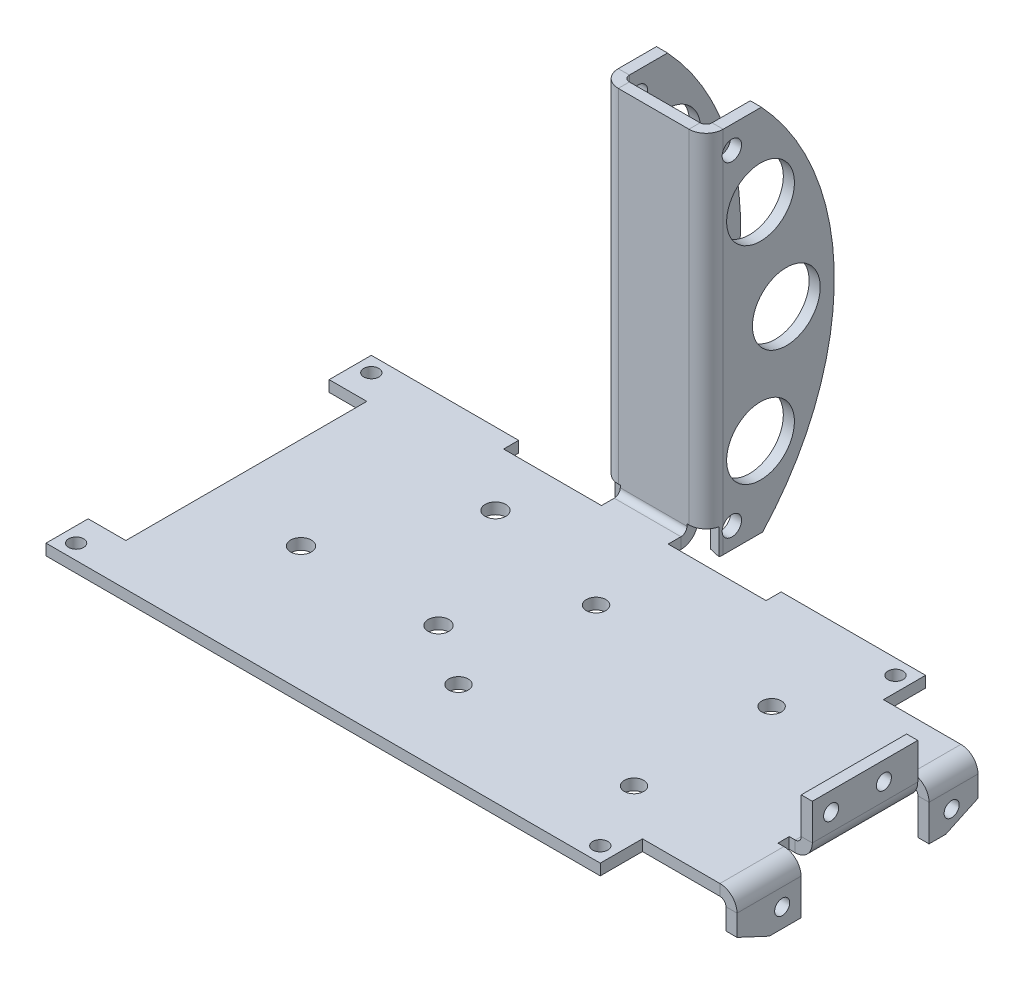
ISO-10303-21;
HEADER;
FILE_DESCRIPTION(('STEP AP214'),'2;1');
FILE_NAME('part.step','',(''),(''),'','','');
FILE_SCHEMA(('AUTOMOTIVE_DESIGN { 1 0 10303 214 1 1 1 1 }'));
ENDSEC;
DATA;
#1=APPLICATION_CONTEXT('core data for automotive mechanical design processes');
#2=APPLICATION_PROTOCOL_DEFINITION('international standard','automotive_design',2000,#1);
#3=PRODUCT_CONTEXT('',#1,'mechanical');
#4=PRODUCT('Part','Part','',(#3));
#5=PRODUCT_RELATED_PRODUCT_CATEGORY('part','',(#4));
#6=PRODUCT_DEFINITION_FORMATION('','',#4);
#7=PRODUCT_DEFINITION_CONTEXT('part definition',#1,'design');
#8=PRODUCT_DEFINITION('design','',#6,#7);
#9=PRODUCT_DEFINITION_SHAPE('','',#8);
#10=(LENGTH_UNIT() NAMED_UNIT(*) SI_UNIT(.MILLI.,.METRE.));
#11=(NAMED_UNIT(*) PLANE_ANGLE_UNIT() SI_UNIT($,.RADIAN.));
#12=(NAMED_UNIT(*) SI_UNIT($,.STERADIAN.) SOLID_ANGLE_UNIT());
#13=UNCERTAINTY_MEASURE_WITH_UNIT(LENGTH_MEASURE(1.E-05),#10,'distance_accuracy_value','');
#14=(GEOMETRIC_REPRESENTATION_CONTEXT(3) GLOBAL_UNCERTAINTY_ASSIGNED_CONTEXT((#13)) GLOBAL_UNIT_ASSIGNED_CONTEXT((#10,
#11,#12)) REPRESENTATION_CONTEXT('',''));
#15=CARTESIAN_POINT('',(0.,0.,0.));
#16=DIRECTION('',(0.,0.,1.));
#17=DIRECTION('',(1.,0.,0.));
#18=AXIS2_PLACEMENT_3D('',#15,#16,#17);
#19=CARTESIAN_POINT('',(69.778625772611,34.9695599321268,-4.95495160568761));
#20=DIRECTION('',(1.,0.,0.));
#21=DIRECTION('',(0.,-1.,0.));
#22=AXIS2_PLACEMENT_3D('',#19,#20,#21);
#23=PLANE('',#22);
#24=CARTESIAN_POINT('',(69.7786257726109,69.1959500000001,-40.5149516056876));
#25=DIRECTION('',(1.,0.,0.));
#26=DIRECTION('',(0.,0.,-1.));
#27=AXIS2_PLACEMENT_3D('',#24,#25,#26);
#28=CIRCLE('',#27,2.04469999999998);
#29=CARTESIAN_POINT('',(69.7786257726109,68.2929841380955,-38.6804351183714));
#30=VERTEX_POINT('',#29);
#31=CARTESIAN_POINT('',(69.7786257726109,70.0989158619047,-38.6804351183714));
#32=VERTEX_POINT('',#31);
#33=EDGE_CURVE('E572',#30,#32,#28,.T.);
#34=ORIENTED_EDGE('',*,*,#33,.F.);
#35=DIRECTION('',(0.,-1.,0.));
#36=VECTOR('',#35,1.);
#37=CARTESIAN_POINT('',(69.7786257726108,34.9695599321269,-38.6804351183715));
#38=LINE('',#37,#36);
#39=CARTESIAN_POINT('',(69.7786257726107,1.55701586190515,-38.6804351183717));
#40=VERTEX_POINT('',#39);
#41=EDGE_CURVE('E579',#30,#40,#38,.T.);
#42=ORIENTED_EDGE('',*,*,#41,.T.);
#43=CARTESIAN_POINT('',(69.7786257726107,0.654050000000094,-40.5149516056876));
#44=DIRECTION('',(1.,0.,0.));
#45=DIRECTION('',(0.,0.,-1.));
#46=AXIS2_PLACEMENT_3D('',#43,#44,#45);
#47=CIRCLE('',#46,2.04469999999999);
#48=CARTESIAN_POINT('',(69.7786257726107,-0.248915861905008,-38.6804351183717));
#49=VERTEX_POINT('',#48);
#50=EDGE_CURVE('E711',#49,#40,#47,.T.);
#51=ORIENTED_EDGE('',*,*,#50,.F.);
#52=CARTESIAN_POINT('',(69.7786257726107,-3.73369006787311,-38.6804351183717));
#53=VERTEX_POINT('',#52);
#54=EDGE_CURVE('E590',#49,#53,#38,.T.);
#55=ORIENTED_EDGE('',*,*,#54,.T.);
#56=DIRECTION('',(0.,0.,-1.));
#57=VECTOR('',#56,1.);
#58=CARTESIAN_POINT('',(69.7786257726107,-3.73369006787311,-38.1305702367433));
#59=LINE('',#58,#57);
#60=CARTESIAN_POINT('',(69.7786257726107,-3.73369006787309,-47.0046952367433));
#61=VERTEX_POINT('',#60);
#62=EDGE_CURVE('E592',#53,#61,#59,.T.);
#63=ORIENTED_EDGE('',*,*,#62,.T.);
#64=CARTESIAN_POINT('',(69.778625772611,34.9695599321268,-4.95495160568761));
#65=DIRECTION('',(1.,0.,0.));
#66=DIRECTION('',(0.,-1.,0.));
#67=AXIS2_PLACEMENT_3D('',#64,#65,#66);
#68=CIRCLE('',#67,57.15);
#69=CARTESIAN_POINT('',(69.7786257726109,73.9673851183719,-46.7316452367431));
#70=VERTEX_POINT('',#69);
#71=EDGE_CURVE('E740',#61,#70,#68,.T.);
#72=ORIENTED_EDGE('',*,*,#71,.T.);
#73=DIRECTION('',(0.,0.,1.));
#74=VECTOR('',#73,1.);
#75=CARTESIAN_POINT('',(69.778625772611,73.9673851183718,-20.3696202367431));
#76=LINE('',#75,#74);
#77=CARTESIAN_POINT('',(69.7786257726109,73.9673851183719,-38.6804351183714));
#78=VERTEX_POINT('',#77);
#79=EDGE_CURVE('E593',#70,#78,#76,.T.);
#80=ORIENTED_EDGE('',*,*,#79,.T.);
#81=EDGE_CURVE('E582',#78,#32,#38,.T.);
#82=ORIENTED_EDGE('',*,*,#81,.T.);
#83=EDGE_LOOP('',(#34,#42,#51,#55,#63,#72,#80,#82));
#84=FACE_BOUND('',#83,.T.);
#85=CARTESIAN_POINT('',(69.7786257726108,56.7246185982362,-46.5553696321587));
#86=DIRECTION('',(1.,0.,0.));
#87=DIRECTION('',(0.,0.,-1.));
#88=AXIS2_PLACEMENT_3D('',#85,#86,#87);
#89=CIRCLE('',#88,7.14375);
#90=CARTESIAN_POINT('',(69.7786257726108,56.7246185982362,-53.6991196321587));
#91=VERTEX_POINT('',#90);
#92=EDGE_CURVE('E628',#91,#91,#89,.F.);
#93=ORIENTED_EDGE('',*,*,#92,.T.);
#94=EDGE_LOOP('',(#93));
#95=FACE_BOUND('',#94,.T.);
#96=CARTESIAN_POINT('',(69.7786257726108,34.9250000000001,-51.990625));
#97=DIRECTION('',(1.,0.,0.));
#98=DIRECTION('',(0.,0.,-1.));
#99=AXIS2_PLACEMENT_3D('',#96,#97,#98);
#100=CIRCLE('',#99,7.14375);
#101=CARTESIAN_POINT('',(69.7786257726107,34.9250000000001,-59.134375));
#102=VERTEX_POINT('',#101);
#103=EDGE_CURVE('E1293',#102,#102,#100,.F.);
#104=ORIENTED_EDGE('',*,*,#103,.T.);
#105=EDGE_LOOP('',(#104));
#106=FACE_BOUND('',#105,.T.);
#107=CARTESIAN_POINT('',(69.7786257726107,13.125381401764,-46.5553696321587));
#108=DIRECTION('',(1.,0.,0.));
#109=DIRECTION('',(0.,0.,-1.));
#110=AXIS2_PLACEMENT_3D('',#107,#108,#109);
#111=CIRCLE('',#110,7.14375);
#112=CARTESIAN_POINT('',(69.7786257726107,13.125381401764,-53.6991196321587));
#113=VERTEX_POINT('',#112);
#114=EDGE_CURVE('E633',#113,#113,#111,.F.);
#115=ORIENTED_EDGE('',*,*,#114,.T.);
#116=EDGE_LOOP('',(#115));
#117=FACE_BOUND('',#116,.T.);
#118=ADVANCED_FACE('F130',(#84,#95,#106,#117),#23,.T.);
#119=CARTESIAN_POINT('',(67.4418257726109,34.9695599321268,-4.9549516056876));
#120=DIRECTION('',(1.,0.,0.));
#121=DIRECTION('',(0.,-1.,0.));
#122=AXIS2_PLACEMENT_3D('',#119,#120,#121);
#123=PLANE('',#122);
#124=CARTESIAN_POINT('',(67.4418257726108,56.7246185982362,-46.5553696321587));
#125=DIRECTION('',(1.,0.,0.));
#126=DIRECTION('',(0.,0.,-1.));
#127=AXIS2_PLACEMENT_3D('',#124,#125,#126);
#128=CIRCLE('',#127,7.14375);
#129=CARTESIAN_POINT('',(67.4418257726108,56.7246185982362,-53.6991196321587));
#130=VERTEX_POINT('',#129);
#131=EDGE_CURVE('E1303',#130,#130,#128,.F.);
#132=ORIENTED_EDGE('',*,*,#131,.F.);
#133=EDGE_LOOP('',(#132));
#134=FACE_BOUND('',#133,.T.);
#135=DIRECTION('',(0.,-1.,0.));
#136=VECTOR('',#135,1.);
#137=CARTESIAN_POINT('',(67.4418257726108,34.9695599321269,-38.6804351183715));
#138=LINE('',#137,#136);
#139=CARTESIAN_POINT('',(67.4418257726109,68.2929841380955,-38.6804351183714));
#140=VERTEX_POINT('',#139);
#141=CARTESIAN_POINT('',(67.4418257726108,1.55701586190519,-38.6804351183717));
#142=VERTEX_POINT('',#141);
#143=EDGE_CURVE('E613',#140,#142,#138,.T.);
#144=ORIENTED_EDGE('',*,*,#143,.F.);
#145=CARTESIAN_POINT('',(67.4418257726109,69.1959500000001,-40.5149516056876));
#146=DIRECTION('',(1.,0.,0.));
#147=DIRECTION('',(0.,0.,-1.));
#148=AXIS2_PLACEMENT_3D('',#145,#146,#147);
#149=CIRCLE('',#148,2.04469999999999);
#150=CARTESIAN_POINT('',(67.4418257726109,70.0989158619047,-38.6804351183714));
#151=VERTEX_POINT('',#150);
#152=EDGE_CURVE('E149',#140,#151,#149,.T.);
#153=ORIENTED_EDGE('',*,*,#152,.T.);
#154=CARTESIAN_POINT('',(67.4418257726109,73.9673851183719,-38.6804351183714));
#155=VERTEX_POINT('',#154);
#156=EDGE_CURVE('E610',#155,#151,#138,.T.);
#157=ORIENTED_EDGE('',*,*,#156,.F.);
#158=DIRECTION('',(0.,0.,1.));
#159=VECTOR('',#158,1.);
#160=CARTESIAN_POINT('',(67.4418257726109,73.9673851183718,-34.4285202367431));
#161=LINE('',#160,#159);
#162=CARTESIAN_POINT('',(67.4418257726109,73.9673851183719,-46.7316452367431));
#163=VERTEX_POINT('',#162);
#164=EDGE_CURVE('E601',#163,#155,#161,.T.);
#165=ORIENTED_EDGE('',*,*,#164,.F.);
#166=CARTESIAN_POINT('',(67.4418257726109,34.9695599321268,-4.9549516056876));
#167=DIRECTION('',(1.,0.,0.));
#168=DIRECTION('',(0.,-1.,0.));
#169=AXIS2_PLACEMENT_3D('',#166,#167,#168);
#170=CIRCLE('',#169,57.15);
#171=CARTESIAN_POINT('',(67.4418257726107,-3.73369006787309,-47.0046952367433));
#172=VERTEX_POINT('',#171);
#173=EDGE_CURVE('E607',#172,#163,#170,.T.);
#174=ORIENTED_EDGE('',*,*,#173,.F.);
#175=DIRECTION('',(0.,0.,-1.));
#176=VECTOR('',#175,1.);
#177=CARTESIAN_POINT('',(67.4418257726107,-3.73369006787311,-38.1305702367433));
#178=LINE('',#177,#176);
#179=CARTESIAN_POINT('',(67.4418257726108,-3.73369006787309,-38.6804351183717));
#180=VERTEX_POINT('',#179);
#181=EDGE_CURVE('E739',#180,#172,#178,.T.);
#182=ORIENTED_EDGE('',*,*,#181,.F.);
#183=CARTESIAN_POINT('',(67.4418257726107,-0.248915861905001,-38.6804351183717));
#184=VERTEX_POINT('',#183);
#185=EDGE_CURVE('E614',#184,#180,#138,.T.);
#186=ORIENTED_EDGE('',*,*,#185,.F.);
#187=CARTESIAN_POINT('',(67.4418257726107,0.654050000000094,-40.5149516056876));
#188=DIRECTION('',(1.,0.,0.));
#189=DIRECTION('',(0.,0.,-1.));
#190=AXIS2_PLACEMENT_3D('',#187,#188,#189);
#191=CIRCLE('',#190,2.04469999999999);
#192=EDGE_CURVE('E712',#184,#142,#191,.T.);
#193=ORIENTED_EDGE('',*,*,#192,.T.);
#194=EDGE_LOOP('',(#144,#153,#157,#165,#174,#182,#186,#193));
#195=FACE_BOUND('',#194,.T.);
#196=CARTESIAN_POINT('',(67.4418257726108,34.9250000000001,-51.990625));
#197=DIRECTION('',(1.,0.,0.));
#198=DIRECTION('',(0.,0.,-1.));
#199=AXIS2_PLACEMENT_3D('',#196,#197,#198);
#200=CIRCLE('',#199,7.14375);
#201=CARTESIAN_POINT('',(67.4418257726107,34.9250000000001,-59.134375));
#202=VERTEX_POINT('',#201);
#203=EDGE_CURVE('E1296',#202,#202,#200,.F.);
#204=ORIENTED_EDGE('',*,*,#203,.F.);
#205=EDGE_LOOP('',(#204));
#206=FACE_BOUND('',#205,.T.);
#207=CARTESIAN_POINT('',(67.4418257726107,13.125381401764,-46.5553696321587));
#208=DIRECTION('',(1.,0.,0.));
#209=DIRECTION('',(0.,0.,-1.));
#210=AXIS2_PLACEMENT_3D('',#207,#208,#209);
#211=CIRCLE('',#210,7.14375);
#212=CARTESIAN_POINT('',(67.4418257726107,13.125381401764,-53.6991196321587));
#213=VERTEX_POINT('',#212);
#214=EDGE_CURVE('E1310',#213,#213,#211,.F.);
#215=ORIENTED_EDGE('',*,*,#214,.F.);
#216=EDGE_LOOP('',(#215));
#217=FACE_BOUND('',#216,.T.);
#218=ADVANCED_FACE('F132',(#134,#195,#206,#217),#123,.F.);
#219=CARTESIAN_POINT('',(47.6627555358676,34.9695599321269,-49.8431888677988));
#220=DIRECTION('',(-1.,0.,0.));
#221=DIRECTION('',(0.,-1.,0.));
#222=AXIS2_PLACEMENT_3D('',#219,#220,#221);
#223=PLANE('',#222);
#224=CARTESIAN_POINT('',(47.6627555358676,69.1959500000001,-40.5149516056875));
#225=DIRECTION('',(-1.,0.,0.));
#226=DIRECTION('',(0.,0.,1.));
#227=AXIS2_PLACEMENT_3D('',#224,#225,#226);
#228=CIRCLE('',#227,2.04469999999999);
#229=CARTESIAN_POINT('',(47.6627555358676,70.0989158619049,-38.6804351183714));
#230=VERTEX_POINT('',#229);
#231=CARTESIAN_POINT('',(47.6627555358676,68.2929841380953,-38.6804351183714));
#232=VERTEX_POINT('',#231);
#233=EDGE_CURVE('E156',#230,#232,#228,.T.);
#234=ORIENTED_EDGE('',*,*,#233,.F.);
#235=DIRECTION('',(0.,1.,0.));
#236=VECTOR('',#235,1.);
#237=CARTESIAN_POINT('',(47.6627555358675,34.9695599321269,-38.6804351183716));
#238=LINE('',#237,#236);
#239=CARTESIAN_POINT('',(47.6627555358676,73.9673851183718,-38.6804351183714));
#240=VERTEX_POINT('',#239);
#241=EDGE_CURVE('E778',#230,#240,#238,.T.);
#242=ORIENTED_EDGE('',*,*,#241,.T.);
#243=DIRECTION('',(0.,0.,-1.));
#244=VECTOR('',#243,1.);
#245=CARTESIAN_POINT('',(47.6627555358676,73.9673851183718,-34.4285202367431));
#246=LINE('',#245,#244);
#247=CARTESIAN_POINT('',(47.6627555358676,73.9673851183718,-46.7316452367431));
#248=VERTEX_POINT('',#247);
#249=EDGE_CURVE('E782',#240,#248,#246,.T.);
#250=ORIENTED_EDGE('',*,*,#249,.T.);
#251=CARTESIAN_POINT('',(47.6627555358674,34.9661347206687,-4.95814924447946));
#252=DIRECTION('',(-1.,0.,0.));
#253=DIRECTION('',(0.,-1.,0.));
#254=AXIS2_PLACEMENT_3D('',#251,#252,#253);
#255=CIRCLE('',#254,57.15);
#256=CARTESIAN_POINT('',(47.6627555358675,-3.73369006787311,-47.0110452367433));
#257=VERTEX_POINT('',#256);
#258=EDGE_CURVE('E785',#248,#257,#255,.T.);
#259=ORIENTED_EDGE('',*,*,#258,.T.);
#260=DIRECTION('',(0.,0.,1.));
#261=VECTOR('',#260,1.);
#262=CARTESIAN_POINT('',(47.6627555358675,-3.73369006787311,-47.0110452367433));
#263=LINE('',#262,#261);
#264=CARTESIAN_POINT('',(47.6627555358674,-3.73369006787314,-38.6804351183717));
#265=VERTEX_POINT('',#264);
#266=EDGE_CURVE('E775',#257,#265,#263,.T.);
#267=ORIENTED_EDGE('',*,*,#266,.T.);
#268=CARTESIAN_POINT('',(47.6627555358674,-0.24891586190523,-38.6804351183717));
#269=VERTEX_POINT('',#268);
#270=EDGE_CURVE('E779',#265,#269,#238,.T.);
#271=ORIENTED_EDGE('',*,*,#270,.T.);
#272=CARTESIAN_POINT('',(47.6627555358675,0.654050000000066,-40.5149516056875));
#273=DIRECTION('',(-1.,0.,0.));
#274=DIRECTION('',(0.,0.,1.));
#275=AXIS2_PLACEMENT_3D('',#272,#273,#274);
#276=CIRCLE('',#275,2.04469999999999);
#277=CARTESIAN_POINT('',(47.6627555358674,1.55701586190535,-38.6804351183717));
#278=VERTEX_POINT('',#277);
#279=EDGE_CURVE('E1338',#278,#269,#276,.T.);
#280=ORIENTED_EDGE('',*,*,#279,.F.);
#281=EDGE_CURVE('E783',#278,#232,#238,.T.);
#282=ORIENTED_EDGE('',*,*,#281,.T.);
#283=EDGE_LOOP('',(#234,#242,#250,#259,#267,#271,#280,#282));
#284=FACE_BOUND('',#283,.T.);
#285=CARTESIAN_POINT('',(47.6627555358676,56.7246185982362,-46.5553696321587));
#286=DIRECTION('',(-1.,0.,0.));
#287=DIRECTION('',(0.,0.,1.));
#288=AXIS2_PLACEMENT_3D('',#285,#286,#287);
#289=CIRCLE('',#288,7.14375);
#290=CARTESIAN_POINT('',(47.6627555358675,56.7246185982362,-39.4116196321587));
#291=VERTEX_POINT('',#290);
#292=EDGE_CURVE('E632',#291,#291,#289,.F.);
#293=ORIENTED_EDGE('',*,*,#292,.T.);
#294=EDGE_LOOP('',(#293));
#295=FACE_BOUND('',#294,.T.);
#296=CARTESIAN_POINT('',(47.6627555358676,34.9250000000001,-51.990625));
#297=DIRECTION('',(-1.,0.,0.));
#298=DIRECTION('',(0.,0.,1.));
#299=AXIS2_PLACEMENT_3D('',#296,#297,#298);
#300=CIRCLE('',#299,7.14375);
#301=CARTESIAN_POINT('',(47.6627555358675,34.9250000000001,-44.846875));
#302=VERTEX_POINT('',#301);
#303=EDGE_CURVE('E627',#302,#302,#300,.F.);
#304=ORIENTED_EDGE('',*,*,#303,.T.);
#305=EDGE_LOOP('',(#304));
#306=FACE_BOUND('',#305,.T.);
#307=CARTESIAN_POINT('',(47.6627555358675,13.1253814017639,-46.5553696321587));
#308=DIRECTION('',(-1.,0.,0.));
#309=DIRECTION('',(0.,0.,1.));
#310=AXIS2_PLACEMENT_3D('',#307,#308,#309);
#311=CIRCLE('',#310,7.14375);
#312=CARTESIAN_POINT('',(47.6627555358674,13.1253814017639,-39.4116196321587));
#313=VERTEX_POINT('',#312);
#314=EDGE_CURVE('E636',#313,#313,#311,.F.);
#315=ORIENTED_EDGE('',*,*,#314,.T.);
#316=EDGE_LOOP('',(#315));
#317=FACE_BOUND('',#316,.T.);
#318=ADVANCED_FACE('F1365',(#284,#295,#306,#317),#223,.T.);
#319=CARTESIAN_POINT('',(49.9995555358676,34.9695599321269,-49.8431888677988));
#320=DIRECTION('',(-1.,0.,0.));
#321=DIRECTION('',(0.,-1.,0.));
#322=AXIS2_PLACEMENT_3D('',#319,#320,#321);
#323=PLANE('',#322);
#324=CARTESIAN_POINT('',(49.9995555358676,56.7246185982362,-46.5553696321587));
#325=DIRECTION('',(-1.,0.,0.));
#326=DIRECTION('',(0.,0.,1.));
#327=AXIS2_PLACEMENT_3D('',#324,#325,#326);
#328=CIRCLE('',#327,7.14375);
#329=CARTESIAN_POINT('',(49.9995555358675,56.7246185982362,-39.4116196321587));
#330=VERTEX_POINT('',#329);
#331=EDGE_CURVE('E629',#330,#330,#328,.F.);
#332=ORIENTED_EDGE('',*,*,#331,.F.);
#333=EDGE_LOOP('',(#332));
#334=FACE_BOUND('',#333,.T.);
#335=DIRECTION('',(0.,1.,0.));
#336=VECTOR('',#335,1.);
#337=CARTESIAN_POINT('',(49.9995555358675,34.9695599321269,-38.6804351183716));
#338=LINE('',#337,#336);
#339=CARTESIAN_POINT('',(49.9995555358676,70.0989158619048,-38.6804351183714));
#340=VERTEX_POINT('',#339);
#341=CARTESIAN_POINT('',(49.9995555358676,73.9673851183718,-38.6804351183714));
#342=VERTEX_POINT('',#341);
#343=EDGE_CURVE('E764',#340,#342,#338,.T.);
#344=ORIENTED_EDGE('',*,*,#343,.F.);
#345=CARTESIAN_POINT('',(49.9995555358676,69.1959500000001,-40.5149516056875));
#346=DIRECTION('',(-1.,0.,0.));
#347=DIRECTION('',(0.,0.,1.));
#348=AXIS2_PLACEMENT_3D('',#345,#346,#347);
#349=CIRCLE('',#348,2.04469999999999);
#350=CARTESIAN_POINT('',(49.9995555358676,68.2929841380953,-38.6804351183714));
#351=VERTEX_POINT('',#350);
#352=EDGE_CURVE('E695',#340,#351,#349,.T.);
#353=ORIENTED_EDGE('',*,*,#352,.T.);
#354=CARTESIAN_POINT('',(49.9995555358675,1.55701586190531,-38.6804351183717));
#355=VERTEX_POINT('',#354);
#356=EDGE_CURVE('E763',#355,#351,#338,.T.);
#357=ORIENTED_EDGE('',*,*,#356,.F.);
#358=CARTESIAN_POINT('',(49.9995555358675,0.654050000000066,-40.5149516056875));
#359=DIRECTION('',(-1.,0.,0.));
#360=DIRECTION('',(0.,0.,1.));
#361=AXIS2_PLACEMENT_3D('',#358,#359,#360);
#362=CIRCLE('',#361,2.04469999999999);
#363=CARTESIAN_POINT('',(49.9995555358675,-0.248915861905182,-38.6804351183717));
#364=VERTEX_POINT('',#363);
#365=EDGE_CURVE('E675',#355,#364,#362,.T.);
#366=ORIENTED_EDGE('',*,*,#365,.T.);
#367=CARTESIAN_POINT('',(49.9995555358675,-3.73369006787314,-38.6804351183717));
#368=VERTEX_POINT('',#367);
#369=EDGE_CURVE('E759',#368,#364,#338,.T.);
#370=ORIENTED_EDGE('',*,*,#369,.F.);
#371=DIRECTION('',(0.,0.,1.));
#372=VECTOR('',#371,1.);
#373=CARTESIAN_POINT('',(49.9995555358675,-3.73369006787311,-47.0110452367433));
#374=LINE('',#373,#372);
#375=CARTESIAN_POINT('',(49.9995555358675,-3.73369006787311,-47.0110452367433));
#376=VERTEX_POINT('',#375);
#377=EDGE_CURVE('E769',#376,#368,#374,.T.);
#378=ORIENTED_EDGE('',*,*,#377,.F.);
#379=CARTESIAN_POINT('',(49.9995555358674,34.9661347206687,-4.95814924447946));
#380=DIRECTION('',(-1.,0.,0.));
#381=DIRECTION('',(0.,-1.,0.));
#382=AXIS2_PLACEMENT_3D('',#379,#380,#381);
#383=CIRCLE('',#382,57.15);
#384=CARTESIAN_POINT('',(49.9995555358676,73.9673851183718,-46.7316452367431));
#385=VERTEX_POINT('',#384);
#386=EDGE_CURVE('E762',#385,#376,#383,.T.);
#387=ORIENTED_EDGE('',*,*,#386,.F.);
#388=DIRECTION('',(0.,0.,-1.));
#389=VECTOR('',#388,1.);
#390=CARTESIAN_POINT('',(49.9995555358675,73.9673851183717,-20.3696202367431));
#391=LINE('',#390,#389);
#392=EDGE_CURVE('E791',#342,#385,#391,.T.);
#393=ORIENTED_EDGE('',*,*,#392,.F.);
#394=EDGE_LOOP('',(#344,#353,#357,#366,#370,#378,#387,#393));
#395=FACE_BOUND('',#394,.T.);
#396=CARTESIAN_POINT('',(49.9995555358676,34.9250000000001,-51.990625));
#397=DIRECTION('',(-1.,0.,0.));
#398=DIRECTION('',(0.,0.,1.));
#399=AXIS2_PLACEMENT_3D('',#396,#397,#398);
#400=CIRCLE('',#399,7.14375);
#401=CARTESIAN_POINT('',(49.9995555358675,34.9250000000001,-44.846875));
#402=VERTEX_POINT('',#401);
#403=EDGE_CURVE('E624',#402,#402,#400,.F.);
#404=ORIENTED_EDGE('',*,*,#403,.F.);
#405=EDGE_LOOP('',(#404));
#406=FACE_BOUND('',#405,.T.);
#407=CARTESIAN_POINT('',(49.9995555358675,13.1253814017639,-46.5553696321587));
#408=DIRECTION('',(-1.,0.,0.));
#409=DIRECTION('',(0.,0.,1.));
#410=AXIS2_PLACEMENT_3D('',#407,#408,#409);
#411=CIRCLE('',#410,7.14375);
#412=CARTESIAN_POINT('',(49.9995555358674,13.1253814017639,-39.4116196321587));
#413=VERTEX_POINT('',#412);
#414=EDGE_CURVE('E634',#413,#413,#411,.F.);
#415=ORIENTED_EDGE('',*,*,#414,.F.);
#416=EDGE_LOOP('',(#415));
#417=FACE_BOUND('',#416,.T.);
#418=ADVANCED_FACE('F1350',(#334,#395,#406,#417),#323,.F.);
#419=CARTESIAN_POINT('',(67.4418257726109,34.9695599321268,-4.9549516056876));
#420=DIRECTION('',(1.,0.,0.));
#421=DIRECTION('',(0.,-1.,0.));
#422=AXIS2_PLACEMENT_3D('',#419,#420,#421);
#423=CYLINDRICAL_SURFACE('',#422,57.15);
#424=ORIENTED_EDGE('',*,*,#71,.F.);
#425=DIRECTION('',(1.,0.,0.));
#426=VECTOR('',#425,1.);
#427=CARTESIAN_POINT('',(67.4418257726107,-3.73369006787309,-47.0046952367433));
#428=LINE('',#427,#426);
#429=EDGE_CURVE('E644',#172,#61,#428,.T.);
#430=ORIENTED_EDGE('',*,*,#429,.F.);
#431=ORIENTED_EDGE('',*,*,#173,.T.);
#432=DIRECTION('',(1.,0.,0.));
#433=VECTOR('',#432,1.);
#434=CARTESIAN_POINT('',(67.4418257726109,73.9673851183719,-46.7316452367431));
#435=LINE('',#434,#433);
#436=EDGE_CURVE('E604',#163,#70,#435,.T.);
#437=ORIENTED_EDGE('',*,*,#436,.T.);
#438=EDGE_LOOP('',(#424,#430,#431,#437));
#439=FACE_BOUND('',#438,.T.);
#440=ADVANCED_FACE('F1408',(#439),#423,.T.);
#441=CARTESIAN_POINT('',(67.441825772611,73.9673851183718,-20.369620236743));
#442=DIRECTION('',(0.,1.,0.));
#443=DIRECTION('',(0.,0.,1.));
#444=AXIS2_PLACEMENT_3D('',#441,#442,#443);
#445=PLANE('',#444);
#446=ORIENTED_EDGE('',*,*,#164,.T.);
#447=DIRECTION('',(1.,0.,0.));
#448=VECTOR('',#447,1.);
#449=CARTESIAN_POINT('',(67.4418257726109,73.9673851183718,-38.6804351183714));
#450=LINE('',#449,#448);
#451=EDGE_CURVE('E598',#155,#78,#450,.T.);
#452=ORIENTED_EDGE('',*,*,#451,.T.);
#453=ORIENTED_EDGE('',*,*,#79,.F.);
#454=ORIENTED_EDGE('',*,*,#436,.F.);
#455=EDGE_LOOP('',(#446,#452,#453,#454));
#456=FACE_BOUND('',#455,.T.);
#457=ADVANCED_FACE('F1400',(#456),#445,.T.);
#458=CARTESIAN_POINT('',(67.4418257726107,-3.73369006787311,-38.1305702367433));
#459=DIRECTION('',(0.,-1.,0.));
#460=DIRECTION('',(0.,0.,-1.));
#461=AXIS2_PLACEMENT_3D('',#458,#459,#460);
#462=PLANE('',#461);
#463=ORIENTED_EDGE('',*,*,#62,.F.);
#464=DIRECTION('',(-1.,0.,0.));
#465=VECTOR('',#464,1.);
#466=CARTESIAN_POINT('',(67.4418257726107,-3.73369006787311,-38.6804351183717));
#467=LINE('',#466,#465);
#468=EDGE_CURVE('E732',#53,#180,#467,.T.);
#469=ORIENTED_EDGE('',*,*,#468,.T.);
#470=ORIENTED_EDGE('',*,*,#181,.T.);
#471=ORIENTED_EDGE('',*,*,#429,.T.);
#472=EDGE_LOOP('',(#463,#469,#470,#471));
#473=FACE_BOUND('',#472,.T.);
#474=ADVANCED_FACE('F743',(#473),#462,.T.);
#475=CARTESIAN_POINT('',(49.9995555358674,34.9661347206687,-4.95814924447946));
#476=DIRECTION('',(-1.,0.,0.));
#477=DIRECTION('',(0.,-1.,0.));
#478=AXIS2_PLACEMENT_3D('',#475,#476,#477);
#479=CYLINDRICAL_SURFACE('',#478,57.15);
#480=ORIENTED_EDGE('',*,*,#258,.F.);
#481=DIRECTION('',(-1.,0.,0.));
#482=VECTOR('',#481,1.);
#483=CARTESIAN_POINT('',(49.9995555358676,73.9673851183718,-46.7316452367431));
#484=LINE('',#483,#482);
#485=EDGE_CURVE('E793',#385,#248,#484,.T.);
#486=ORIENTED_EDGE('',*,*,#485,.F.);
#487=ORIENTED_EDGE('',*,*,#386,.T.);
#488=DIRECTION('',(-1.,0.,0.));
#489=VECTOR('',#488,1.);
#490=CARTESIAN_POINT('',(49.9995555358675,-3.73369006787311,-47.0110452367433));
#491=LINE('',#490,#489);
#492=EDGE_CURVE('E767',#376,#257,#491,.T.);
#493=ORIENTED_EDGE('',*,*,#492,.T.);
#494=EDGE_LOOP('',(#480,#486,#487,#493));
#495=FACE_BOUND('',#494,.T.);
#496=ADVANCED_FACE('F1371',(#495),#479,.T.);
#497=CARTESIAN_POINT('',(49.9995555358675,-3.73369006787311,-47.0110452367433));
#498=DIRECTION('',(0.,-1.,0.));
#499=DIRECTION('',(0.,0.,1.));
#500=AXIS2_PLACEMENT_3D('',#497,#498,#499);
#501=PLANE('',#500);
#502=ORIENTED_EDGE('',*,*,#377,.T.);
#503=DIRECTION('',(-1.,0.,0.));
#504=VECTOR('',#503,1.);
#505=CARTESIAN_POINT('',(49.9995555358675,-3.73369006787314,-38.6804351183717));
#506=LINE('',#505,#504);
#507=EDGE_CURVE('E772',#368,#265,#506,.T.);
#508=ORIENTED_EDGE('',*,*,#507,.T.);
#509=ORIENTED_EDGE('',*,*,#266,.F.);
#510=ORIENTED_EDGE('',*,*,#492,.F.);
#511=EDGE_LOOP('',(#502,#508,#509,#510));
#512=FACE_BOUND('',#511,.T.);
#513=ADVANCED_FACE('F1363',(#512),#501,.T.);
#514=CARTESIAN_POINT('',(49.9995555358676,73.9673851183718,-34.4285202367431));
#515=DIRECTION('',(0.,1.,0.));
#516=DIRECTION('',(0.,0.,-1.));
#517=AXIS2_PLACEMENT_3D('',#514,#515,#516);
#518=PLANE('',#517);
#519=ORIENTED_EDGE('',*,*,#249,.F.);
#520=DIRECTION('',(1.,0.,0.));
#521=VECTOR('',#520,1.);
#522=CARTESIAN_POINT('',(49.9995555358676,73.9673851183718,-38.6804351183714));
#523=LINE('',#522,#521);
#524=EDGE_CURVE('E788',#240,#342,#523,.T.);
#525=ORIENTED_EDGE('',*,*,#524,.T.);
#526=ORIENTED_EDGE('',*,*,#392,.T.);
#527=ORIENTED_EDGE('',*,*,#485,.T.);
#528=EDGE_LOOP('',(#519,#525,#526,#527));
#529=FACE_BOUND('',#528,.T.);
#530=ADVANCED_FACE('F1375',(#529),#518,.T.);
#531=CARTESIAN_POINT('',(51.6912406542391,1.73613511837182,-37.4104351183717));
#532=DIRECTION('',(0.,-1.,0.));
#533=DIRECTION('',(1.,0.,0.));
#534=AXIS2_PLACEMENT_3D('',#531,#532,#533);
#535=PLANE('',#534);
#536=DIRECTION('',(0.,0.,1.));
#537=VECTOR('',#536,1.);
#538=CARTESIAN_POINT('',(51.2695555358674,1.7361351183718,-37.4104351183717));
#539=LINE('',#538,#537);
#540=CARTESIAN_POINT('',(51.2695555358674,1.7361351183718,-37.4104351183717));
#541=VERTEX_POINT('',#540);
#542=CARTESIAN_POINT('',(51.2695555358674,1.73613511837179,-35.0736351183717));
#543=VERTEX_POINT('',#542);
#544=EDGE_CURVE('E799',#541,#543,#539,.T.);
#545=ORIENTED_EDGE('',*,*,#544,.F.);
#546=DIRECTION('',(1.,0.,0.));
#547=VECTOR('',#546,1.);
#548=CARTESIAN_POINT('',(51.6912406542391,1.73613511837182,-37.4104351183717));
#549=LINE('',#548,#547);
#550=CARTESIAN_POINT('',(51.6912406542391,1.73613511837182,-37.4104351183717));
#551=VERTEX_POINT('',#550);
#552=EDGE_CURVE('E818',#541,#551,#549,.T.);
#553=ORIENTED_EDGE('',*,*,#552,.T.);
#554=DIRECTION('',(0.,0.,1.));
#555=VECTOR('',#554,1.);
#556=CARTESIAN_POINT('',(51.6912406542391,1.73613511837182,-37.4104351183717));
#557=LINE('',#556,#555);
#558=CARTESIAN_POINT('',(51.6912406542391,1.73613511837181,-35.0736351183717));
#559=VERTEX_POINT('',#558);
#560=EDGE_CURVE('E754',#551,#559,#557,.T.);
#561=ORIENTED_EDGE('',*,*,#560,.T.);
#562=DIRECTION('',(1.,0.,0.));
#563=VECTOR('',#562,1.);
#564=CARTESIAN_POINT('',(51.6912406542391,1.73613511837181,-35.0736351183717));
#565=LINE('',#564,#563);
#566=EDGE_CURVE('E757',#543,#559,#565,.T.);
#567=ORIENTED_EDGE('',*,*,#566,.F.);
#568=EDGE_LOOP('',(#545,#553,#561,#567));
#569=FACE_BOUND('',#568,.T.);
#570=ADVANCED_FACE('F1631',(#569),#535,.T.);
#571=CARTESIAN_POINT('',(51.6912406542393,73.9673851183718,-37.4104351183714));
#572=DIRECTION('',(0.,1.,0.));
#573=DIRECTION('',(-1.,0.,0.));
#574=AXIS2_PLACEMENT_3D('',#571,#572,#573);
#575=PLANE('',#574);
#576=DIRECTION('',(0.,0.,1.));
#577=VECTOR('',#576,1.);
#578=CARTESIAN_POINT('',(66.1718257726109,73.9673851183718,-37.4104351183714));
#579=LINE('',#578,#577);
#580=CARTESIAN_POINT('',(66.1718257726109,73.9673851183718,-37.4104351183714));
#581=VERTEX_POINT('',#580);
#582=CARTESIAN_POINT('',(66.1718257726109,73.9673851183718,-35.0736351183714));
#583=VERTEX_POINT('',#582);
#584=EDGE_CURVE('E806',#581,#583,#579,.T.);
#585=ORIENTED_EDGE('',*,*,#584,.F.);
#586=DIRECTION('',(-1.,0.,0.));
#587=VECTOR('',#586,1.);
#588=CARTESIAN_POINT('',(65.7501406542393,73.9673851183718,-37.4104351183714));
#589=LINE('',#588,#587);
#590=CARTESIAN_POINT('',(51.2695555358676,73.9673851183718,-37.4104351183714));
#591=VERTEX_POINT('',#590);
#592=EDGE_CURVE('E750',#581,#591,#589,.T.);
#593=ORIENTED_EDGE('',*,*,#592,.T.);
#594=DIRECTION('',(0.,0.,-1.));
#595=VECTOR('',#594,1.);
#596=CARTESIAN_POINT('',(51.2695555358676,73.9673851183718,-37.4104351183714));
#597=LINE('',#596,#595);
#598=CARTESIAN_POINT('',(51.2695555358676,73.9673851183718,-35.0736351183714));
#599=VERTEX_POINT('',#598);
#600=EDGE_CURVE('E803',#599,#591,#597,.T.);
#601=ORIENTED_EDGE('',*,*,#600,.F.);
#602=DIRECTION('',(-1.,0.,0.));
#603=VECTOR('',#602,1.);
#604=CARTESIAN_POINT('',(51.6912406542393,73.9673851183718,-35.0736351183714));
#605=LINE('',#604,#603);
#606=EDGE_CURVE('E755',#583,#599,#605,.T.);
#607=ORIENTED_EDGE('',*,*,#606,.F.);
#608=EDGE_LOOP('',(#585,#593,#601,#607));
#609=FACE_BOUND('',#608,.T.);
#610=ADVANCED_FACE('F1634',(#609),#575,.T.);
#611=CARTESIAN_POINT('',(65.7501406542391,1.73613511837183,-37.4104351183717));
#612=DIRECTION('',(0.,-1.,0.));
#613=DIRECTION('',(1.,0.,0.));
#614=AXIS2_PLACEMENT_3D('',#611,#612,#613);
#615=PLANE('',#614);
#616=DIRECTION('',(0.,0.,-1.));
#617=VECTOR('',#616,1.);
#618=CARTESIAN_POINT('',(66.1718257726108,1.73613511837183,-37.4104351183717));
#619=LINE('',#618,#617);
#620=CARTESIAN_POINT('',(66.1718257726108,1.73613511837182,-35.0736351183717));
#621=VERTEX_POINT('',#620);
#622=CARTESIAN_POINT('',(66.1718257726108,1.7361351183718,-37.4104351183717));
#623=VERTEX_POINT('',#622);
#624=EDGE_CURVE('E809',#621,#623,#619,.T.);
#625=ORIENTED_EDGE('',*,*,#624,.F.);
#626=DIRECTION('',(1.,0.,0.));
#627=VECTOR('',#626,1.);
#628=CARTESIAN_POINT('',(65.7501406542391,1.73613511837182,-35.0736351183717));
#629=LINE('',#628,#627);
#630=CARTESIAN_POINT('',(65.7501406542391,1.73613511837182,-35.0736351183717));
#631=VERTEX_POINT('',#630);
#632=EDGE_CURVE('E848',#631,#621,#629,.T.);
#633=ORIENTED_EDGE('',*,*,#632,.F.);
#634=DIRECTION('',(0.,0.,1.));
#635=VECTOR('',#634,1.);
#636=CARTESIAN_POINT('',(65.7501406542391,1.73613511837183,-37.4104351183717));
#637=LINE('',#636,#635);
#638=CARTESIAN_POINT('',(65.7501406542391,1.73613511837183,-37.4104351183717));
#639=VERTEX_POINT('',#638);
#640=EDGE_CURVE('E828',#639,#631,#637,.T.);
#641=ORIENTED_EDGE('',*,*,#640,.F.);
#642=DIRECTION('',(1.,0.,0.));
#643=VECTOR('',#642,1.);
#644=CARTESIAN_POINT('',(65.7501406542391,1.73613511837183,-37.4104351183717));
#645=LINE('',#644,#643);
#646=EDGE_CURVE('E753',#639,#623,#645,.T.);
#647=ORIENTED_EDGE('',*,*,#646,.T.);
#648=EDGE_LOOP('',(#625,#633,#641,#647));
#649=FACE_BOUND('',#648,.T.);
#650=ADVANCED_FACE('F1636',(#649),#615,.T.);
#651=CARTESIAN_POINT('',(65.7501406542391,-5.24886488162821,-37.4104351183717));
#652=DIRECTION('',(1.,0.,0.));
#653=DIRECTION('',(0.,1.,0.));
#654=AXIS2_PLACEMENT_3D('',#651,#652,#653);
#655=PLANE('',#654);
#656=DIRECTION('',(0.,1.,0.));
#657=VECTOR('',#656,1.);
#658=CARTESIAN_POINT('',(65.7501406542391,-5.24886488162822,-35.0736351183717));
#659=LINE('',#658,#657);
#660=CARTESIAN_POINT('',(65.7501406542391,1.27000000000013,-35.0736351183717));
#661=VERTEX_POINT('',#660);
#662=EDGE_CURVE('E846',#661,#631,#659,.T.);
#663=ORIENTED_EDGE('',*,*,#662,.F.);
#664=DIRECTION('',(0.,0.,-1.));
#665=VECTOR('',#664,1.);
#666=CARTESIAN_POINT('',(65.7501406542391,1.27000000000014,-37.4104351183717));
#667=LINE('',#666,#665);
#668=CARTESIAN_POINT('',(65.7501406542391,1.27000000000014,-37.4104351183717));
#669=VERTEX_POINT('',#668);
#670=EDGE_CURVE('E823',#661,#669,#667,.T.);
#671=ORIENTED_EDGE('',*,*,#670,.T.);
#672=DIRECTION('',(0.,1.,0.));
#673=VECTOR('',#672,1.);
#674=CARTESIAN_POINT('',(65.7501406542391,-5.24886488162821,-37.4104351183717));
#675=LINE('',#674,#673);
#676=EDGE_CURVE('E826',#669,#639,#675,.T.);
#677=ORIENTED_EDGE('',*,*,#676,.T.);
#678=ORIENTED_EDGE('',*,*,#640,.T.);
#679=EDGE_LOOP('',(#663,#671,#677,#678));
#680=FACE_BOUND('',#679,.T.);
#681=ADVANCED_FACE('F1639',(#680),#655,.T.);
#682=CARTESIAN_POINT('',(36.2765720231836,34.9695599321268,-37.4104351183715));
#683=DIRECTION('',(0.,0.,1.));
#684=DIRECTION('',(0.,-1.,0.));
#685=AXIS2_PLACEMENT_3D('',#682,#683,#684);
#686=PLANE('',#685);
#687=ORIENTED_EDGE('',*,*,#592,.F.);
#688=DIRECTION('',(0.,-1.,0.));
#689=VECTOR('',#688,1.);
#690=CARTESIAN_POINT('',(66.1718257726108,34.9695599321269,-37.4104351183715));
#691=LINE('',#690,#689);
#692=EDGE_CURVE('E831',#581,#623,#691,.T.);
#693=ORIENTED_EDGE('',*,*,#692,.T.);
#694=ORIENTED_EDGE('',*,*,#646,.F.);
#695=ORIENTED_EDGE('',*,*,#676,.F.);
#696=DIRECTION('',(1.,0.,0.));
#697=VECTOR('',#696,1.);
#698=CARTESIAN_POINT('',(36.2765720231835,1.2700000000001,-37.4104351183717));
#699=LINE('',#698,#697);
#700=CARTESIAN_POINT('',(51.6912406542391,1.27000000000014,-37.4104351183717));
#701=VERTEX_POINT('',#700);
#702=EDGE_CURVE('E796',#701,#669,#699,.T.);
#703=ORIENTED_EDGE('',*,*,#702,.F.);
#704=DIRECTION('',(0.,-1.,0.));
#705=VECTOR('',#704,1.);
#706=CARTESIAN_POINT('',(51.6912406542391,-5.24886488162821,-37.4104351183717));
#707=LINE('',#706,#705);
#708=EDGE_CURVE('E836',#551,#701,#707,.T.);
#709=ORIENTED_EDGE('',*,*,#708,.F.);
#710=ORIENTED_EDGE('',*,*,#552,.F.);
#711=DIRECTION('',(0.,1.,0.));
#712=VECTOR('',#711,1.);
#713=CARTESIAN_POINT('',(51.2695555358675,34.9695599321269,-37.4104351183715));
#714=LINE('',#713,#712);
#715=EDGE_CURVE('E834',#541,#591,#714,.T.);
#716=ORIENTED_EDGE('',*,*,#715,.T.);
#717=EDGE_LOOP('',(#687,#693,#694,#695,#703,#709,#710,#716));
#718=FACE_BOUND('',#717,.T.);
#719=ADVANCED_FACE('F1643',(#718),#686,.F.);
#720=CARTESIAN_POINT('',(51.6912406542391,-5.24886488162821,-37.4104351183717));
#721=DIRECTION('',(-1.,0.,0.));
#722=DIRECTION('',(0.,-1.,0.));
#723=AXIS2_PLACEMENT_3D('',#720,#721,#722);
#724=PLANE('',#723);
#725=ORIENTED_EDGE('',*,*,#708,.T.);
#726=DIRECTION('',(0.,0.,1.));
#727=VECTOR('',#726,1.);
#728=CARTESIAN_POINT('',(51.6912406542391,1.27000000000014,-37.4104351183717));
#729=LINE('',#728,#727);
#730=CARTESIAN_POINT('',(51.6912406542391,1.27000000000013,-35.0736351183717));
#731=VERTEX_POINT('',#730);
#732=EDGE_CURVE('E758',#701,#731,#729,.T.);
#733=ORIENTED_EDGE('',*,*,#732,.T.);
#734=DIRECTION('',(0.,-1.,0.));
#735=VECTOR('',#734,1.);
#736=CARTESIAN_POINT('',(51.6912406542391,-5.24886488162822,-35.0736351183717));
#737=LINE('',#736,#735);
#738=EDGE_CURVE('E841',#559,#731,#737,.T.);
#739=ORIENTED_EDGE('',*,*,#738,.F.);
#740=ORIENTED_EDGE('',*,*,#560,.F.);
#741=EDGE_LOOP('',(#725,#733,#739,#740));
#742=FACE_BOUND('',#741,.T.);
#743=ADVANCED_FACE('F1645',(#742),#724,.T.);
#744=CARTESIAN_POINT('',(36.2765720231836,34.9695599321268,-35.0736351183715));
#745=DIRECTION('',(0.,0.,1.));
#746=DIRECTION('',(0.,-1.,0.));
#747=AXIS2_PLACEMENT_3D('',#744,#745,#746);
#748=PLANE('',#747);
#749=DIRECTION('',(0.,-1.,0.));
#750=VECTOR('',#749,1.);
#751=CARTESIAN_POINT('',(66.1718257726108,34.9695599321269,-35.0736351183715));
#752=LINE('',#751,#750);
#753=EDGE_CURVE('E815',#583,#621,#752,.T.);
#754=ORIENTED_EDGE('',*,*,#753,.F.);
#755=ORIENTED_EDGE('',*,*,#606,.T.);
#756=DIRECTION('',(0.,1.,0.));
#757=VECTOR('',#756,1.);
#758=CARTESIAN_POINT('',(51.2695555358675,34.9695599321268,-35.0736351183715));
#759=LINE('',#758,#757);
#760=EDGE_CURVE('E812',#543,#599,#759,.T.);
#761=ORIENTED_EDGE('',*,*,#760,.F.);
#762=ORIENTED_EDGE('',*,*,#566,.T.);
#763=ORIENTED_EDGE('',*,*,#738,.T.);
#764=DIRECTION('',(1.,0.,0.));
#765=VECTOR('',#764,1.);
#766=CARTESIAN_POINT('',(36.2765720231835,1.27000000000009,-35.0736351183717));
#767=LINE('',#766,#765);
#768=EDGE_CURVE('E844',#731,#661,#767,.T.);
#769=ORIENTED_EDGE('',*,*,#768,.T.);
#770=ORIENTED_EDGE('',*,*,#662,.T.);
#771=ORIENTED_EDGE('',*,*,#632,.T.);
#772=EDGE_LOOP('',(#754,#755,#761,#762,#763,#769,#770,#771));
#773=FACE_BOUND('',#772,.T.);
#774=ADVANCED_FACE('F1593',(#773),#748,.T.);
#775=CARTESIAN_POINT('',(134.438435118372,-11.2166851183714,-18.591190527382));
#776=DIRECTION('',(0.,-1.,0.));
#777=DIRECTION('',(0.,0.,-1.));
#778=AXIS2_PLACEMENT_3D('',#775,#776,#777);
#779=PLANE('',#778);
#780=DIRECTION('',(0.,0.,-1.));
#781=VECTOR('',#780,1.);
#782=CARTESIAN_POINT('',(136.775235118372,-11.2166851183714,-18.591190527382));
#783=LINE('',#782,#781);
#784=CARTESIAN_POINT('',(136.775235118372,-11.2166851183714,-15.08125));
#785=VERTEX_POINT('',#784);
#786=CARTESIAN_POINT('',(136.775235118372,-11.2166851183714,-18.591190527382));
#787=VERTEX_POINT('',#786);
#788=EDGE_CURVE('E891',#785,#787,#783,.T.);
#789=ORIENTED_EDGE('',*,*,#788,.F.);
#790=DIRECTION('',(1.,0.,0.));
#791=VECTOR('',#790,1.);
#792=CARTESIAN_POINT('',(134.438435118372,-11.2166851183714,-15.08125));
#793=LINE('',#792,#791);
#794=CARTESIAN_POINT('',(134.438435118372,-11.2166851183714,-15.08125));
#795=VERTEX_POINT('',#794);
#796=EDGE_CURVE('E800',#795,#785,#793,.T.);
#797=ORIENTED_EDGE('',*,*,#796,.F.);
#798=DIRECTION('',(0.,0.,-1.));
#799=VECTOR('',#798,1.);
#800=CARTESIAN_POINT('',(134.438435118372,-11.2166851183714,-18.591190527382));
#801=LINE('',#800,#799);
#802=CARTESIAN_POINT('',(134.438435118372,-11.2166851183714,-18.591190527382));
#803=VERTEX_POINT('',#802);
#804=EDGE_CURVE('E866',#795,#803,#801,.T.);
#805=ORIENTED_EDGE('',*,*,#804,.T.);
#806=DIRECTION('',(1.,0.,0.));
#807=VECTOR('',#806,1.);
#808=CARTESIAN_POINT('',(134.438435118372,-11.2166851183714,-18.591190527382));
#809=LINE('',#808,#807);
#810=EDGE_CURVE('E870',#803,#787,#809,.T.);
#811=ORIENTED_EDGE('',*,*,#810,.T.);
#812=EDGE_LOOP('',(#789,#797,#805,#811));
#813=FACE_BOUND('',#812,.T.);
#814=ADVANCED_FACE('F1589',(#813),#779,.T.);
#815=CARTESIAN_POINT('',(134.438435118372,-11.2166851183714,-18.591190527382));
#816=DIRECTION('',(0.,-0.906307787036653,-0.422618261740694));
#817=DIRECTION('',(0.,0.422618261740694,-0.906307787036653));
#818=AXIS2_PLACEMENT_3D('',#815,#816,#817);
#819=PLANE('',#818);
#820=DIRECTION('',(0.,0.422618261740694,-0.906307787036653));
#821=VECTOR('',#820,1.);
#822=CARTESIAN_POINT('',(136.775235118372,-11.2166851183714,-18.591190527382));
#823=LINE('',#822,#821);
#824=CARTESIAN_POINT('',(136.775235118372,-8.04168511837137,-25.4));
#825=VERTEX_POINT('',#824);
#826=EDGE_CURVE('E894',#787,#825,#823,.T.);
#827=ORIENTED_EDGE('',*,*,#826,.F.);
#828=ORIENTED_EDGE('',*,*,#810,.F.);
#829=DIRECTION('',(0.,0.422618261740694,-0.906307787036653));
#830=VECTOR('',#829,1.);
#831=CARTESIAN_POINT('',(134.438435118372,-11.2166851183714,-18.591190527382));
#832=LINE('',#831,#830);
#833=CARTESIAN_POINT('',(134.438435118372,-8.04168511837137,-25.4));
#834=VERTEX_POINT('',#833);
#835=EDGE_CURVE('E872',#803,#834,#832,.T.);
#836=ORIENTED_EDGE('',*,*,#835,.T.);
#837=DIRECTION('',(1.,0.,0.));
#838=VECTOR('',#837,1.);
#839=CARTESIAN_POINT('',(134.438435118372,-8.04168511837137,-25.4));
#840=LINE('',#839,#838);
#841=EDGE_CURVE('E875',#834,#825,#840,.T.);
#842=ORIENTED_EDGE('',*,*,#841,.T.);
#843=EDGE_LOOP('',(#827,#828,#836,#842));
#844=FACE_BOUND('',#843,.T.);
#845=ADVANCED_FACE('F1592',(#844),#819,.T.);
#846=CARTESIAN_POINT('',(134.438435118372,16.5518648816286,-25.4));
#847=DIRECTION('',(0.,0.,-1.));
#848=DIRECTION('',(0.,1.,0.));
#849=AXIS2_PLACEMENT_3D('',#846,#847,#848);
#850=PLANE('',#849);
#851=DIRECTION('',(0.,1.,0.));
#852=VECTOR('',#851,1.);
#853=CARTESIAN_POINT('',(134.438435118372,16.5518648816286,-25.4));
#854=LINE('',#853,#852);
#855=CARTESIAN_POINT('',(134.438435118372,-3.60679999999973,-25.4));
#856=VERTEX_POINT('',#855);
#857=EDGE_CURVE('E877',#834,#856,#854,.T.);
#858=ORIENTED_EDGE('',*,*,#857,.T.);
#859=DIRECTION('',(1.,0.,0.));
#860=VECTOR('',#859,1.);
#861=CARTESIAN_POINT('',(134.438435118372,-3.60679999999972,-25.4));
#862=LINE('',#861,#860);
#863=CARTESIAN_POINT('',(136.775235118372,-3.60679999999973,-25.4));
#864=VERTEX_POINT('',#863);
#865=EDGE_CURVE('E880',#856,#864,#862,.T.);
#866=ORIENTED_EDGE('',*,*,#865,.T.);
#867=DIRECTION('',(0.,1.,0.));
#868=VECTOR('',#867,1.);
#869=CARTESIAN_POINT('',(136.775235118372,16.5518648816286,-25.4));
#870=LINE('',#869,#868);
#871=EDGE_CURVE('E883',#825,#864,#870,.T.);
#872=ORIENTED_EDGE('',*,*,#871,.F.);
#873=ORIENTED_EDGE('',*,*,#841,.F.);
#874=EDGE_LOOP('',(#858,#866,#872,#873));
#875=FACE_BOUND('',#874,.T.);
#876=ADVANCED_FACE('F1597',(#875),#850,.T.);
#877=CARTESIAN_POINT('',(136.775235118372,97.1152928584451,-71.3334248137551));
#878=DIRECTION('',(1.,0.,0.));
#879=DIRECTION('',(0.,0.,1.));
#880=AXIS2_PLACEMENT_3D('',#877,#878,#879);
#881=PLANE('',#880);
#882=CARTESIAN_POINT('',(136.775235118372,-7.23899999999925,-19.84375));
#883=DIRECTION('',(-1.,0.,0.));
#884=DIRECTION('',(0.,0.,1.));
#885=AXIS2_PLACEMENT_3D('',#882,#883,#884);
#886=CIRCLE('',#885,1.58749999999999);
#887=CARTESIAN_POINT('',(136.775235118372,-7.23899999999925,-18.25625));
#888=VERTEX_POINT('',#887);
#889=EDGE_CURVE('E637',#888,#888,#886,.T.);
#890=ORIENTED_EDGE('',*,*,#889,.T.);
#891=EDGE_LOOP('',(#890));
#892=FACE_BOUND('',#891,.T.);
#893=ORIENTED_EDGE('',*,*,#871,.T.);
#894=DIRECTION('',(0.,0.,1.));
#895=VECTOR('',#894,1.);
#896=CARTESIAN_POINT('',(136.775235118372,-3.60679999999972,-71.3334248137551));
#897=LINE('',#896,#895);
#898=CARTESIAN_POINT('',(136.775235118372,-3.60679999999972,-15.08125));
#899=VERTEX_POINT('',#898);
#900=EDGE_CURVE('E886',#864,#899,#897,.T.);
#901=ORIENTED_EDGE('',*,*,#900,.T.);
#902=DIRECTION('',(0.,-1.,0.));
#903=VECTOR('',#902,1.);
#904=CARTESIAN_POINT('',(136.775235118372,-11.2166851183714,-15.08125));
#905=LINE('',#904,#903);
#906=EDGE_CURVE('E889',#899,#785,#905,.T.);
#907=ORIENTED_EDGE('',*,*,#906,.T.);
#908=ORIENTED_EDGE('',*,*,#788,.T.);
#909=ORIENTED_EDGE('',*,*,#826,.T.);
#910=EDGE_LOOP('',(#893,#901,#907,#908,#909));
#911=FACE_BOUND('',#910,.T.);
#912=ADVANCED_FACE('F1601',(#892,#911),#881,.T.);
#913=CARTESIAN_POINT('',(134.438435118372,-11.2166851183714,-15.08125));
#914=DIRECTION('',(0.,0.,1.));
#915=DIRECTION('',(0.,-1.,0.));
#916=AXIS2_PLACEMENT_3D('',#913,#914,#915);
#917=PLANE('',#916);
#918=ORIENTED_EDGE('',*,*,#906,.F.);
#919=DIRECTION('',(-1.,0.,0.));
#920=VECTOR('',#919,1.);
#921=CARTESIAN_POINT('',(134.438435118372,-3.60679999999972,-15.08125));
#922=LINE('',#921,#920);
#923=CARTESIAN_POINT('',(134.438435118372,-3.60679999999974,-15.08125));
#924=VERTEX_POINT('',#923);
#925=EDGE_CURVE('E897',#899,#924,#922,.T.);
#926=ORIENTED_EDGE('',*,*,#925,.T.);
#927=DIRECTION('',(0.,-1.,0.));
#928=VECTOR('',#927,1.);
#929=CARTESIAN_POINT('',(134.438435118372,-11.2166851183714,-15.08125));
#930=LINE('',#929,#928);
#931=EDGE_CURVE('E900',#924,#795,#930,.T.);
#932=ORIENTED_EDGE('',*,*,#931,.T.);
#933=ORIENTED_EDGE('',*,*,#796,.T.);
#934=EDGE_LOOP('',(#918,#926,#932,#933));
#935=FACE_BOUND('',#934,.T.);
#936=ADVANCED_FACE('F1605',(#935),#917,.T.);
#937=CARTESIAN_POINT('',(134.438435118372,97.1152928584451,-71.3334248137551));
#938=DIRECTION('',(1.,0.,0.));
#939=DIRECTION('',(0.,0.,1.));
#940=AXIS2_PLACEMENT_3D('',#937,#938,#939);
#941=PLANE('',#940);
#942=CARTESIAN_POINT('',(134.438435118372,-7.23899999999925,-19.84375));
#943=DIRECTION('',(-1.,0.,0.));
#944=DIRECTION('',(0.,0.,1.));
#945=AXIS2_PLACEMENT_3D('',#942,#943,#944);
#946=CIRCLE('',#945,1.5875);
#947=CARTESIAN_POINT('',(134.438435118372,-7.23899999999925,-18.25625));
#948=VERTEX_POINT('',#947);
#949=EDGE_CURVE('E1317',#948,#948,#946,.T.);
#950=ORIENTED_EDGE('',*,*,#949,.F.);
#951=EDGE_LOOP('',(#950));
#952=FACE_BOUND('',#951,.T.);
#953=DIRECTION('',(0.,0.,1.));
#954=VECTOR('',#953,1.);
#955=CARTESIAN_POINT('',(134.438435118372,-3.60679999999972,-71.3334248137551));
#956=LINE('',#955,#954);
#957=EDGE_CURVE('E864',#856,#924,#956,.T.);
#958=ORIENTED_EDGE('',*,*,#957,.F.);
#959=ORIENTED_EDGE('',*,*,#857,.F.);
#960=ORIENTED_EDGE('',*,*,#835,.F.);
#961=ORIENTED_EDGE('',*,*,#804,.F.);
#962=ORIENTED_EDGE('',*,*,#931,.F.);
#963=EDGE_LOOP('',(#958,#959,#960,#961,#962));
#964=FACE_BOUND('',#963,.T.);
#965=ADVANCED_FACE('F1572',(#952,#964),#941,.F.);
#966=CARTESIAN_POINT('',(136.775235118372,8.87988511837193,-12.7));
#967=DIRECTION('',(0.,1.,0.));
#968=DIRECTION('',(0.,0.,-1.));
#969=AXIS2_PLACEMENT_3D('',#966,#967,#968);
#970=PLANE('',#969);
#971=DIRECTION('',(0.,0.,-1.));
#972=VECTOR('',#971,1.);
#973=CARTESIAN_POINT('',(134.438435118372,8.87988511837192,-12.7));
#974=LINE('',#973,#972);
#975=CARTESIAN_POINT('',(134.438435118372,8.87988511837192,9.525));
#976=VERTEX_POINT('',#975);
#977=CARTESIAN_POINT('',(134.438435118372,8.87988511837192,-12.7));
#978=VERTEX_POINT('',#977);
#979=EDGE_CURVE('E867',#976,#978,#974,.T.);
#980=ORIENTED_EDGE('',*,*,#979,.F.);
#981=DIRECTION('',(-1.,0.,0.));
#982=VECTOR('',#981,1.);
#983=CARTESIAN_POINT('',(136.775235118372,8.87988511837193,9.525));
#984=LINE('',#983,#982);
#985=CARTESIAN_POINT('',(136.775235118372,8.87988511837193,9.525));
#986=VERTEX_POINT('',#985);
#987=EDGE_CURVE('E931',#986,#976,#984,.T.);
#988=ORIENTED_EDGE('',*,*,#987,.F.);
#989=DIRECTION('',(0.,0.,-1.));
#990=VECTOR('',#989,1.);
#991=CARTESIAN_POINT('',(136.775235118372,8.87988511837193,-12.7));
#992=LINE('',#991,#990);
#993=CARTESIAN_POINT('',(136.775235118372,8.87988511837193,-12.7));
#994=VERTEX_POINT('',#993);
#995=EDGE_CURVE('E920',#986,#994,#992,.T.);
#996=ORIENTED_EDGE('',*,*,#995,.T.);
#997=DIRECTION('',(-1.,0.,0.));
#998=VECTOR('',#997,1.);
#999=CARTESIAN_POINT('',(136.775235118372,8.87988511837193,-12.7));
#1000=LINE('',#999,#998);
#1001=EDGE_CURVE('E924',#994,#978,#1000,.T.);
#1002=ORIENTED_EDGE('',*,*,#1001,.T.);
#1003=EDGE_LOOP('',(#980,#988,#996,#1002));
#1004=FACE_BOUND('',#1003,.T.);
#1005=ADVANCED_FACE('F1478',(#1004),#970,.T.);
#1006=CARTESIAN_POINT('',(136.775235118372,-3.8201148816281,9.525));
#1007=DIRECTION('',(0.,0.,1.));
#1008=DIRECTION('',(0.,1.,0.));
#1009=AXIS2_PLACEMENT_3D('',#1006,#1007,#1008);
#1010=PLANE('',#1009);
#1011=DIRECTION('',(0.,1.,0.));
#1012=VECTOR('',#1011,1.);
#1013=CARTESIAN_POINT('',(134.438435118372,-3.8201148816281,9.525));
#1014=LINE('',#1013,#1012);
#1015=CARTESIAN_POINT('',(134.438435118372,1.27000000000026,9.525));
#1016=VERTEX_POINT('',#1015);
#1017=EDGE_CURVE('E944',#1016,#976,#1014,.T.);
#1018=ORIENTED_EDGE('',*,*,#1017,.F.);
#1019=DIRECTION('',(1.,0.,0.));
#1020=VECTOR('',#1019,1.);
#1021=CARTESIAN_POINT('',(136.775235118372,1.27000000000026,9.525));
#1022=LINE('',#1021,#1020);
#1023=CARTESIAN_POINT('',(136.775235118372,1.27000000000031,9.52500000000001));
#1024=VERTEX_POINT('',#1023);
#1025=EDGE_CURVE('E926',#1016,#1024,#1022,.T.);
#1026=ORIENTED_EDGE('',*,*,#1025,.T.);
#1027=DIRECTION('',(0.,1.,0.));
#1028=VECTOR('',#1027,1.);
#1029=CARTESIAN_POINT('',(136.775235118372,-3.8201148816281,9.525));
#1030=LINE('',#1029,#1028);
#1031=EDGE_CURVE('E929',#1024,#986,#1030,.T.);
#1032=ORIENTED_EDGE('',*,*,#1031,.T.);
#1033=ORIENTED_EDGE('',*,*,#987,.T.);
#1034=EDGE_LOOP('',(#1018,#1026,#1032,#1033));
#1035=FACE_BOUND('',#1034,.T.);
#1036=ADVANCED_FACE('F1474',(#1035),#1010,.T.);
#1037=CARTESIAN_POINT('',(136.775235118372,-99.4520928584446,-71.3334248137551));
#1038=DIRECTION('',(-1.,0.,0.));
#1039=DIRECTION('',(0.,0.,1.));
#1040=AXIS2_PLACEMENT_3D('',#1037,#1038,#1039);
#1041=PLANE('',#1040);
#1042=CARTESIAN_POINT('',(136.775235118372,4.91113511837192,-5.5626));
#1043=DIRECTION('',(-1.,0.,0.));
#1044=DIRECTION('',(0.,0.,1.));
#1045=AXIS2_PLACEMENT_3D('',#1042,#1043,#1044);
#1046=CIRCLE('',#1045,1.58749999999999);
#1047=CARTESIAN_POINT('',(136.775235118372,4.91113511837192,-3.97510000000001));
#1048=VERTEX_POINT('',#1047);
#1049=EDGE_CURVE('E1332',#1048,#1048,#1046,.T.);
#1050=ORIENTED_EDGE('',*,*,#1049,.T.);
#1051=EDGE_LOOP('',(#1050));
#1052=FACE_BOUND('',#1051,.T.);
#1053=CARTESIAN_POINT('',(136.775235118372,4.91113511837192,5.5626));
#1054=DIRECTION('',(-1.,0.,0.));
#1055=DIRECTION('',(0.,0.,1.));
#1056=AXIS2_PLACEMENT_3D('',#1053,#1054,#1055);
#1057=CIRCLE('',#1056,1.58749999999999);
#1058=CARTESIAN_POINT('',(136.775235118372,4.91113511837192,7.15009999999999));
#1059=VERTEX_POINT('',#1058);
#1060=EDGE_CURVE('E1326',#1059,#1059,#1057,.T.);
#1061=ORIENTED_EDGE('',*,*,#1060,.T.);
#1062=EDGE_LOOP('',(#1061));
#1063=FACE_BOUND('',#1062,.T.);
#1064=DIRECTION('',(0.,0.,1.));
#1065=VECTOR('',#1064,1.);
#1066=CARTESIAN_POINT('',(136.775235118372,1.27000000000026,-71.3334248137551));
#1067=LINE('',#1066,#1065);
#1068=CARTESIAN_POINT('',(136.775235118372,1.27000000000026,-12.7));
#1069=VERTEX_POINT('',#1068);
#1070=EDGE_CURVE('E917',#1069,#1024,#1067,.T.);
#1071=ORIENTED_EDGE('',*,*,#1070,.F.);
#1072=DIRECTION('',(0.,-1.,0.));
#1073=VECTOR('',#1072,1.);
#1074=CARTESIAN_POINT('',(136.775235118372,-3.8201148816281,-12.7));
#1075=LINE('',#1074,#1073);
#1076=EDGE_CURVE('E934',#994,#1069,#1075,.T.);
#1077=ORIENTED_EDGE('',*,*,#1076,.F.);
#1078=ORIENTED_EDGE('',*,*,#995,.F.);
#1079=ORIENTED_EDGE('',*,*,#1031,.F.);
#1080=EDGE_LOOP('',(#1071,#1077,#1078,#1079));
#1081=FACE_BOUND('',#1080,.T.);
#1082=ADVANCED_FACE('F1481',(#1052,#1063,#1081),#1041,.F.);
#1083=CARTESIAN_POINT('',(136.775235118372,-3.8201148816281,-12.7));
#1084=DIRECTION('',(0.,0.,-1.));
#1085=DIRECTION('',(0.,-1.,0.));
#1086=AXIS2_PLACEMENT_3D('',#1083,#1084,#1085);
#1087=PLANE('',#1086);
#1088=ORIENTED_EDGE('',*,*,#1076,.T.);
#1089=DIRECTION('',(-1.,0.,0.));
#1090=VECTOR('',#1089,1.);
#1091=CARTESIAN_POINT('',(136.775235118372,1.27000000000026,-12.7));
#1092=LINE('',#1091,#1090);
#1093=CARTESIAN_POINT('',(134.438435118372,1.27000000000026,-12.7));
#1094=VERTEX_POINT('',#1093);
#1095=EDGE_CURVE('E937',#1069,#1094,#1092,.T.);
#1096=ORIENTED_EDGE('',*,*,#1095,.T.);
#1097=DIRECTION('',(0.,-1.,0.));
#1098=VECTOR('',#1097,1.);
#1099=CARTESIAN_POINT('',(134.438435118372,-3.8201148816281,-12.7));
#1100=LINE('',#1099,#1098);
#1101=EDGE_CURVE('E939',#978,#1094,#1100,.T.);
#1102=ORIENTED_EDGE('',*,*,#1101,.F.);
#1103=ORIENTED_EDGE('',*,*,#1001,.F.);
#1104=EDGE_LOOP('',(#1088,#1096,#1102,#1103));
#1105=FACE_BOUND('',#1104,.T.);
#1106=ADVANCED_FACE('F1452',(#1105),#1087,.T.);
#1107=CARTESIAN_POINT('',(134.438435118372,-99.4520928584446,-71.3334248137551));
#1108=DIRECTION('',(-1.,0.,0.));
#1109=DIRECTION('',(0.,0.,1.));
#1110=AXIS2_PLACEMENT_3D('',#1107,#1108,#1109);
#1111=PLANE('',#1110);
#1112=CARTESIAN_POINT('',(134.438435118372,4.91113511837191,-5.56259999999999));
#1113=DIRECTION('',(-1.,0.,0.));
#1114=DIRECTION('',(0.,0.,1.));
#1115=AXIS2_PLACEMENT_3D('',#1112,#1113,#1114);
#1116=CIRCLE('',#1115,1.5875);
#1117=CARTESIAN_POINT('',(134.438435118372,4.91113511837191,-3.97509999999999));
#1118=VERTEX_POINT('',#1117);
#1119=EDGE_CURVE('E1335',#1118,#1118,#1116,.T.);
#1120=ORIENTED_EDGE('',*,*,#1119,.F.);
#1121=EDGE_LOOP('',(#1120));
#1122=FACE_BOUND('',#1121,.T.);
#1123=CARTESIAN_POINT('',(134.438435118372,4.91113511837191,5.5626));
#1124=DIRECTION('',(-1.,0.,0.));
#1125=DIRECTION('',(0.,0.,1.));
#1126=AXIS2_PLACEMENT_3D('',#1123,#1124,#1125);
#1127=CIRCLE('',#1126,1.5875);
#1128=CARTESIAN_POINT('',(134.438435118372,4.91113511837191,7.1501));
#1129=VERTEX_POINT('',#1128);
#1130=EDGE_CURVE('E1329',#1129,#1129,#1127,.T.);
#1131=ORIENTED_EDGE('',*,*,#1130,.F.);
#1132=EDGE_LOOP('',(#1131));
#1133=FACE_BOUND('',#1132,.T.);
#1134=ORIENTED_EDGE('',*,*,#1101,.T.);
#1135=DIRECTION('',(0.,0.,1.));
#1136=VECTOR('',#1135,1.);
#1137=CARTESIAN_POINT('',(134.438435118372,1.27000000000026,-71.3334248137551));
#1138=LINE('',#1137,#1136);
#1139=EDGE_CURVE('E942',#1094,#1016,#1138,.T.);
#1140=ORIENTED_EDGE('',*,*,#1139,.T.);
#1141=ORIENTED_EDGE('',*,*,#1017,.T.);
#1142=ORIENTED_EDGE('',*,*,#979,.T.);
#1143=EDGE_LOOP('',(#1134,#1140,#1141,#1142));
#1144=FACE_BOUND('',#1143,.T.);
#1145=ADVANCED_FACE('F1448',(#1122,#1133,#1144),#1111,.T.);
#1146=CARTESIAN_POINT('',(134.438435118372,-11.2166851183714,18.5911905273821));
#1147=DIRECTION('',(0.,-0.90630778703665,0.422618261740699));
#1148=DIRECTION('',(0.,-0.422618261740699,-0.90630778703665));
#1149=AXIS2_PLACEMENT_3D('',#1146,#1147,#1148);
#1150=PLANE('',#1149);
#1151=DIRECTION('',(0.,-0.422618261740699,-0.90630778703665));
#1152=VECTOR('',#1151,1.);
#1153=CARTESIAN_POINT('',(136.775235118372,-11.2166851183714,18.5911905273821));
#1154=LINE('',#1153,#1152);
#1155=CARTESIAN_POINT('',(136.775235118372,-8.04168511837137,25.4));
#1156=VERTEX_POINT('',#1155);
#1157=CARTESIAN_POINT('',(136.775235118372,-11.2166851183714,18.5911905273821));
#1158=VERTEX_POINT('',#1157);
#1159=EDGE_CURVE('E986',#1156,#1158,#1154,.T.);
#1160=ORIENTED_EDGE('',*,*,#1159,.F.);
#1161=DIRECTION('',(1.,0.,0.));
#1162=VECTOR('',#1161,1.);
#1163=CARTESIAN_POINT('',(134.438435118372,-8.04168511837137,25.4));
#1164=LINE('',#1163,#1162);
#1165=CARTESIAN_POINT('',(134.438435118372,-8.04168511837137,25.4));
#1166=VERTEX_POINT('',#1165);
#1167=EDGE_CURVE('E921',#1166,#1156,#1164,.T.);
#1168=ORIENTED_EDGE('',*,*,#1167,.F.);
#1169=DIRECTION('',(0.,-0.422618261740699,-0.90630778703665));
#1170=VECTOR('',#1169,1.);
#1171=CARTESIAN_POINT('',(134.438435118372,-11.2166851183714,18.5911905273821));
#1172=LINE('',#1171,#1170);
#1173=CARTESIAN_POINT('',(134.438435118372,-11.2166851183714,18.5911905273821));
#1174=VERTEX_POINT('',#1173);
#1175=EDGE_CURVE('E961',#1166,#1174,#1172,.T.);
#1176=ORIENTED_EDGE('',*,*,#1175,.T.);
#1177=DIRECTION('',(1.,0.,0.));
#1178=VECTOR('',#1177,1.);
#1179=CARTESIAN_POINT('',(134.438435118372,-11.2166851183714,18.5911905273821));
#1180=LINE('',#1179,#1178);
#1181=EDGE_CURVE('E965',#1174,#1158,#1180,.T.);
#1182=ORIENTED_EDGE('',*,*,#1181,.T.);
#1183=EDGE_LOOP('',(#1160,#1168,#1176,#1182));
#1184=FACE_BOUND('',#1183,.T.);
#1185=ADVANCED_FACE('F1451',(#1184),#1150,.T.);
#1186=CARTESIAN_POINT('',(134.438435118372,-11.2166851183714,11.90625));
#1187=DIRECTION('',(0.,-1.,0.));
#1188=DIRECTION('',(0.,0.,-1.));
#1189=AXIS2_PLACEMENT_3D('',#1186,#1187,#1188);
#1190=PLANE('',#1189);
#1191=DIRECTION('',(0.,0.,-1.));
#1192=VECTOR('',#1191,1.);
#1193=CARTESIAN_POINT('',(136.775235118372,-11.2166851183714,11.90625));
#1194=LINE('',#1193,#1192);
#1195=CARTESIAN_POINT('',(136.775235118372,-11.2166851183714,11.90625));
#1196=VERTEX_POINT('',#1195);
#1197=EDGE_CURVE('E989',#1158,#1196,#1194,.T.);
#1198=ORIENTED_EDGE('',*,*,#1197,.F.);
#1199=ORIENTED_EDGE('',*,*,#1181,.F.);
#1200=DIRECTION('',(0.,0.,-1.));
#1201=VECTOR('',#1200,1.);
#1202=CARTESIAN_POINT('',(134.438435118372,-11.2166851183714,11.90625));
#1203=LINE('',#1202,#1201);
#1204=CARTESIAN_POINT('',(134.438435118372,-11.2166851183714,11.90625));
#1205=VERTEX_POINT('',#1204);
#1206=EDGE_CURVE('E967',#1174,#1205,#1203,.T.);
#1207=ORIENTED_EDGE('',*,*,#1206,.T.);
#1208=DIRECTION('',(1.,0.,0.));
#1209=VECTOR('',#1208,1.);
#1210=CARTESIAN_POINT('',(134.438435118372,-11.2166851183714,11.90625));
#1211=LINE('',#1210,#1209);
#1212=EDGE_CURVE('E970',#1205,#1196,#1211,.T.);
#1213=ORIENTED_EDGE('',*,*,#1212,.T.);
#1214=EDGE_LOOP('',(#1198,#1199,#1207,#1213));
#1215=FACE_BOUND('',#1214,.T.);
#1216=ADVANCED_FACE('F1532',(#1215),#1190,.T.);
#1217=CARTESIAN_POINT('',(134.438435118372,-11.2166851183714,11.90625));
#1218=DIRECTION('',(0.,0.,-1.));
#1219=DIRECTION('',(0.,1.,0.));
#1220=AXIS2_PLACEMENT_3D('',#1217,#1218,#1219);
#1221=PLANE('',#1220);
#1222=DIRECTION('',(0.,1.,0.));
#1223=VECTOR('',#1222,1.);
#1224=CARTESIAN_POINT('',(134.438435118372,-11.2166851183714,11.90625));
#1225=LINE('',#1224,#1223);
#1226=CARTESIAN_POINT('',(134.438435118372,-3.60679999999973,11.90625));
#1227=VERTEX_POINT('',#1226);
#1228=EDGE_CURVE('E972',#1205,#1227,#1225,.T.);
#1229=ORIENTED_EDGE('',*,*,#1228,.T.);
#1230=DIRECTION('',(1.,0.,0.));
#1231=VECTOR('',#1230,1.);
#1232=CARTESIAN_POINT('',(134.438435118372,-3.60679999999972,11.90625));
#1233=LINE('',#1232,#1231);
#1234=CARTESIAN_POINT('',(136.775235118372,-3.60679999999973,11.90625));
#1235=VERTEX_POINT('',#1234);
#1236=EDGE_CURVE('E975',#1227,#1235,#1233,.T.);
#1237=ORIENTED_EDGE('',*,*,#1236,.T.);
#1238=DIRECTION('',(0.,1.,0.));
#1239=VECTOR('',#1238,1.);
#1240=CARTESIAN_POINT('',(136.775235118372,-11.2166851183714,11.90625));
#1241=LINE('',#1240,#1239);
#1242=EDGE_CURVE('E978',#1196,#1235,#1241,.T.);
#1243=ORIENTED_EDGE('',*,*,#1242,.F.);
#1244=ORIENTED_EDGE('',*,*,#1212,.F.);
#1245=EDGE_LOOP('',(#1229,#1237,#1243,#1244));
#1246=FACE_BOUND('',#1245,.T.);
#1247=ADVANCED_FACE('F1524',(#1246),#1221,.T.);
#1248=CARTESIAN_POINT('',(136.775235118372,97.1152928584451,-71.3334248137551));
#1249=DIRECTION('',(1.,0.,0.));
#1250=DIRECTION('',(0.,0.,1.));
#1251=AXIS2_PLACEMENT_3D('',#1248,#1249,#1250);
#1252=PLANE('',#1251);
#1253=CARTESIAN_POINT('',(136.775235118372,-7.23899999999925,15.875));
#1254=DIRECTION('',(-1.,0.,0.));
#1255=DIRECTION('',(0.,0.,1.));
#1256=AXIS2_PLACEMENT_3D('',#1253,#1254,#1255);
#1257=CIRCLE('',#1256,1.58749999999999);
#1258=CARTESIAN_POINT('',(136.775235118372,-7.23899999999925,17.4625));
#1259=VERTEX_POINT('',#1258);
#1260=EDGE_CURVE('E1320',#1259,#1259,#1257,.T.);
#1261=ORIENTED_EDGE('',*,*,#1260,.T.);
#1262=EDGE_LOOP('',(#1261));
#1263=FACE_BOUND('',#1262,.T.);
#1264=ORIENTED_EDGE('',*,*,#1242,.T.);
#1265=DIRECTION('',(0.,0.,1.));
#1266=VECTOR('',#1265,1.);
#1267=CARTESIAN_POINT('',(136.775235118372,-3.60679999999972,-71.3334248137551));
#1268=LINE('',#1267,#1266);
#1269=CARTESIAN_POINT('',(136.775235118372,-3.60679999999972,25.4));
#1270=VERTEX_POINT('',#1269);
#1271=EDGE_CURVE('E981',#1235,#1270,#1268,.T.);
#1272=ORIENTED_EDGE('',*,*,#1271,.T.);
#1273=DIRECTION('',(0.,-1.,0.));
#1274=VECTOR('',#1273,1.);
#1275=CARTESIAN_POINT('',(136.775235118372,16.5518648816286,25.4));
#1276=LINE('',#1275,#1274);
#1277=EDGE_CURVE('E984',#1270,#1156,#1276,.T.);
#1278=ORIENTED_EDGE('',*,*,#1277,.T.);
#1279=ORIENTED_EDGE('',*,*,#1159,.T.);
#1280=ORIENTED_EDGE('',*,*,#1197,.T.);
#1281=EDGE_LOOP('',(#1264,#1272,#1278,#1279,#1280));
#1282=FACE_BOUND('',#1281,.T.);
#1283=ADVANCED_FACE('F1527',(#1263,#1282),#1252,.T.);
#1284=CARTESIAN_POINT('',(134.438435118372,16.5518648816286,25.4));
#1285=DIRECTION('',(0.,0.,1.));
#1286=DIRECTION('',(0.,-1.,0.));
#1287=AXIS2_PLACEMENT_3D('',#1284,#1285,#1286);
#1288=PLANE('',#1287);
#1289=ORIENTED_EDGE('',*,*,#1277,.F.);
#1290=DIRECTION('',(-1.,0.,0.));
#1291=VECTOR('',#1290,1.);
#1292=CARTESIAN_POINT('',(134.438435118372,-3.60679999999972,25.4));
#1293=LINE('',#1292,#1291);
#1294=CARTESIAN_POINT('',(134.438435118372,-3.60679999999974,25.4));
#1295=VERTEX_POINT('',#1294);
#1296=EDGE_CURVE('E992',#1270,#1295,#1293,.T.);
#1297=ORIENTED_EDGE('',*,*,#1296,.T.);
#1298=DIRECTION('',(0.,-1.,0.));
#1299=VECTOR('',#1298,1.);
#1300=CARTESIAN_POINT('',(134.438435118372,16.5518648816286,25.4));
#1301=LINE('',#1300,#1299);
#1302=EDGE_CURVE('E995',#1295,#1166,#1301,.T.);
#1303=ORIENTED_EDGE('',*,*,#1302,.T.);
#1304=ORIENTED_EDGE('',*,*,#1167,.T.);
#1305=EDGE_LOOP('',(#1289,#1297,#1303,#1304));
#1306=FACE_BOUND('',#1305,.T.);
#1307=ADVANCED_FACE('F1543',(#1306),#1288,.T.);
#1308=CARTESIAN_POINT('',(134.438435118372,97.1152928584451,-71.3334248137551));
#1309=DIRECTION('',(1.,0.,0.));
#1310=DIRECTION('',(0.,0.,1.));
#1311=AXIS2_PLACEMENT_3D('',#1308,#1309,#1310);
#1312=PLANE('',#1311);
#1313=CARTESIAN_POINT('',(134.438435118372,-7.23899999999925,15.875));
#1314=DIRECTION('',(-1.,0.,0.));
#1315=DIRECTION('',(0.,0.,1.));
#1316=AXIS2_PLACEMENT_3D('',#1313,#1314,#1315);
#1317=CIRCLE('',#1316,1.5875);
#1318=CARTESIAN_POINT('',(134.438435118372,-7.23899999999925,17.4625));
#1319=VERTEX_POINT('',#1318);
#1320=EDGE_CURVE('E1323',#1319,#1319,#1317,.T.);
#1321=ORIENTED_EDGE('',*,*,#1320,.F.);
#1322=EDGE_LOOP('',(#1321));
#1323=FACE_BOUND('',#1322,.T.);
#1324=DIRECTION('',(0.,0.,1.));
#1325=VECTOR('',#1324,1.);
#1326=CARTESIAN_POINT('',(134.438435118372,-3.60679999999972,-71.3334248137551));
#1327=LINE('',#1326,#1325);
#1328=EDGE_CURVE('E959',#1227,#1295,#1327,.T.);
#1329=ORIENTED_EDGE('',*,*,#1328,.F.);
#1330=ORIENTED_EDGE('',*,*,#1228,.F.);
#1331=ORIENTED_EDGE('',*,*,#1206,.F.);
#1332=ORIENTED_EDGE('',*,*,#1175,.F.);
#1333=ORIENTED_EDGE('',*,*,#1302,.F.);
#1334=EDGE_LOOP('',(#1329,#1330,#1331,#1332,#1333));
#1335=FACE_BOUND('',#1334,.T.);
#1336=ADVANCED_FACE('F1535',(#1323,#1335),#1312,.F.);
#1337=CARTESIAN_POINT('',(36.2765720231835,-2.33679999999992,-71.3334248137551));
#1338=DIRECTION('',(0.,1.,0.));
#1339=DIRECTION('',(0.,0.,1.));
#1340=AXIS2_PLACEMENT_3D('',#1337,#1338,#1339);
#1341=PLANE('',#1340);
#1342=CARTESIAN_POINT('',(69.2874351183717,-2.33679999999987,-12.37615));
#1343=DIRECTION('',(0.,-1.,0.));
#1344=DIRECTION('',(0.,0.,-1.));
#1345=AXIS2_PLACEMENT_3D('',#1342,#1343,#1344);
#1346=CIRCLE('',#1345,2.04469999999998);
#1347=CARTESIAN_POINT('',(69.2874351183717,-2.33679999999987,-14.42085));
#1348=VERTEX_POINT('',#1347);
#1349=EDGE_CURVE('E2551',#1348,#1348,#1346,.T.);
#1350=ORIENTED_EDGE('',*,*,#1349,.F.);
#1351=EDGE_LOOP('',(#1350));
#1352=FACE_BOUND('',#1351,.T.);
#1353=CARTESIAN_POINT('',(69.2874351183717,-2.33679999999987,16.63065));
#1354=DIRECTION('',(0.,-1.,0.));
#1355=DIRECTION('',(0.,0.,-1.));
#1356=AXIS2_PLACEMENT_3D('',#1353,#1354,#1355);
#1357=CIRCLE('',#1356,2.04469999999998);
#1358=CARTESIAN_POINT('',(69.2874351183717,-2.33679999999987,14.58595));
#1359=VERTEX_POINT('',#1358);
#1360=EDGE_CURVE('E2553',#1359,#1359,#1357,.T.);
#1361=ORIENTED_EDGE('',*,*,#1360,.F.);
#1362=EDGE_LOOP('',(#1361));
#1363=FACE_BOUND('',#1362,.T.);
#1364=CARTESIAN_POINT('',(106.295235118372,-2.33679999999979,16.63065));
#1365=DIRECTION('',(0.,-1.,0.));
#1366=DIRECTION('',(0.,0.,-1.));
#1367=AXIS2_PLACEMENT_3D('',#1364,#1365,#1366);
#1368=CIRCLE('',#1367,2.04469999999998);
#1369=CARTESIAN_POINT('',(106.295235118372,-2.33679999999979,14.58595));
#1370=VERTEX_POINT('',#1369);
#1371=EDGE_CURVE('E2561',#1370,#1370,#1368,.T.);
#1372=ORIENTED_EDGE('',*,*,#1371,.F.);
#1373=EDGE_LOOP('',(#1372));
#1374=FACE_BOUND('',#1373,.T.);
#1375=CARTESIAN_POINT('',(106.295235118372,-2.33679999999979,-12.37615));
#1376=DIRECTION('',(0.,-1.,0.));
#1377=DIRECTION('',(0.,0.,-1.));
#1378=AXIS2_PLACEMENT_3D('',#1375,#1376,#1377);
#1379=CIRCLE('',#1378,2.04469999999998);
#1380=CARTESIAN_POINT('',(106.295235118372,-2.33679999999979,-14.42085));
#1381=VERTEX_POINT('',#1380);
#1382=EDGE_CURVE('E2567',#1381,#1381,#1379,.T.);
#1383=ORIENTED_EDGE('',*,*,#1382,.F.);
#1384=EDGE_LOOP('',(#1383));
#1385=FACE_BOUND('',#1384,.T.);
#1386=CARTESIAN_POINT('',(41.4,-2.33679999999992,-19.05625));
#1387=DIRECTION('',(0.,-1.,0.));
#1388=DIRECTION('',(0.,0.,-1.));
#1389=AXIS2_PLACEMENT_3D('',#1386,#1387,#1388);
#1390=CIRCLE('',#1389,2.1844);
#1391=CARTESIAN_POINT('',(41.4,-2.33679999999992,-21.24065));
#1392=VERTEX_POINT('',#1391);
#1393=EDGE_CURVE('E2574',#1392,#1392,#1390,.T.);
#1394=ORIENTED_EDGE('',*,*,#1393,.F.);
#1395=EDGE_LOOP('',(#1394));
#1396=FACE_BOUND('',#1395,.T.);
#1397=CARTESIAN_POINT('',(56.4,-2.33679999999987,7.94374999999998));
#1398=DIRECTION('',(0.,-1.,0.));
#1399=DIRECTION('',(0.,0.,-1.));
#1400=AXIS2_PLACEMENT_3D('',#1397,#1398,#1399);
#1401=CIRCLE('',#1400,2.1844);
#1402=CARTESIAN_POINT('',(56.4,-2.33679999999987,5.75934999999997));
#1403=VERTEX_POINT('',#1402);
#1404=EDGE_CURVE('E2580',#1403,#1403,#1401,.T.);
#1405=ORIENTED_EDGE('',*,*,#1404,.F.);
#1406=EDGE_LOOP('',(#1405));
#1407=FACE_BOUND('',#1406,.T.);
#1408=CARTESIAN_POINT('',(27.4,-2.33679999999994,7.94374999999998));
#1409=DIRECTION('',(0.,-1.,0.));
#1410=DIRECTION('',(0.,0.,-1.));
#1411=AXIS2_PLACEMENT_3D('',#1408,#1409,#1410);
#1412=CIRCLE('',#1411,2.1844);
#1413=CARTESIAN_POINT('',(27.4,-2.33679999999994,5.75934999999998));
#1414=VERTEX_POINT('',#1413);
#1415=EDGE_CURVE('E584',#1414,#1414,#1412,.T.);
#1416=ORIENTED_EDGE('',*,*,#1415,.F.);
#1417=EDGE_LOOP('',(#1416));
#1418=FACE_BOUND('',#1417,.T.);
#1419=CARTESIAN_POINT('',(3.17499999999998,-2.3368,-31.1150000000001));
#1420=DIRECTION('',(0.,1.,0.));
#1421=DIRECTION('',(0.,0.,1.));
#1422=AXIS2_PLACEMENT_3D('',#1419,#1420,#1421);
#1423=CIRCLE('',#1422,1.5875);
#1424=CARTESIAN_POINT('',(3.17499999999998,-2.3368,-29.5275000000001));
#1425=VERTEX_POINT('',#1424);
#1426=EDGE_CURVE('E1287',#1425,#1425,#1423,.T.);
#1427=ORIENTED_EDGE('',*,*,#1426,.T.);
#1428=EDGE_LOOP('',(#1427));
#1429=FACE_BOUND('',#1428,.T.);
#1430=CARTESIAN_POINT('',(3.17499999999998,-2.3368,31.115));
#1431=DIRECTION('',(0.,1.,0.));
#1432=DIRECTION('',(0.,0.,1.));
#1433=AXIS2_PLACEMENT_3D('',#1430,#1431,#1432);
#1434=CIRCLE('',#1433,1.5875);
#1435=CARTESIAN_POINT('',(3.17499999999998,-2.3368,32.7025));
#1436=VERTEX_POINT('',#1435);
#1437=EDGE_CURVE('E620',#1436,#1436,#1434,.T.);
#1438=ORIENTED_EDGE('',*,*,#1437,.T.);
#1439=EDGE_LOOP('',(#1438));
#1440=FACE_BOUND('',#1439,.T.);
#1441=CARTESIAN_POINT('',(113.665,-2.33679999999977,-31.1150000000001));
#1442=DIRECTION('',(0.,1.,0.));
#1443=DIRECTION('',(0.,0.,1.));
#1444=AXIS2_PLACEMENT_3D('',#1441,#1442,#1443);
#1445=CIRCLE('',#1444,1.5875);
#1446=CARTESIAN_POINT('',(113.665,-2.33679999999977,-29.5275000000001));
#1447=VERTEX_POINT('',#1446);
#1448=EDGE_CURVE('E615',#1447,#1447,#1445,.T.);
#1449=ORIENTED_EDGE('',*,*,#1448,.T.);
#1450=EDGE_LOOP('',(#1449));
#1451=FACE_BOUND('',#1450,.T.);
#1452=CARTESIAN_POINT('',(113.665,-2.33679999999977,31.115));
#1453=DIRECTION('',(0.,1.,0.));
#1454=DIRECTION('',(0.,0.,1.));
#1455=AXIS2_PLACEMENT_3D('',#1452,#1453,#1454);
#1456=CIRCLE('',#1455,1.5875);
#1457=CARTESIAN_POINT('',(113.665,-2.33679999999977,32.7025));
#1458=VERTEX_POINT('',#1457);
#1459=EDGE_CURVE('E1274',#1458,#1458,#1456,.T.);
#1460=ORIENTED_EDGE('',*,*,#1459,.T.);
#1461=EDGE_LOOP('',(#1460));
#1462=FACE_BOUND('',#1461,.T.);
#1463=DIRECTION('',(0.,0.,1.));
#1464=VECTOR('',#1463,1.);
#1465=CARTESIAN_POINT('',(51.6912406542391,-2.33679999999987,-31.115));
#1466=LINE('',#1465,#1464);
#1467=CARTESIAN_POINT('',(51.6912406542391,-2.33679999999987,-33.8036351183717));
#1468=VERTEX_POINT('',#1467);
#1469=CARTESIAN_POINT('',(51.6912406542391,-2.33679999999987,-31.115));
#1470=VERTEX_POINT('',#1469);
#1471=EDGE_CURVE('E853',#1468,#1470,#1466,.T.);
#1472=ORIENTED_EDGE('',*,*,#1471,.F.);
#1473=DIRECTION('',(1.,0.,0.));
#1474=VECTOR('',#1473,1.);
#1475=CARTESIAN_POINT('',(36.2765720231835,-2.33679999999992,-33.8036351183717));
#1476=LINE('',#1475,#1474);
#1477=CARTESIAN_POINT('',(65.7501406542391,-2.33679999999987,-33.8036351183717));
#1478=VERTEX_POINT('',#1477);
#1479=EDGE_CURVE('E1018',#1468,#1478,#1476,.T.);
#1480=ORIENTED_EDGE('',*,*,#1479,.T.);
#1481=DIRECTION('',(0.,0.,-1.));
#1482=VECTOR('',#1481,1.);
#1483=CARTESIAN_POINT('',(65.7501406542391,-2.33679999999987,-31.115));
#1484=LINE('',#1483,#1482);
#1485=CARTESIAN_POINT('',(65.7501406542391,-2.33679999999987,-31.115));
#1486=VERTEX_POINT('',#1485);
#1487=EDGE_CURVE('E851',#1486,#1478,#1484,.T.);
#1488=ORIENTED_EDGE('',*,*,#1487,.F.);
#1489=DIRECTION('',(-1.,0.,0.));
#1490=VECTOR('',#1489,1.);
#1491=CARTESIAN_POINT('',(86.3876406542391,-2.33679999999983,-31.115));
#1492=LINE('',#1491,#1490);
#1493=CARTESIAN_POINT('',(86.3876406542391,-2.33679999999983,-31.115));
#1494=VERTEX_POINT('',#1493);
#1495=EDGE_CURVE('E854',#1494,#1486,#1492,.T.);
#1496=ORIENTED_EDGE('',*,*,#1495,.F.);
#1497=DIRECTION('',(0.,0.,1.));
#1498=VECTOR('',#1497,1.);
#1499=CARTESIAN_POINT('',(86.3876406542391,-2.33679999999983,-34.29));
#1500=LINE('',#1499,#1498);
#1501=CARTESIAN_POINT('',(86.3876406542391,-2.33679999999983,-34.29));
#1502=VERTEX_POINT('',#1501);
#1503=EDGE_CURVE('E1155',#1502,#1494,#1500,.T.);
#1504=ORIENTED_EDGE('',*,*,#1503,.F.);
#1505=DIRECTION('',(-1.,0.,0.));
#1506=VECTOR('',#1505,1.);
#1507=CARTESIAN_POINT('',(86.3876406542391,-2.33679999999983,-34.29));
#1508=LINE('',#1507,#1506);
#1509=CARTESIAN_POINT('',(116.84,-2.33679999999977,-34.29));
#1510=VERTEX_POINT('',#1509);
#1511=EDGE_CURVE('E1158',#1510,#1502,#1508,.T.);
#1512=ORIENTED_EDGE('',*,*,#1511,.F.);
#1513=DIRECTION('',(0.,0.,-1.));
#1514=VECTOR('',#1513,1.);
#1515=CARTESIAN_POINT('',(116.84,-2.33679999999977,-34.29));
#1516=LINE('',#1515,#1514);
#1517=CARTESIAN_POINT('',(116.84,-2.33679999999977,-25.4));
#1518=VERTEX_POINT('',#1517);
#1519=EDGE_CURVE('E906',#1518,#1510,#1516,.T.);
#1520=ORIENTED_EDGE('',*,*,#1519,.F.);
#1521=DIRECTION('',(-1.,0.,0.));
#1522=VECTOR('',#1521,1.);
#1523=CARTESIAN_POINT('',(116.84,-2.33679999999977,-25.4));
#1524=LINE('',#1523,#1522);
#1525=CARTESIAN_POINT('',(133.168435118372,-2.33679999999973,-25.4));
#1526=VERTEX_POINT('',#1525);
#1527=EDGE_CURVE('E904',#1526,#1518,#1524,.T.);
#1528=ORIENTED_EDGE('',*,*,#1527,.F.);
#1529=DIRECTION('',(0.,0.,1.));
#1530=VECTOR('',#1529,1.);
#1531=CARTESIAN_POINT('',(133.168435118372,-2.33679999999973,-71.3334248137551));
#1532=LINE('',#1531,#1530);
#1533=CARTESIAN_POINT('',(133.168435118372,-2.33679999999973,-15.08125));
#1534=VERTEX_POINT('',#1533);
#1535=EDGE_CURVE('E1030',#1526,#1534,#1532,.T.);
#1536=ORIENTED_EDGE('',*,*,#1535,.T.);
#1537=DIRECTION('',(1.,0.,0.));
#1538=VECTOR('',#1537,1.);
#1539=CARTESIAN_POINT('',(144.60855,-2.33679999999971,-15.08125));
#1540=LINE('',#1539,#1538);
#1541=CARTESIAN_POINT('',(131.90855,-2.33679999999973,-15.08125));
#1542=VERTEX_POINT('',#1541);
#1543=EDGE_CURVE('E907',#1542,#1534,#1540,.T.);
#1544=ORIENTED_EDGE('',*,*,#1543,.F.);
#1545=DIRECTION('',(0.,0.,-1.));
#1546=VECTOR('',#1545,1.);
#1547=CARTESIAN_POINT('',(131.90855,-2.33679999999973,-15.08125));
#1548=LINE('',#1547,#1546);
#1549=CARTESIAN_POINT('',(131.90855,-2.33679999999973,-12.7));
#1550=VERTEX_POINT('',#1549);
#1551=EDGE_CURVE('E916',#1550,#1542,#1548,.T.);
#1552=ORIENTED_EDGE('',*,*,#1551,.F.);
#1553=DIRECTION('',(-1.,0.,0.));
#1554=VECTOR('',#1553,1.);
#1555=CARTESIAN_POINT('',(131.90855,-2.33679999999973,-12.7));
#1556=LINE('',#1555,#1554);
#1557=CARTESIAN_POINT('',(133.168435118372,-2.33679999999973,-12.7));
#1558=VERTEX_POINT('',#1557);
#1559=EDGE_CURVE('E950',#1558,#1550,#1556,.T.);
#1560=ORIENTED_EDGE('',*,*,#1559,.F.);
#1561=DIRECTION('',(0.,0.,1.));
#1562=VECTOR('',#1561,1.);
#1563=CARTESIAN_POINT('',(133.168435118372,-2.33679999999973,-71.3334248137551));
#1564=LINE('',#1563,#1562);
#1565=CARTESIAN_POINT('',(133.168435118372,-2.33679999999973,9.52499999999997));
#1566=VERTEX_POINT('',#1565);
#1567=EDGE_CURVE('E1042',#1558,#1566,#1564,.T.);
#1568=ORIENTED_EDGE('',*,*,#1567,.T.);
#1569=DIRECTION('',(1.,0.,0.));
#1570=VECTOR('',#1569,1.);
#1571=CARTESIAN_POINT('',(131.90855,-2.33679999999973,9.525));
#1572=LINE('',#1571,#1570);
#1573=CARTESIAN_POINT('',(131.90855,-2.33679999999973,9.525));
#1574=VERTEX_POINT('',#1573);
#1575=EDGE_CURVE('E948',#1574,#1566,#1572,.T.);
#1576=ORIENTED_EDGE('',*,*,#1575,.F.);
#1577=DIRECTION('',(0.,0.,-1.));
#1578=VECTOR('',#1577,1.);
#1579=CARTESIAN_POINT('',(131.90855,-2.33679999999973,11.90625));
#1580=LINE('',#1579,#1578);
#1581=CARTESIAN_POINT('',(131.90855,-2.33679999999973,11.90625));
#1582=VERTEX_POINT('',#1581);
#1583=EDGE_CURVE('E951',#1582,#1574,#1580,.T.);
#1584=ORIENTED_EDGE('',*,*,#1583,.F.);
#1585=DIRECTION('',(-1.,0.,0.));
#1586=VECTOR('',#1585,1.);
#1587=CARTESIAN_POINT('',(144.60855,-2.33679999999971,11.90625));
#1588=LINE('',#1587,#1586);
#1589=CARTESIAN_POINT('',(133.168435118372,-2.33679999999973,11.90625));
#1590=VERTEX_POINT('',#1589);
#1591=EDGE_CURVE('E999',#1590,#1582,#1588,.T.);
#1592=ORIENTED_EDGE('',*,*,#1591,.F.);
#1593=DIRECTION('',(0.,0.,1.));
#1594=VECTOR('',#1593,1.);
#1595=CARTESIAN_POINT('',(133.168435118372,-2.33679999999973,-71.3334248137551));
#1596=LINE('',#1595,#1594);
#1597=CARTESIAN_POINT('',(133.168435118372,-2.33679999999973,25.4));
#1598=VERTEX_POINT('',#1597);
#1599=EDGE_CURVE('E1054',#1590,#1598,#1596,.T.);
#1600=ORIENTED_EDGE('',*,*,#1599,.T.);
#1601=DIRECTION('',(1.,0.,0.));
#1602=VECTOR('',#1601,1.);
#1603=CARTESIAN_POINT('',(116.84,-2.33679999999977,25.4));
#1604=LINE('',#1603,#1602);
#1605=CARTESIAN_POINT('',(116.84,-2.33679999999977,25.4));
#1606=VERTEX_POINT('',#1605);
#1607=EDGE_CURVE('E1001',#1606,#1598,#1604,.T.);
#1608=ORIENTED_EDGE('',*,*,#1607,.F.);
#1609=DIRECTION('',(0.,0.,-1.));
#1610=VECTOR('',#1609,1.);
#1611=CARTESIAN_POINT('',(116.84,-2.33679999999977,25.4));
#1612=LINE('',#1611,#1610);
#1613=CARTESIAN_POINT('',(116.84,-2.33679999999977,34.29));
#1614=VERTEX_POINT('',#1613);
#1615=EDGE_CURVE('E1009',#1614,#1606,#1612,.T.);
#1616=ORIENTED_EDGE('',*,*,#1615,.F.);
#1617=DIRECTION('',(1.,0.,0.));
#1618=VECTOR('',#1617,1.);
#1619=CARTESIAN_POINT('',(0.,-2.3368,34.29));
#1620=LINE('',#1619,#1618);
#1621=CARTESIAN_POINT('',(0.,-2.3368,34.29));
#1622=VERTEX_POINT('',#1621);
#1623=EDGE_CURVE('E1169',#1622,#1614,#1620,.T.);
#1624=ORIENTED_EDGE('',*,*,#1623,.F.);
#1625=DIRECTION('',(0.,0.,1.));
#1626=VECTOR('',#1625,1.);
#1627=CARTESIAN_POINT('',(0.,-2.3368,25.4));
#1628=LINE('',#1627,#1626);
#1629=CARTESIAN_POINT('',(0.,-2.3368,25.4));
#1630=VERTEX_POINT('',#1629);
#1631=EDGE_CURVE('E1172',#1630,#1622,#1628,.T.);
#1632=ORIENTED_EDGE('',*,*,#1631,.F.);
#1633=DIRECTION('',(-1.,0.,0.));
#1634=VECTOR('',#1633,1.);
#1635=CARTESIAN_POINT('',(7.93750000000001,-2.33679999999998,25.4));
#1636=LINE('',#1635,#1634);
#1637=CARTESIAN_POINT('',(7.93750000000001,-2.33679999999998,25.4));
#1638=VERTEX_POINT('',#1637);
#1639=EDGE_CURVE('E1175',#1638,#1630,#1636,.T.);
#1640=ORIENTED_EDGE('',*,*,#1639,.F.);
#1641=DIRECTION('',(0.,0.,1.));
#1642=VECTOR('',#1641,1.);
#1643=CARTESIAN_POINT('',(7.93750000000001,-2.33679999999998,-25.4));
#1644=LINE('',#1643,#1642);
#1645=CARTESIAN_POINT('',(7.93750000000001,-2.33679999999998,-25.4));
#1646=VERTEX_POINT('',#1645);
#1647=EDGE_CURVE('E1178',#1646,#1638,#1644,.T.);
#1648=ORIENTED_EDGE('',*,*,#1647,.F.);
#1649=DIRECTION('',(1.,0.,0.));
#1650=VECTOR('',#1649,1.);
#1651=CARTESIAN_POINT('',(0.,-2.3368,-25.4));
#1652=LINE('',#1651,#1650);
#1653=CARTESIAN_POINT('',(0.,-2.3368,-25.4));
#1654=VERTEX_POINT('',#1653);
#1655=EDGE_CURVE('E1181',#1654,#1646,#1652,.T.);
#1656=ORIENTED_EDGE('',*,*,#1655,.F.);
#1657=DIRECTION('',(0.,0.,1.));
#1658=VECTOR('',#1657,1.);
#1659=CARTESIAN_POINT('',(0.,-2.3368,-34.29));
#1660=LINE('',#1659,#1658);
#1661=CARTESIAN_POINT('',(0.,-2.3368,-34.29));
#1662=VERTEX_POINT('',#1661);
#1663=EDGE_CURVE('E1105',#1662,#1654,#1660,.T.);
#1664=ORIENTED_EDGE('',*,*,#1663,.F.);
#1665=DIRECTION('',(-1.,0.,0.));
#1666=VECTOR('',#1665,1.);
#1667=CARTESIAN_POINT('',(0.,-2.3368,-34.29));
#1668=LINE('',#1667,#1666);
#1669=CARTESIAN_POINT('',(31.0537406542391,-2.33679999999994,-34.29));
#1670=VERTEX_POINT('',#1669);
#1671=EDGE_CURVE('E1061',#1670,#1662,#1668,.T.);
#1672=ORIENTED_EDGE('',*,*,#1671,.F.);
#1673=DIRECTION('',(0.,0.,-1.));
#1674=VECTOR('',#1673,1.);
#1675=CARTESIAN_POINT('',(31.0537406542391,-2.33679999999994,-34.29));
#1676=LINE('',#1675,#1674);
#1677=CARTESIAN_POINT('',(31.0537406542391,-2.33679999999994,-31.115));
#1678=VERTEX_POINT('',#1677);
#1679=EDGE_CURVE('E1148',#1678,#1670,#1676,.T.);
#1680=ORIENTED_EDGE('',*,*,#1679,.F.);
#1681=DIRECTION('',(-1.,0.,0.));
#1682=VECTOR('',#1681,1.);
#1683=CARTESIAN_POINT('',(31.0537406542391,-2.33679999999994,-31.115));
#1684=LINE('',#1683,#1682);
#1685=EDGE_CURVE('E856',#1470,#1678,#1684,.T.);
#1686=ORIENTED_EDGE('',*,*,#1685,.F.);
#1687=EDGE_LOOP('',(#1472,#1480,#1488,#1496,#1504,#1512,#1520,#1528,#1536,#1544,#1552,#1560,
#1568,#1576,#1584,#1592,#1600,#1608,#1616,#1624,#1632,#1640,#1648,#1656,#1664,#1672,#1680,#1686));
#1688=FACE_BOUND('',#1687,.T.);
#1689=ADVANCED_FACE('F1489',(#1352,#1363,#1374,#1385,#1396,#1407,#1418,#1429,#1440,#1451,#1462,
#1688),#1341,.F.);
#1690=CARTESIAN_POINT('',(0.,-2.3368,-34.29));
#1691=DIRECTION('',(-1.,0.,0.));
#1692=DIRECTION('',(0.,0.,1.));
#1693=AXIS2_PLACEMENT_3D('',#1690,#1691,#1692);
#1694=PLANE('',#1693);
#1695=DIRECTION('',(0.,0.,1.));
#1696=VECTOR('',#1695,1.);
#1697=CARTESIAN_POINT('',(0.,0.,-34.29));
#1698=LINE('',#1697,#1696);
#1699=CARTESIAN_POINT('',(0.,0.,-34.29));
#1700=VERTEX_POINT('',#1699);
#1701=CARTESIAN_POINT('',(0.,0.,-25.4));
#1702=VERTEX_POINT('',#1701);
#1703=EDGE_CURVE('E1142',#1700,#1702,#1698,.T.);
#1704=ORIENTED_EDGE('',*,*,#1703,.F.);
#1705=DIRECTION('',(0.,1.,0.));
#1706=VECTOR('',#1705,1.);
#1707=CARTESIAN_POINT('',(0.,-2.3368,-34.29));
#1708=LINE('',#1707,#1706);
#1709=EDGE_CURVE('E1057',#1662,#1700,#1708,.T.);
#1710=ORIENTED_EDGE('',*,*,#1709,.F.);
#1711=ORIENTED_EDGE('',*,*,#1663,.T.);
#1712=DIRECTION('',(0.,1.,0.));
#1713=VECTOR('',#1712,1.);
#1714=CARTESIAN_POINT('',(0.,-2.3368,-25.4));
#1715=LINE('',#1714,#1713);
#1716=EDGE_CURVE('E1058',#1654,#1702,#1715,.T.);
#1717=ORIENTED_EDGE('',*,*,#1716,.T.);
#1718=EDGE_LOOP('',(#1704,#1710,#1711,#1717));
#1719=FACE_BOUND('',#1718,.T.);
#1720=ADVANCED_FACE('F1619',(#1719),#1694,.T.);
#1721=CARTESIAN_POINT('',(0.,-2.3368,-34.29));
#1722=DIRECTION('',(0.,0.,-1.));
#1723=DIRECTION('',(-1.,0.,0.));
#1724=AXIS2_PLACEMENT_3D('',#1721,#1722,#1723);
#1725=PLANE('',#1724);
#1726=DIRECTION('',(-1.,0.,0.));
#1727=VECTOR('',#1726,1.);
#1728=CARTESIAN_POINT('',(0.,0.,-34.29));
#1729=LINE('',#1728,#1727);
#1730=CARTESIAN_POINT('',(31.0537406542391,0.,-34.29));
#1731=VERTEX_POINT('',#1730);
#1732=EDGE_CURVE('E1102',#1731,#1700,#1729,.T.);
#1733=ORIENTED_EDGE('',*,*,#1732,.F.);
#1734=DIRECTION('',(0.,1.,0.));
#1735=VECTOR('',#1734,1.);
#1736=CARTESIAN_POINT('',(31.0537406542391,-2.33679999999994,-34.29));
#1737=LINE('',#1736,#1735);
#1738=EDGE_CURVE('E1099',#1670,#1731,#1737,.T.);
#1739=ORIENTED_EDGE('',*,*,#1738,.F.);
#1740=ORIENTED_EDGE('',*,*,#1671,.T.);
#1741=ORIENTED_EDGE('',*,*,#1709,.T.);
#1742=EDGE_LOOP('',(#1733,#1739,#1740,#1741));
#1743=FACE_BOUND('',#1742,.T.);
#1744=ADVANCED_FACE('F1738',(#1743),#1725,.T.);
#1745=CARTESIAN_POINT('',(31.0537406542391,-2.33679999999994,-34.29));
#1746=DIRECTION('',(1.,0.,0.));
#1747=DIRECTION('',(0.,0.,-1.));
#1748=AXIS2_PLACEMENT_3D('',#1745,#1746,#1747);
#1749=PLANE('',#1748);
#1750=DIRECTION('',(0.,0.,-1.));
#1751=VECTOR('',#1750,1.);
#1752=CARTESIAN_POINT('',(31.0537406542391,0.,-34.29));
#1753=LINE('',#1752,#1751);
#1754=CARTESIAN_POINT('',(31.0537406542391,0.,-31.115));
#1755=VERTEX_POINT('',#1754);
#1756=EDGE_CURVE('E1106',#1755,#1731,#1753,.T.);
#1757=ORIENTED_EDGE('',*,*,#1756,.F.);
#1758=DIRECTION('',(0.,1.,0.));
#1759=VECTOR('',#1758,1.);
#1760=CARTESIAN_POINT('',(31.0537406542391,-2.33679999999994,-31.115));
#1761=LINE('',#1760,#1759);
#1762=EDGE_CURVE('E1097',#1678,#1755,#1761,.T.);
#1763=ORIENTED_EDGE('',*,*,#1762,.F.);
#1764=ORIENTED_EDGE('',*,*,#1679,.T.);
#1765=ORIENTED_EDGE('',*,*,#1738,.T.);
#1766=EDGE_LOOP('',(#1757,#1763,#1764,#1765));
#1767=FACE_BOUND('',#1766,.T.);
#1768=ADVANCED_FACE('F1741',(#1767),#1749,.T.);
#1769=CARTESIAN_POINT('',(31.0537406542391,-2.33679999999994,-31.115));
#1770=DIRECTION('',(0.,0.,-1.));
#1771=DIRECTION('',(-1.,0.,0.));
#1772=AXIS2_PLACEMENT_3D('',#1769,#1770,#1771);
#1773=PLANE('',#1772);
#1774=DIRECTION('',(-1.,0.,0.));
#1775=VECTOR('',#1774,1.);
#1776=CARTESIAN_POINT('',(31.0537406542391,0.,-31.115));
#1777=LINE('',#1776,#1775);
#1778=CARTESIAN_POINT('',(51.6912406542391,1.2490009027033E-13,-31.115));
#1779=VERTEX_POINT('',#1778);
#1780=EDGE_CURVE('E859',#1779,#1755,#1777,.T.);
#1781=ORIENTED_EDGE('',*,*,#1780,.F.);
#1782=DIRECTION('',(0.,1.,0.));
#1783=VECTOR('',#1782,1.);
#1784=CARTESIAN_POINT('',(51.6912406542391,-2.33679999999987,-31.115));
#1785=LINE('',#1784,#1783);
#1786=EDGE_CURVE('E1094',#1470,#1779,#1785,.T.);
#1787=ORIENTED_EDGE('',*,*,#1786,.F.);
#1788=ORIENTED_EDGE('',*,*,#1685,.T.);
#1789=ORIENTED_EDGE('',*,*,#1762,.T.);
#1790=EDGE_LOOP('',(#1781,#1787,#1788,#1789));
#1791=FACE_BOUND('',#1790,.T.);
#1792=ADVANCED_FACE('F1629',(#1791),#1773,.T.);
#1793=CARTESIAN_POINT('',(51.6912406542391,-2.33679999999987,-31.115));
#1794=DIRECTION('',(-1.,0.,0.));
#1795=DIRECTION('',(0.,0.,1.));
#1796=AXIS2_PLACEMENT_3D('',#1793,#1794,#1795);
#1797=PLANE('',#1796);
#1798=DIRECTION('',(0.,1.,0.));
#1799=VECTOR('',#1798,1.);
#1800=CARTESIAN_POINT('',(51.6912406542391,-2.33679999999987,-33.8036351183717));
#1801=LINE('',#1800,#1799);
#1802=CARTESIAN_POINT('',(51.6912406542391,1.2490009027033E-13,-33.8036351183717));
#1803=VERTEX_POINT('',#1802);
#1804=EDGE_CURVE('E1015',#1468,#1803,#1801,.T.);
#1805=ORIENTED_EDGE('',*,*,#1804,.F.);
#1806=ORIENTED_EDGE('',*,*,#1471,.T.);
#1807=ORIENTED_EDGE('',*,*,#1786,.T.);
#1808=DIRECTION('',(0.,0.,1.));
#1809=VECTOR('',#1808,1.);
#1810=CARTESIAN_POINT('',(51.6912406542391,1.2490009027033E-13,-31.115));
#1811=LINE('',#1810,#1809);
#1812=EDGE_CURVE('E857',#1803,#1779,#1811,.T.);
#1813=ORIENTED_EDGE('',*,*,#1812,.F.);
#1814=EDGE_LOOP('',(#1805,#1806,#1807,#1813));
#1815=FACE_BOUND('',#1814,.T.);
#1816=ADVANCED_FACE('F1625',(#1815),#1797,.T.);
#1817=CARTESIAN_POINT('',(65.7501406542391,-2.33679999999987,-31.115));
#1818=DIRECTION('',(1.,0.,0.));
#1819=DIRECTION('',(0.,0.,-1.));
#1820=AXIS2_PLACEMENT_3D('',#1817,#1818,#1819);
#1821=PLANE('',#1820);
#1822=DIRECTION('',(0.,-1.,0.));
#1823=VECTOR('',#1822,1.);
#1824=CARTESIAN_POINT('',(65.7501406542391,-2.33679999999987,-33.8036351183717));
#1825=LINE('',#1824,#1823);
#1826=CARTESIAN_POINT('',(65.7501406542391,1.2490009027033E-13,-33.8036351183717));
#1827=VERTEX_POINT('',#1826);
#1828=EDGE_CURVE('E1012',#1827,#1478,#1825,.T.);
#1829=ORIENTED_EDGE('',*,*,#1828,.F.);
#1830=DIRECTION('',(0.,0.,-1.));
#1831=VECTOR('',#1830,1.);
#1832=CARTESIAN_POINT('',(65.7501406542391,1.2490009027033E-13,-31.115));
#1833=LINE('',#1832,#1831);
#1834=CARTESIAN_POINT('',(65.7501406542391,1.2490009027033E-13,-31.115));
#1835=VERTEX_POINT('',#1834);
#1836=EDGE_CURVE('E860',#1835,#1827,#1833,.T.);
#1837=ORIENTED_EDGE('',*,*,#1836,.F.);
#1838=DIRECTION('',(0.,1.,0.));
#1839=VECTOR('',#1838,1.);
#1840=CARTESIAN_POINT('',(65.7501406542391,-2.33679999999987,-31.115));
#1841=LINE('',#1840,#1839);
#1842=EDGE_CURVE('E1092',#1486,#1835,#1841,.T.);
#1843=ORIENTED_EDGE('',*,*,#1842,.F.);
#1844=ORIENTED_EDGE('',*,*,#1487,.T.);
#1845=EDGE_LOOP('',(#1829,#1837,#1843,#1844));
#1846=FACE_BOUND('',#1845,.T.);
#1847=ADVANCED_FACE('F1621',(#1846),#1821,.T.);
#1848=CARTESIAN_POINT('',(86.3876406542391,-2.33679999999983,-31.115));
#1849=DIRECTION('',(0.,0.,-1.));
#1850=DIRECTION('',(-1.,0.,0.));
#1851=AXIS2_PLACEMENT_3D('',#1848,#1849,#1850);
#1852=PLANE('',#1851);
#1853=DIRECTION('',(-1.,0.,0.));
#1854=VECTOR('',#1853,1.);
#1855=CARTESIAN_POINT('',(86.3876406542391,1.66533453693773E-13,-31.115));
#1856=LINE('',#1855,#1854);
#1857=CARTESIAN_POINT('',(86.3876406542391,1.66533453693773E-13,-31.115));
#1858=VERTEX_POINT('',#1857);
#1859=EDGE_CURVE('E863',#1858,#1835,#1856,.T.);
#1860=ORIENTED_EDGE('',*,*,#1859,.F.);
#1861=DIRECTION('',(0.,1.,0.));
#1862=VECTOR('',#1861,1.);
#1863=CARTESIAN_POINT('',(86.3876406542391,-2.33679999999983,-31.115));
#1864=LINE('',#1863,#1862);
#1865=EDGE_CURVE('E1090',#1494,#1858,#1864,.T.);
#1866=ORIENTED_EDGE('',*,*,#1865,.F.);
#1867=ORIENTED_EDGE('',*,*,#1495,.T.);
#1868=ORIENTED_EDGE('',*,*,#1842,.T.);
#1869=EDGE_LOOP('',(#1860,#1866,#1867,#1868));
#1870=FACE_BOUND('',#1869,.T.);
#1871=ADVANCED_FACE('F1624',(#1870),#1852,.T.);
#1872=CARTESIAN_POINT('',(86.3876406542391,-2.33679999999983,-34.29));
#1873=DIRECTION('',(-1.,0.,0.));
#1874=DIRECTION('',(0.,0.,1.));
#1875=AXIS2_PLACEMENT_3D('',#1872,#1873,#1874);
#1876=PLANE('',#1875);
#1877=DIRECTION('',(0.,0.,1.));
#1878=VECTOR('',#1877,1.);
#1879=CARTESIAN_POINT('',(86.3876406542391,1.66533453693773E-13,-34.29));
#1880=LINE('',#1879,#1878);
#1881=CARTESIAN_POINT('',(86.3876406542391,1.66533453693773E-13,-34.29));
#1882=VERTEX_POINT('',#1881);
#1883=EDGE_CURVE('E1113',#1882,#1858,#1880,.T.);
#1884=ORIENTED_EDGE('',*,*,#1883,.F.);
#1885=DIRECTION('',(0.,1.,0.));
#1886=VECTOR('',#1885,1.);
#1887=CARTESIAN_POINT('',(86.3876406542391,-2.33679999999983,-34.29));
#1888=LINE('',#1887,#1886);
#1889=EDGE_CURVE('E1088',#1502,#1882,#1888,.T.);
#1890=ORIENTED_EDGE('',*,*,#1889,.F.);
#1891=ORIENTED_EDGE('',*,*,#1503,.T.);
#1892=ORIENTED_EDGE('',*,*,#1865,.T.);
#1893=EDGE_LOOP('',(#1884,#1890,#1891,#1892));
#1894=FACE_BOUND('',#1893,.T.);
#1895=ADVANCED_FACE('F1751',(#1894),#1876,.T.);
#1896=CARTESIAN_POINT('',(86.3876406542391,-2.33679999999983,-34.29));
#1897=DIRECTION('',(0.,0.,-1.));
#1898=DIRECTION('',(-1.,0.,0.));
#1899=AXIS2_PLACEMENT_3D('',#1896,#1897,#1898);
#1900=PLANE('',#1899);
#1901=DIRECTION('',(-1.,0.,0.));
#1902=VECTOR('',#1901,1.);
#1903=CARTESIAN_POINT('',(86.3876406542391,1.66533453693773E-13,-34.29));
#1904=LINE('',#1903,#1902);
#1905=CARTESIAN_POINT('',(116.84,2.28983498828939E-13,-34.29));
#1906=VERTEX_POINT('',#1905);
#1907=EDGE_CURVE('E1116',#1906,#1882,#1904,.T.);
#1908=ORIENTED_EDGE('',*,*,#1907,.F.);
#1909=DIRECTION('',(0.,1.,0.));
#1910=VECTOR('',#1909,1.);
#1911=CARTESIAN_POINT('',(116.84,-2.33679999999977,-34.29));
#1912=LINE('',#1911,#1910);
#1913=EDGE_CURVE('E1086',#1510,#1906,#1912,.T.);
#1914=ORIENTED_EDGE('',*,*,#1913,.F.);
#1915=ORIENTED_EDGE('',*,*,#1511,.T.);
#1916=ORIENTED_EDGE('',*,*,#1889,.T.);
#1917=EDGE_LOOP('',(#1908,#1914,#1915,#1916));
#1918=FACE_BOUND('',#1917,.T.);
#1919=ADVANCED_FACE('F1755',(#1918),#1900,.T.);
#1920=CARTESIAN_POINT('',(116.84,-2.33679999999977,-34.29));
#1921=DIRECTION('',(1.,0.,0.));
#1922=DIRECTION('',(0.,0.,-1.));
#1923=AXIS2_PLACEMENT_3D('',#1920,#1921,#1922);
#1924=PLANE('',#1923);
#1925=DIRECTION('',(0.,0.,-1.));
#1926=VECTOR('',#1925,1.);
#1927=CARTESIAN_POINT('',(116.84,2.28983498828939E-13,-34.29));
#1928=LINE('',#1927,#1926);
#1929=CARTESIAN_POINT('',(116.84,2.28983498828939E-13,-25.4));
#1930=VERTEX_POINT('',#1929);
#1931=EDGE_CURVE('E910',#1930,#1906,#1928,.T.);
#1932=ORIENTED_EDGE('',*,*,#1931,.F.);
#1933=DIRECTION('',(0.,1.,0.));
#1934=VECTOR('',#1933,1.);
#1935=CARTESIAN_POINT('',(116.84,-2.33679999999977,-25.4));
#1936=LINE('',#1935,#1934);
#1937=EDGE_CURVE('E1083',#1518,#1930,#1936,.T.);
#1938=ORIENTED_EDGE('',*,*,#1937,.F.);
#1939=ORIENTED_EDGE('',*,*,#1519,.T.);
#1940=ORIENTED_EDGE('',*,*,#1913,.T.);
#1941=EDGE_LOOP('',(#1932,#1938,#1939,#1940));
#1942=FACE_BOUND('',#1941,.T.);
#1943=ADVANCED_FACE('F1584',(#1942),#1924,.T.);
#1944=CARTESIAN_POINT('',(116.84,-2.33679999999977,-25.4));
#1945=DIRECTION('',(0.,0.,-1.));
#1946=DIRECTION('',(-1.,0.,0.));
#1947=AXIS2_PLACEMENT_3D('',#1944,#1945,#1946);
#1948=PLANE('',#1947);
#1949=DIRECTION('',(0.,1.,0.));
#1950=VECTOR('',#1949,1.);
#1951=CARTESIAN_POINT('',(133.168435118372,-2.33679999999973,-25.4));
#1952=LINE('',#1951,#1950);
#1953=CARTESIAN_POINT('',(133.168435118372,2.70616862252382E-13,-25.4));
#1954=VERTEX_POINT('',#1953);
#1955=EDGE_CURVE('E1027',#1526,#1954,#1952,.T.);
#1956=ORIENTED_EDGE('',*,*,#1955,.F.);
#1957=ORIENTED_EDGE('',*,*,#1527,.T.);
#1958=ORIENTED_EDGE('',*,*,#1937,.T.);
#1959=DIRECTION('',(-1.,0.,0.));
#1960=VECTOR('',#1959,1.);
#1961=CARTESIAN_POINT('',(116.84,2.28983498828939E-13,-25.4));
#1962=LINE('',#1961,#1960);
#1963=EDGE_CURVE('E908',#1954,#1930,#1962,.T.);
#1964=ORIENTED_EDGE('',*,*,#1963,.F.);
#1965=EDGE_LOOP('',(#1956,#1957,#1958,#1964));
#1966=FACE_BOUND('',#1965,.T.);
#1967=ADVANCED_FACE('F1580',(#1966),#1948,.T.);
#1968=CARTESIAN_POINT('',(144.60855,-2.33679999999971,-15.08125));
#1969=DIRECTION('',(0.,0.,1.));
#1970=DIRECTION('',(1.,0.,0.));
#1971=AXIS2_PLACEMENT_3D('',#1968,#1969,#1970);
#1972=PLANE('',#1971);
#1973=DIRECTION('',(0.,-1.,0.));
#1974=VECTOR('',#1973,1.);
#1975=CARTESIAN_POINT('',(133.168435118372,-2.33679999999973,-15.08125));
#1976=LINE('',#1975,#1974);
#1977=CARTESIAN_POINT('',(133.168435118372,2.70616862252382E-13,-15.08125));
#1978=VERTEX_POINT('',#1977);
#1979=EDGE_CURVE('E1024',#1978,#1534,#1976,.T.);
#1980=ORIENTED_EDGE('',*,*,#1979,.F.);
#1981=DIRECTION('',(1.,0.,0.));
#1982=VECTOR('',#1981,1.);
#1983=CARTESIAN_POINT('',(144.60855,2.91433543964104E-13,-15.08125));
#1984=LINE('',#1983,#1982);
#1985=CARTESIAN_POINT('',(131.90855,2.70616862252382E-13,-15.08125));
#1986=VERTEX_POINT('',#1985);
#1987=EDGE_CURVE('E911',#1986,#1978,#1984,.T.);
#1988=ORIENTED_EDGE('',*,*,#1987,.F.);
#1989=DIRECTION('',(0.,1.,0.));
#1990=VECTOR('',#1989,1.);
#1991=CARTESIAN_POINT('',(131.90855,-2.33679999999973,-15.08125));
#1992=LINE('',#1991,#1990);
#1993=EDGE_CURVE('E1081',#1542,#1986,#1992,.T.);
#1994=ORIENTED_EDGE('',*,*,#1993,.F.);
#1995=ORIENTED_EDGE('',*,*,#1543,.T.);
#1996=EDGE_LOOP('',(#1980,#1988,#1994,#1995));
#1997=FACE_BOUND('',#1996,.T.);
#1998=ADVANCED_FACE('F1583',(#1997),#1972,.T.);
#1999=CARTESIAN_POINT('',(131.90855,-2.33679999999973,-15.08125));
#2000=DIRECTION('',(1.,0.,0.));
#2001=DIRECTION('',(0.,0.,-1.));
#2002=AXIS2_PLACEMENT_3D('',#1999,#2000,#2001);
#2003=PLANE('',#2002);
#2004=DIRECTION('',(0.,0.,-1.));
#2005=VECTOR('',#2004,1.);
#2006=CARTESIAN_POINT('',(131.90855,2.70616862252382E-13,-15.08125));
#2007=LINE('',#2006,#2005);
#2008=CARTESIAN_POINT('',(131.90855,2.70616862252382E-13,-12.7));
#2009=VERTEX_POINT('',#2008);
#2010=EDGE_CURVE('E914',#2009,#1986,#2007,.T.);
#2011=ORIENTED_EDGE('',*,*,#2010,.F.);
#2012=DIRECTION('',(0.,1.,0.));
#2013=VECTOR('',#2012,1.);
#2014=CARTESIAN_POINT('',(131.90855,-2.33679999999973,-12.7));
#2015=LINE('',#2014,#2013);
#2016=EDGE_CURVE('E1078',#1550,#2009,#2015,.T.);
#2017=ORIENTED_EDGE('',*,*,#2016,.F.);
#2018=ORIENTED_EDGE('',*,*,#1551,.T.);
#2019=ORIENTED_EDGE('',*,*,#1993,.T.);
#2020=EDGE_LOOP('',(#2011,#2017,#2018,#2019));
#2021=FACE_BOUND('',#2020,.T.);
#2022=ADVANCED_FACE('F1499',(#2021),#2003,.T.);
#2023=CARTESIAN_POINT('',(131.90855,-2.33679999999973,-12.7));
#2024=DIRECTION('',(0.,0.,-1.));
#2025=DIRECTION('',(-1.,0.,0.));
#2026=AXIS2_PLACEMENT_3D('',#2023,#2024,#2025);
#2027=PLANE('',#2026);
#2028=DIRECTION('',(0.,1.,0.));
#2029=VECTOR('',#2028,1.);
#2030=CARTESIAN_POINT('',(133.168435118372,-2.33679999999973,-12.7));
#2031=LINE('',#2030,#2029);
#2032=CARTESIAN_POINT('',(133.168435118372,2.70616862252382E-13,-12.7));
#2033=VERTEX_POINT('',#2032);
#2034=EDGE_CURVE('E1039',#1558,#2033,#2031,.T.);
#2035=ORIENTED_EDGE('',*,*,#2034,.F.);
#2036=ORIENTED_EDGE('',*,*,#1559,.T.);
#2037=ORIENTED_EDGE('',*,*,#2016,.T.);
#2038=DIRECTION('',(-1.,0.,0.));
#2039=VECTOR('',#2038,1.);
#2040=CARTESIAN_POINT('',(131.90855,2.70616862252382E-13,-12.7));
#2041=LINE('',#2040,#2039);
#2042=EDGE_CURVE('E953',#2033,#2009,#2041,.T.);
#2043=ORIENTED_EDGE('',*,*,#2042,.F.);
#2044=EDGE_LOOP('',(#2035,#2036,#2037,#2043));
#2045=FACE_BOUND('',#2044,.T.);
#2046=ADVANCED_FACE('F1495',(#2045),#2027,.T.);
#2047=CARTESIAN_POINT('',(131.90855,-2.33679999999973,9.525));
#2048=DIRECTION('',(0.,0.,1.));
#2049=DIRECTION('',(1.,0.,0.));
#2050=AXIS2_PLACEMENT_3D('',#2047,#2048,#2049);
#2051=PLANE('',#2050);
#2052=DIRECTION('',(0.,-1.,0.));
#2053=VECTOR('',#2052,1.);
#2054=CARTESIAN_POINT('',(133.168435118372,-2.33679999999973,9.525));
#2055=LINE('',#2054,#2053);
#2056=CARTESIAN_POINT('',(133.168435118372,2.70616862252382E-13,9.525));
#2057=VERTEX_POINT('',#2056);
#2058=EDGE_CURVE('E1036',#2057,#1566,#2055,.T.);
#2059=ORIENTED_EDGE('',*,*,#2058,.F.);
#2060=DIRECTION('',(1.,0.,0.));
#2061=VECTOR('',#2060,1.);
#2062=CARTESIAN_POINT('',(131.90855,2.70616862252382E-13,9.525));
#2063=LINE('',#2062,#2061);
#2064=CARTESIAN_POINT('',(131.90855,2.70616862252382E-13,9.525));
#2065=VERTEX_POINT('',#2064);
#2066=EDGE_CURVE('E955',#2065,#2057,#2063,.T.);
#2067=ORIENTED_EDGE('',*,*,#2066,.F.);
#2068=DIRECTION('',(0.,1.,0.));
#2069=VECTOR('',#2068,1.);
#2070=CARTESIAN_POINT('',(131.90855,-2.33679999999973,9.525));
#2071=LINE('',#2070,#2069);
#2072=EDGE_CURVE('E1076',#1574,#2065,#2071,.T.);
#2073=ORIENTED_EDGE('',*,*,#2072,.F.);
#2074=ORIENTED_EDGE('',*,*,#1575,.T.);
#2075=EDGE_LOOP('',(#2059,#2067,#2073,#2074));
#2076=FACE_BOUND('',#2075,.T.);
#2077=ADVANCED_FACE('F1506',(#2076),#2051,.T.);
#2078=CARTESIAN_POINT('',(131.90855,-2.33679999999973,11.90625));
#2079=DIRECTION('',(1.,0.,0.));
#2080=DIRECTION('',(0.,0.,-1.));
#2081=AXIS2_PLACEMENT_3D('',#2078,#2079,#2080);
#2082=PLANE('',#2081);
#2083=DIRECTION('',(0.,0.,-1.));
#2084=VECTOR('',#2083,1.);
#2085=CARTESIAN_POINT('',(131.90855,2.70616862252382E-13,11.90625));
#2086=LINE('',#2085,#2084);
#2087=CARTESIAN_POINT('',(131.90855,2.70616862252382E-13,11.90625));
#2088=VERTEX_POINT('',#2087);
#2089=EDGE_CURVE('E958',#2088,#2065,#2086,.T.);
#2090=ORIENTED_EDGE('',*,*,#2089,.F.);
#2091=DIRECTION('',(0.,1.,0.));
#2092=VECTOR('',#2091,1.);
#2093=CARTESIAN_POINT('',(131.90855,-2.33679999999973,11.90625));
#2094=LINE('',#2093,#2092);
#2095=EDGE_CURVE('E1073',#1582,#2088,#2094,.T.);
#2096=ORIENTED_EDGE('',*,*,#2095,.F.);
#2097=ORIENTED_EDGE('',*,*,#1583,.T.);
#2098=ORIENTED_EDGE('',*,*,#2072,.T.);
#2099=EDGE_LOOP('',(#2090,#2096,#2097,#2098));
#2100=FACE_BOUND('',#2099,.T.);
#2101=ADVANCED_FACE('F1508',(#2100),#2082,.T.);
#2102=CARTESIAN_POINT('',(144.60855,-2.33679999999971,11.90625));
#2103=DIRECTION('',(0.,0.,-1.));
#2104=DIRECTION('',(-1.,0.,0.));
#2105=AXIS2_PLACEMENT_3D('',#2102,#2103,#2104);
#2106=PLANE('',#2105);
#2107=DIRECTION('',(0.,1.,0.));
#2108=VECTOR('',#2107,1.);
#2109=CARTESIAN_POINT('',(133.168435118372,-2.33679999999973,11.90625));
#2110=LINE('',#2109,#2108);
#2111=CARTESIAN_POINT('',(133.168435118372,2.70616862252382E-13,11.90625));
#2112=VERTEX_POINT('',#2111);
#2113=EDGE_CURVE('E1051',#1590,#2112,#2110,.T.);
#2114=ORIENTED_EDGE('',*,*,#2113,.F.);
#2115=ORIENTED_EDGE('',*,*,#1591,.T.);
#2116=ORIENTED_EDGE('',*,*,#2095,.T.);
#2117=DIRECTION('',(-1.,0.,0.));
#2118=VECTOR('',#2117,1.);
#2119=CARTESIAN_POINT('',(144.60855,2.91433543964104E-13,11.90625));
#2120=LINE('',#2119,#2118);
#2121=EDGE_CURVE('E1002',#2112,#2088,#2120,.T.);
#2122=ORIENTED_EDGE('',*,*,#2121,.F.);
#2123=EDGE_LOOP('',(#2114,#2115,#2116,#2122));
#2124=FACE_BOUND('',#2123,.T.);
#2125=ADVANCED_FACE('F1767',(#2124),#2106,.T.);
#2126=CARTESIAN_POINT('',(116.84,-2.33679999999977,25.4));
#2127=DIRECTION('',(0.,0.,1.));
#2128=DIRECTION('',(1.,0.,0.));
#2129=AXIS2_PLACEMENT_3D('',#2126,#2127,#2128);
#2130=PLANE('',#2129);
#2131=DIRECTION('',(0.,-1.,0.));
#2132=VECTOR('',#2131,1.);
#2133=CARTESIAN_POINT('',(133.168435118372,-2.33679999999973,25.4));
#2134=LINE('',#2133,#2132);
#2135=CARTESIAN_POINT('',(133.168435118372,2.70616862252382E-13,25.4));
#2136=VERTEX_POINT('',#2135);
#2137=EDGE_CURVE('E1048',#2136,#1598,#2134,.T.);
#2138=ORIENTED_EDGE('',*,*,#2137,.F.);
#2139=DIRECTION('',(1.,0.,0.));
#2140=VECTOR('',#2139,1.);
#2141=CARTESIAN_POINT('',(116.84,2.28983498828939E-13,25.4));
#2142=LINE('',#2141,#2140);
#2143=CARTESIAN_POINT('',(116.84,2.28983498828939E-13,25.4));
#2144=VERTEX_POINT('',#2143);
#2145=EDGE_CURVE('E1004',#2144,#2136,#2142,.T.);
#2146=ORIENTED_EDGE('',*,*,#2145,.F.);
#2147=DIRECTION('',(0.,1.,0.));
#2148=VECTOR('',#2147,1.);
#2149=CARTESIAN_POINT('',(116.84,-2.33679999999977,25.4));
#2150=LINE('',#2149,#2148);
#2151=EDGE_CURVE('E1071',#1606,#2144,#2150,.T.);
#2152=ORIENTED_EDGE('',*,*,#2151,.F.);
#2153=ORIENTED_EDGE('',*,*,#1607,.T.);
#2154=EDGE_LOOP('',(#2138,#2146,#2152,#2153));
#2155=FACE_BOUND('',#2154,.T.);
#2156=ADVANCED_FACE('F1553',(#2155),#2130,.T.);
#2157=CARTESIAN_POINT('',(116.84,-2.33679999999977,25.4));
#2158=DIRECTION('',(1.,0.,0.));
#2159=DIRECTION('',(0.,0.,-1.));
#2160=AXIS2_PLACEMENT_3D('',#2157,#2158,#2159);
#2161=PLANE('',#2160);
#2162=DIRECTION('',(0.,0.,-1.));
#2163=VECTOR('',#2162,1.);
#2164=CARTESIAN_POINT('',(116.84,2.28983498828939E-13,25.4));
#2165=LINE('',#2164,#2163);
#2166=CARTESIAN_POINT('',(116.84,2.28983498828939E-13,34.29));
#2167=VERTEX_POINT('',#2166);
#2168=EDGE_CURVE('E1007',#2167,#2144,#2165,.T.);
#2169=ORIENTED_EDGE('',*,*,#2168,.F.);
#2170=DIRECTION('',(0.,1.,0.));
#2171=VECTOR('',#2170,1.);
#2172=CARTESIAN_POINT('',(116.84,-2.33679999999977,34.29));
#2173=LINE('',#2172,#2171);
#2174=EDGE_CURVE('E1069',#1614,#2167,#2173,.T.);
#2175=ORIENTED_EDGE('',*,*,#2174,.F.);
#2176=ORIENTED_EDGE('',*,*,#1615,.T.);
#2177=ORIENTED_EDGE('',*,*,#2151,.T.);
#2178=EDGE_LOOP('',(#2169,#2175,#2176,#2177));
#2179=FACE_BOUND('',#2178,.T.);
#2180=ADVANCED_FACE('F1768',(#2179),#2161,.T.);
#2181=CARTESIAN_POINT('',(0.,-2.3368,34.29));
#2182=DIRECTION('',(0.,0.,1.));
#2183=DIRECTION('',(1.,0.,0.));
#2184=AXIS2_PLACEMENT_3D('',#2181,#2182,#2183);
#2185=PLANE('',#2184);
#2186=DIRECTION('',(1.,0.,0.));
#2187=VECTOR('',#2186,1.);
#2188=CARTESIAN_POINT('',(0.,0.,34.29));
#2189=LINE('',#2188,#2187);
#2190=CARTESIAN_POINT('',(0.,0.,34.29));
#2191=VERTEX_POINT('',#2190);
#2192=EDGE_CURVE('E1127',#2191,#2167,#2189,.T.);
#2193=ORIENTED_EDGE('',*,*,#2192,.F.);
#2194=DIRECTION('',(0.,1.,0.));
#2195=VECTOR('',#2194,1.);
#2196=CARTESIAN_POINT('',(0.,-2.3368,34.29));
#2197=LINE('',#2196,#2195);
#2198=EDGE_CURVE('E1067',#1622,#2191,#2197,.T.);
#2199=ORIENTED_EDGE('',*,*,#2198,.F.);
#2200=ORIENTED_EDGE('',*,*,#1623,.T.);
#2201=ORIENTED_EDGE('',*,*,#2174,.T.);
#2202=EDGE_LOOP('',(#2193,#2199,#2200,#2201));
#2203=FACE_BOUND('',#2202,.T.);
#2204=ADVANCED_FACE('F1771',(#2203),#2185,.T.);
#2205=CARTESIAN_POINT('',(0.,-2.3368,25.4));
#2206=DIRECTION('',(-1.,0.,0.));
#2207=DIRECTION('',(0.,0.,1.));
#2208=AXIS2_PLACEMENT_3D('',#2205,#2206,#2207);
#2209=PLANE('',#2208);
#2210=DIRECTION('',(0.,0.,1.));
#2211=VECTOR('',#2210,1.);
#2212=CARTESIAN_POINT('',(0.,0.,25.4));
#2213=LINE('',#2212,#2211);
#2214=CARTESIAN_POINT('',(0.,0.,25.4));
#2215=VERTEX_POINT('',#2214);
#2216=EDGE_CURVE('E1130',#2215,#2191,#2213,.T.);
#2217=ORIENTED_EDGE('',*,*,#2216,.F.);
#2218=DIRECTION('',(0.,1.,0.));
#2219=VECTOR('',#2218,1.);
#2220=CARTESIAN_POINT('',(0.,-2.3368,25.4));
#2221=LINE('',#2220,#2219);
#2222=EDGE_CURVE('E1065',#1630,#2215,#2221,.T.);
#2223=ORIENTED_EDGE('',*,*,#2222,.F.);
#2224=ORIENTED_EDGE('',*,*,#1631,.T.);
#2225=ORIENTED_EDGE('',*,*,#2198,.T.);
#2226=EDGE_LOOP('',(#2217,#2223,#2224,#2225));
#2227=FACE_BOUND('',#2226,.T.);
#2228=ADVANCED_FACE('F1775',(#2227),#2209,.T.);
#2229=CARTESIAN_POINT('',(7.93750000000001,-2.33679999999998,25.4));
#2230=DIRECTION('',(0.,0.,-1.));
#2231=DIRECTION('',(-1.,0.,0.));
#2232=AXIS2_PLACEMENT_3D('',#2229,#2230,#2231);
#2233=PLANE('',#2232);
#2234=DIRECTION('',(-1.,0.,0.));
#2235=VECTOR('',#2234,1.);
#2236=CARTESIAN_POINT('',(7.93750000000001,0.,25.4));
#2237=LINE('',#2236,#2235);
#2238=CARTESIAN_POINT('',(7.93750000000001,0.,25.4));
#2239=VERTEX_POINT('',#2238);
#2240=EDGE_CURVE('E1133',#2239,#2215,#2237,.T.);
#2241=ORIENTED_EDGE('',*,*,#2240,.F.);
#2242=DIRECTION('',(0.,1.,0.));
#2243=VECTOR('',#2242,1.);
#2244=CARTESIAN_POINT('',(7.93750000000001,-2.33679999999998,25.4));
#2245=LINE('',#2244,#2243);
#2246=EDGE_CURVE('E1063',#1638,#2239,#2245,.T.);
#2247=ORIENTED_EDGE('',*,*,#2246,.F.);
#2248=ORIENTED_EDGE('',*,*,#1639,.T.);
#2249=ORIENTED_EDGE('',*,*,#2222,.T.);
#2250=EDGE_LOOP('',(#2241,#2247,#2248,#2249));
#2251=FACE_BOUND('',#2250,.T.);
#2252=ADVANCED_FACE('F1779',(#2251),#2233,.T.);
#2253=CARTESIAN_POINT('',(7.93750000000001,-2.33679999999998,-25.4));
#2254=DIRECTION('',(-1.,0.,0.));
#2255=DIRECTION('',(0.,0.,1.));
#2256=AXIS2_PLACEMENT_3D('',#2253,#2254,#2255);
#2257=PLANE('',#2256);
#2258=DIRECTION('',(0.,0.,1.));
#2259=VECTOR('',#2258,1.);
#2260=CARTESIAN_POINT('',(7.93750000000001,0.,-25.4));
#2261=LINE('',#2260,#2259);
#2262=CARTESIAN_POINT('',(7.93750000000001,0.,-25.4));
#2263=VERTEX_POINT('',#2262);
#2264=EDGE_CURVE('E1136',#2263,#2239,#2261,.T.);
#2265=ORIENTED_EDGE('',*,*,#2264,.F.);
#2266=DIRECTION('',(0.,1.,0.));
#2267=VECTOR('',#2266,1.);
#2268=CARTESIAN_POINT('',(7.93750000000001,-2.33679999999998,-25.4));
#2269=LINE('',#2268,#2267);
#2270=EDGE_CURVE('E1060',#1646,#2263,#2269,.T.);
#2271=ORIENTED_EDGE('',*,*,#2270,.F.);
#2272=ORIENTED_EDGE('',*,*,#1647,.T.);
#2273=ORIENTED_EDGE('',*,*,#2246,.T.);
#2274=EDGE_LOOP('',(#2265,#2271,#2272,#2273));
#2275=FACE_BOUND('',#2274,.T.);
#2276=ADVANCED_FACE('F1783',(#2275),#2257,.T.);
#2277=CARTESIAN_POINT('',(0.,-2.3368,-25.4));
#2278=DIRECTION('',(0.,0.,1.));
#2279=DIRECTION('',(1.,0.,0.));
#2280=AXIS2_PLACEMENT_3D('',#2277,#2278,#2279);
#2281=PLANE('',#2280);
#2282=DIRECTION('',(1.,0.,0.));
#2283=VECTOR('',#2282,1.);
#2284=CARTESIAN_POINT('',(0.,0.,-25.4));
#2285=LINE('',#2284,#2283);
#2286=EDGE_CURVE('E1139',#1702,#2263,#2285,.T.);
#2287=ORIENTED_EDGE('',*,*,#2286,.F.);
#2288=ORIENTED_EDGE('',*,*,#1716,.F.);
#2289=ORIENTED_EDGE('',*,*,#1655,.T.);
#2290=ORIENTED_EDGE('',*,*,#2270,.T.);
#2291=EDGE_LOOP('',(#2287,#2288,#2289,#2290));
#2292=FACE_BOUND('',#2291,.T.);
#2293=ADVANCED_FACE('F1615',(#2292),#2281,.T.);
#2294=CARTESIAN_POINT('',(36.2765720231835,0.,-71.3334248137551));
#2295=DIRECTION('',(0.,1.,0.));
#2296=DIRECTION('',(0.,0.,1.));
#2297=AXIS2_PLACEMENT_3D('',#2294,#2295,#2296);
#2298=PLANE('',#2297);
#2299=CARTESIAN_POINT('',(69.2874351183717,1.2490009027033E-13,-12.37615));
#2300=DIRECTION('',(0.,1.,0.));
#2301=DIRECTION('',(0.,0.,1.));
#2302=AXIS2_PLACEMENT_3D('',#2299,#2300,#2301);
#2303=CIRCLE('',#2302,2.04469999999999);
#2304=CARTESIAN_POINT('',(69.2874351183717,1.2490009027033E-13,-10.33145));
#2305=VERTEX_POINT('',#2304);
#2306=EDGE_CURVE('E2548',#2305,#2305,#2303,.T.);
#2307=ORIENTED_EDGE('',*,*,#2306,.F.);
#2308=EDGE_LOOP('',(#2307));
#2309=FACE_BOUND('',#2308,.T.);
#2310=CARTESIAN_POINT('',(69.2874351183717,1.2490009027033E-13,16.63065));
#2311=DIRECTION('',(0.,1.,0.));
#2312=DIRECTION('',(0.,0.,1.));
#2313=AXIS2_PLACEMENT_3D('',#2310,#2311,#2312);
#2314=CIRCLE('',#2313,2.04469999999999);
#2315=CARTESIAN_POINT('',(69.2874351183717,1.2490009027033E-13,18.67535));
#2316=VERTEX_POINT('',#2315);
#2317=EDGE_CURVE('E2558',#2316,#2316,#2314,.T.);
#2318=ORIENTED_EDGE('',*,*,#2317,.F.);
#2319=EDGE_LOOP('',(#2318));
#2320=FACE_BOUND('',#2319,.T.);
#2321=CARTESIAN_POINT('',(106.295235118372,2.08166817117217E-13,16.63065));
#2322=DIRECTION('',(0.,1.,0.));
#2323=DIRECTION('',(0.,0.,1.));
#2324=AXIS2_PLACEMENT_3D('',#2321,#2322,#2323);
#2325=CIRCLE('',#2324,2.04469999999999);
#2326=CARTESIAN_POINT('',(106.295235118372,2.08166817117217E-13,18.67535));
#2327=VERTEX_POINT('',#2326);
#2328=EDGE_CURVE('E2564',#2327,#2327,#2325,.T.);
#2329=ORIENTED_EDGE('',*,*,#2328,.F.);
#2330=EDGE_LOOP('',(#2329));
#2331=FACE_BOUND('',#2330,.T.);
#2332=CARTESIAN_POINT('',(106.295235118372,2.08166817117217E-13,-12.37615));
#2333=DIRECTION('',(0.,1.,0.));
#2334=DIRECTION('',(0.,0.,1.));
#2335=AXIS2_PLACEMENT_3D('',#2332,#2333,#2334);
#2336=CIRCLE('',#2335,2.04469999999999);
#2337=CARTESIAN_POINT('',(106.295235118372,2.08166817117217E-13,-10.33145));
#2338=VERTEX_POINT('',#2337);
#2339=EDGE_CURVE('E2570',#2338,#2338,#2336,.T.);
#2340=ORIENTED_EDGE('',*,*,#2339,.F.);
#2341=EDGE_LOOP('',(#2340));
#2342=FACE_BOUND('',#2341,.T.);
#2343=CARTESIAN_POINT('',(41.4,0.,-19.05625));
#2344=DIRECTION('',(0.,1.,0.));
#2345=DIRECTION('',(0.,0.,1.));
#2346=AXIS2_PLACEMENT_3D('',#2343,#2344,#2345);
#2347=CIRCLE('',#2346,2.1844);
#2348=CARTESIAN_POINT('',(41.4,0.,-16.87185));
#2349=VERTEX_POINT('',#2348);
#2350=EDGE_CURVE('E2573',#2349,#2349,#2347,.F.);
#2351=ORIENTED_EDGE('',*,*,#2350,.T.);
#2352=EDGE_LOOP('',(#2351));
#2353=FACE_BOUND('',#2352,.T.);
#2354=CARTESIAN_POINT('',(56.4,1.2490009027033E-13,7.94374999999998));
#2355=DIRECTION('',(0.,1.,0.));
#2356=DIRECTION('',(0.,0.,1.));
#2357=AXIS2_PLACEMENT_3D('',#2354,#2355,#2356);
#2358=CIRCLE('',#2357,2.1844);
#2359=CARTESIAN_POINT('',(56.4,1.2490009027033E-13,10.12815));
#2360=VERTEX_POINT('',#2359);
#2361=EDGE_CURVE('E2577',#2360,#2360,#2358,.F.);
#2362=ORIENTED_EDGE('',*,*,#2361,.T.);
#2363=EDGE_LOOP('',(#2362));
#2364=FACE_BOUND('',#2363,.T.);
#2365=CARTESIAN_POINT('',(27.4,0.,7.94374999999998));
#2366=DIRECTION('',(0.,1.,0.));
#2367=DIRECTION('',(0.,0.,1.));
#2368=AXIS2_PLACEMENT_3D('',#2365,#2366,#2367);
#2369=CIRCLE('',#2368,2.1844);
#2370=CARTESIAN_POINT('',(27.4,0.,10.12815));
#2371=VERTEX_POINT('',#2370);
#2372=EDGE_CURVE('E2583',#2371,#2371,#2369,.F.);
#2373=ORIENTED_EDGE('',*,*,#2372,.T.);
#2374=EDGE_LOOP('',(#2373));
#2375=FACE_BOUND('',#2374,.T.);
#2376=CARTESIAN_POINT('',(3.17499999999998,0.,-31.1150000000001));
#2377=DIRECTION('',(0.,1.,0.));
#2378=DIRECTION('',(0.,0.,1.));
#2379=AXIS2_PLACEMENT_3D('',#2376,#2377,#2378);
#2380=CIRCLE('',#2379,1.5875);
#2381=CARTESIAN_POINT('',(3.17499999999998,0.,-29.5275000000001));
#2382=VERTEX_POINT('',#2381);
#2383=EDGE_CURVE('E1290',#2382,#2382,#2380,.T.);
#2384=ORIENTED_EDGE('',*,*,#2383,.F.);
#2385=EDGE_LOOP('',(#2384));
#2386=FACE_BOUND('',#2385,.T.);
#2387=CARTESIAN_POINT('',(3.17499999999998,0.,31.115));
#2388=DIRECTION('',(0.,1.,0.));
#2389=DIRECTION('',(0.,0.,1.));
#2390=AXIS2_PLACEMENT_3D('',#2387,#2388,#2389);
#2391=CIRCLE('',#2390,1.5875);
#2392=CARTESIAN_POINT('',(3.17499999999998,0.,32.7025));
#2393=VERTEX_POINT('',#2392);
#2394=EDGE_CURVE('E623',#2393,#2393,#2391,.T.);
#2395=ORIENTED_EDGE('',*,*,#2394,.F.);
#2396=EDGE_LOOP('',(#2395));
#2397=FACE_BOUND('',#2396,.T.);
#2398=CARTESIAN_POINT('',(113.665,2.28983498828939E-13,-31.1150000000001));
#2399=DIRECTION('',(0.,1.,0.));
#2400=DIRECTION('',(0.,0.,1.));
#2401=AXIS2_PLACEMENT_3D('',#2398,#2399,#2400);
#2402=CIRCLE('',#2401,1.58750000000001);
#2403=CARTESIAN_POINT('',(113.665,2.28983498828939E-13,-29.5275000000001));
#2404=VERTEX_POINT('',#2403);
#2405=EDGE_CURVE('E619',#2404,#2404,#2402,.T.);
#2406=ORIENTED_EDGE('',*,*,#2405,.F.);
#2407=EDGE_LOOP('',(#2406));
#2408=FACE_BOUND('',#2407,.T.);
#2409=CARTESIAN_POINT('',(113.665,2.28983498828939E-13,31.115));
#2410=DIRECTION('',(0.,1.,0.));
#2411=DIRECTION('',(0.,0.,1.));
#2412=AXIS2_PLACEMENT_3D('',#2409,#2410,#2411);
#2413=CIRCLE('',#2412,1.58750000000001);
#2414=CARTESIAN_POINT('',(113.665,2.28983498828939E-13,32.7025));
#2415=VERTEX_POINT('',#2414);
#2416=EDGE_CURVE('E618',#2415,#2415,#2413,.T.);
#2417=ORIENTED_EDGE('',*,*,#2416,.F.);
#2418=EDGE_LOOP('',(#2417));
#2419=FACE_BOUND('',#2418,.T.);
#2420=DIRECTION('',(1.,0.,0.));
#2421=VECTOR('',#2420,1.);
#2422=CARTESIAN_POINT('',(36.2765720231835,0.,-33.8036351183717));
#2423=LINE('',#2422,#2421);
#2424=EDGE_CURVE('E962',#1803,#1827,#2423,.T.);
#2425=ORIENTED_EDGE('',*,*,#2424,.F.);
#2426=ORIENTED_EDGE('',*,*,#1812,.T.);
#2427=ORIENTED_EDGE('',*,*,#1780,.T.);
#2428=ORIENTED_EDGE('',*,*,#1756,.T.);
#2429=ORIENTED_EDGE('',*,*,#1732,.T.);
#2430=ORIENTED_EDGE('',*,*,#1703,.T.);
#2431=ORIENTED_EDGE('',*,*,#2286,.T.);
#2432=ORIENTED_EDGE('',*,*,#2264,.T.);
#2433=ORIENTED_EDGE('',*,*,#2240,.T.);
#2434=ORIENTED_EDGE('',*,*,#2216,.T.);
#2435=ORIENTED_EDGE('',*,*,#2192,.T.);
#2436=ORIENTED_EDGE('',*,*,#2168,.T.);
#2437=ORIENTED_EDGE('',*,*,#2145,.T.);
#2438=DIRECTION('',(0.,0.,1.));
#2439=VECTOR('',#2438,1.);
#2440=CARTESIAN_POINT('',(133.168435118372,2.70616862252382E-13,-71.3334248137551));
#2441=LINE('',#2440,#2439);
#2442=EDGE_CURVE('E1045',#2112,#2136,#2441,.T.);
#2443=ORIENTED_EDGE('',*,*,#2442,.F.);
#2444=ORIENTED_EDGE('',*,*,#2121,.T.);
#2445=ORIENTED_EDGE('',*,*,#2089,.T.);
#2446=ORIENTED_EDGE('',*,*,#2066,.T.);
#2447=DIRECTION('',(0.,0.,1.));
#2448=VECTOR('',#2447,1.);
#2449=CARTESIAN_POINT('',(133.168435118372,2.70616862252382E-13,-71.3334248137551));
#2450=LINE('',#2449,#2448);
#2451=EDGE_CURVE('E1033',#2033,#2057,#2450,.T.);
#2452=ORIENTED_EDGE('',*,*,#2451,.F.);
#2453=ORIENTED_EDGE('',*,*,#2042,.T.);
#2454=ORIENTED_EDGE('',*,*,#2010,.T.);
#2455=ORIENTED_EDGE('',*,*,#1987,.T.);
#2456=DIRECTION('',(0.,0.,1.));
#2457=VECTOR('',#2456,1.);
#2458=CARTESIAN_POINT('',(133.168435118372,2.70616862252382E-13,-71.3334248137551));
#2459=LINE('',#2458,#2457);
#2460=EDGE_CURVE('E1021',#1954,#1978,#2459,.T.);
#2461=ORIENTED_EDGE('',*,*,#2460,.F.);
#2462=ORIENTED_EDGE('',*,*,#1963,.T.);
#2463=ORIENTED_EDGE('',*,*,#1931,.T.);
#2464=ORIENTED_EDGE('',*,*,#1907,.T.);
#2465=ORIENTED_EDGE('',*,*,#1883,.T.);
#2466=ORIENTED_EDGE('',*,*,#1859,.T.);
#2467=ORIENTED_EDGE('',*,*,#1836,.T.);
#2468=EDGE_LOOP('',(#2425,#2426,#2427,#2428,#2429,#2430,#2431,#2432,#2433,#2434,#2435,#2436,
#2437,#2443,#2444,#2445,#2446,#2452,#2453,#2454,#2455,#2461,#2462,#2463,#2464,#2465,#2466,#2467));
#2469=FACE_BOUND('',#2468,.T.);
#2470=ADVANCED_FACE('F1502',(#2309,#2320,#2331,#2342,#2353,#2364,#2375,#2386,#2397,#2408,#2419,
#2469),#2298,.T.);
#2471=CARTESIAN_POINT('',(133.168435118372,-3.60679999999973,11.90625));
#2472=DIRECTION('',(0.,0.,-1.));
#2473=DIRECTION('',(-1.,0.,0.));
#2474=AXIS2_PLACEMENT_3D('',#2471,#2472,#2473);
#2475=PLANE('',#2474);
#2476=ORIENTED_EDGE('',*,*,#1236,.F.);
#2477=CARTESIAN_POINT('',(133.168435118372,-3.60679999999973,11.90625));
#2478=DIRECTION('',(0.,0.,1.));
#2479=DIRECTION('',(1.,0.,0.));
#2480=AXIS2_PLACEMENT_3D('',#2477,#2478,#2479);
#2481=CIRCLE('',#2480,1.27);
#2482=EDGE_CURVE('E1190',#1227,#1590,#2481,.T.);
#2483=ORIENTED_EDGE('',*,*,#2482,.T.);
#2484=ORIENTED_EDGE('',*,*,#2113,.T.);
#2485=CARTESIAN_POINT('',(133.168435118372,-3.60679999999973,11.90625));
#2486=DIRECTION('',(0.,0.,1.));
#2487=DIRECTION('',(1.,0.,0.));
#2488=AXIS2_PLACEMENT_3D('',#2485,#2486,#2487);
#2489=CIRCLE('',#2488,3.6068);
#2490=EDGE_CURVE('E1189',#1235,#2112,#2489,.T.);
#2491=ORIENTED_EDGE('',*,*,#2490,.F.);
#2492=EDGE_LOOP('',(#2476,#2483,#2484,#2491));
#2493=FACE_BOUND('',#2492,.T.);
#2494=ADVANCED_FACE('F1520',(#2493),#2475,.T.);
#2495=CARTESIAN_POINT('',(133.168435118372,-3.60679999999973,25.4));
#2496=DIRECTION('',(0.,0.,1.));
#2497=DIRECTION('',(1.,0.,0.));
#2498=AXIS2_PLACEMENT_3D('',#2495,#2496,#2497);
#2499=PLANE('',#2498);
#2500=CARTESIAN_POINT('',(133.168435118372,-3.60679999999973,25.4));
#2501=DIRECTION('',(0.,0.,1.));
#2502=DIRECTION('',(1.,0.,0.));
#2503=AXIS2_PLACEMENT_3D('',#2500,#2501,#2502);
#2504=CIRCLE('',#2503,1.27);
#2505=EDGE_CURVE('E1186',#1598,#1295,#2504,.F.);
#2506=ORIENTED_EDGE('',*,*,#2505,.T.);
#2507=ORIENTED_EDGE('',*,*,#1296,.F.);
#2508=CARTESIAN_POINT('',(133.168435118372,-3.60679999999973,25.4));
#2509=DIRECTION('',(0.,0.,1.));
#2510=DIRECTION('',(1.,0.,0.));
#2511=AXIS2_PLACEMENT_3D('',#2508,#2509,#2510);
#2512=CIRCLE('',#2511,3.6068);
#2513=EDGE_CURVE('E1145',#2136,#1270,#2512,.F.);
#2514=ORIENTED_EDGE('',*,*,#2513,.F.);
#2515=ORIENTED_EDGE('',*,*,#2137,.T.);
#2516=EDGE_LOOP('',(#2506,#2507,#2514,#2515));
#2517=FACE_BOUND('',#2516,.T.);
#2518=ADVANCED_FACE('F1540',(#2517),#2499,.T.);
#2519=CARTESIAN_POINT('',(133.168435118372,-3.60679999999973,-192.623452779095));
#2520=DIRECTION('',(0.,0.,1.));
#2521=DIRECTION('',(1.,0.,0.));
#2522=AXIS2_PLACEMENT_3D('',#2519,#2520,#2521);
#2523=CYLINDRICAL_SURFACE('',#2522,3.6068);
#2524=ORIENTED_EDGE('',*,*,#2442,.T.);
#2525=ORIENTED_EDGE('',*,*,#2513,.T.);
#2526=ORIENTED_EDGE('',*,*,#1271,.F.);
#2527=ORIENTED_EDGE('',*,*,#2490,.T.);
#2528=EDGE_LOOP('',(#2524,#2525,#2526,#2527));
#2529=FACE_BOUND('',#2528,.T.);
#2530=ADVANCED_FACE('F1728',(#2529),#2523,.T.);
#2531=CARTESIAN_POINT('',(133.168435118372,-3.60679999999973,-192.623452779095));
#2532=DIRECTION('',(0.,0.,1.));
#2533=DIRECTION('',(1.,0.,0.));
#2534=AXIS2_PLACEMENT_3D('',#2531,#2532,#2533);
#2535=CYLINDRICAL_SURFACE('',#2534,1.27);
#2536=ORIENTED_EDGE('',*,*,#1599,.F.);
#2537=ORIENTED_EDGE('',*,*,#2482,.F.);
#2538=ORIENTED_EDGE('',*,*,#1328,.T.);
#2539=ORIENTED_EDGE('',*,*,#2505,.F.);
#2540=EDGE_LOOP('',(#2536,#2537,#2538,#2539));
#2541=FACE_BOUND('',#2540,.T.);
#2542=ADVANCED_FACE('F1517',(#2541),#2535,.F.);
#2543=CARTESIAN_POINT('',(133.168435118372,1.27000000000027,9.525));
#2544=DIRECTION('',(0.,0.,-1.));
#2545=DIRECTION('',(-1.,0.,0.));
#2546=AXIS2_PLACEMENT_3D('',#2543,#2544,#2545);
#2547=PLANE('',#2546);
#2548=ORIENTED_EDGE('',*,*,#1025,.F.);
#2549=CARTESIAN_POINT('',(133.168435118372,1.27000000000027,9.52499999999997));
#2550=DIRECTION('',(0.,0.,-1.));
#2551=DIRECTION('',(-1.,0.,0.));
#2552=AXIS2_PLACEMENT_3D('',#2549,#2550,#2551);
#2553=CIRCLE('',#2552,1.27);
#2554=EDGE_CURVE('E1197',#2057,#1016,#2553,.F.);
#2555=ORIENTED_EDGE('',*,*,#2554,.F.);
#2556=ORIENTED_EDGE('',*,*,#2058,.T.);
#2557=CARTESIAN_POINT('',(133.168435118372,1.27000000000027,9.52499999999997));
#2558=DIRECTION('',(0.,0.,-1.));
#2559=DIRECTION('',(-1.,0.,0.));
#2560=AXIS2_PLACEMENT_3D('',#2557,#2558,#2559);
#2561=CIRCLE('',#2560,3.6068);
#2562=EDGE_CURVE('E1193',#1566,#1024,#2561,.F.);
#2563=ORIENTED_EDGE('',*,*,#2562,.T.);
#2564=EDGE_LOOP('',(#2548,#2555,#2556,#2563));
#2565=FACE_BOUND('',#2564,.T.);
#2566=ADVANCED_FACE('F1471',(#2565),#2547,.F.);
#2567=CARTESIAN_POINT('',(133.168435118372,1.27000000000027,-12.7));
#2568=DIRECTION('',(0.,0.,1.));
#2569=DIRECTION('',(1.,0.,0.));
#2570=AXIS2_PLACEMENT_3D('',#2567,#2568,#2569);
#2571=PLANE('',#2570);
#2572=ORIENTED_EDGE('',*,*,#2034,.T.);
#2573=CARTESIAN_POINT('',(133.168435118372,1.27000000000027,-12.7));
#2574=DIRECTION('',(0.,0.,-1.));
#2575=DIRECTION('',(-1.,0.,0.));
#2576=AXIS2_PLACEMENT_3D('',#2573,#2574,#2575);
#2577=CIRCLE('',#2576,1.27);
#2578=EDGE_CURVE('E1201',#1094,#2033,#2577,.T.);
#2579=ORIENTED_EDGE('',*,*,#2578,.F.);
#2580=ORIENTED_EDGE('',*,*,#1095,.F.);
#2581=CARTESIAN_POINT('',(133.168435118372,1.27000000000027,-12.7));
#2582=DIRECTION('',(0.,0.,-1.));
#2583=DIRECTION('',(-1.,0.,0.));
#2584=AXIS2_PLACEMENT_3D('',#2581,#2582,#2583);
#2585=CIRCLE('',#2584,3.6068);
#2586=EDGE_CURVE('E1200',#1069,#1558,#2585,.T.);
#2587=ORIENTED_EDGE('',*,*,#2586,.T.);
#2588=EDGE_LOOP('',(#2572,#2579,#2580,#2587));
#2589=FACE_BOUND('',#2588,.T.);
#2590=ADVANCED_FACE('F1464',(#2589),#2571,.F.);
#2591=CARTESIAN_POINT('',(133.168435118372,1.27000000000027,214.657333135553));
#2592=DIRECTION('',(0.,0.,-1.));
#2593=DIRECTION('',(-1.,0.,0.));
#2594=AXIS2_PLACEMENT_3D('',#2591,#2592,#2593);
#2595=CYLINDRICAL_SURFACE('',#2594,3.6068);
#2596=ORIENTED_EDGE('',*,*,#2586,.F.);
#2597=ORIENTED_EDGE('',*,*,#1070,.T.);
#2598=ORIENTED_EDGE('',*,*,#2562,.F.);
#2599=ORIENTED_EDGE('',*,*,#1567,.F.);
#2600=EDGE_LOOP('',(#2596,#2597,#2598,#2599));
#2601=FACE_BOUND('',#2600,.T.);
#2602=ADVANCED_FACE('F1483',(#2601),#2595,.T.);
#2603=CARTESIAN_POINT('',(133.168435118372,1.27000000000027,214.657333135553));
#2604=DIRECTION('',(0.,0.,-1.));
#2605=DIRECTION('',(-1.,0.,0.));
#2606=AXIS2_PLACEMENT_3D('',#2603,#2604,#2605);
#2607=CYLINDRICAL_SURFACE('',#2606,1.27);
#2608=ORIENTED_EDGE('',*,*,#2578,.T.);
#2609=ORIENTED_EDGE('',*,*,#2451,.T.);
#2610=ORIENTED_EDGE('',*,*,#2554,.T.);
#2611=ORIENTED_EDGE('',*,*,#1139,.F.);
#2612=EDGE_LOOP('',(#2608,#2609,#2610,#2611));
#2613=FACE_BOUND('',#2612,.T.);
#2614=ADVANCED_FACE('F1467',(#2613),#2607,.F.);
#2615=CARTESIAN_POINT('',(133.168435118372,-3.60679999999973,-25.4));
#2616=DIRECTION('',(0.,0.,-1.));
#2617=DIRECTION('',(-1.,0.,0.));
#2618=AXIS2_PLACEMENT_3D('',#2615,#2616,#2617);
#2619=PLANE('',#2618);
#2620=ORIENTED_EDGE('',*,*,#865,.F.);
#2621=CARTESIAN_POINT('',(133.168435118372,-3.60679999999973,-25.4));
#2622=DIRECTION('',(0.,0.,1.));
#2623=DIRECTION('',(1.,0.,0.));
#2624=AXIS2_PLACEMENT_3D('',#2621,#2622,#2623);
#2625=CIRCLE('',#2624,1.27);
#2626=EDGE_CURVE('E1213',#856,#1526,#2625,.T.);
#2627=ORIENTED_EDGE('',*,*,#2626,.T.);
#2628=ORIENTED_EDGE('',*,*,#1955,.T.);
#2629=CARTESIAN_POINT('',(133.168435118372,-3.60679999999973,-25.4));
#2630=DIRECTION('',(0.,0.,1.));
#2631=DIRECTION('',(1.,0.,0.));
#2632=AXIS2_PLACEMENT_3D('',#2629,#2630,#2631);
#2633=CIRCLE('',#2632,3.6068);
#2634=EDGE_CURVE('E1212',#864,#1954,#2633,.T.);
#2635=ORIENTED_EDGE('',*,*,#2634,.F.);
#2636=EDGE_LOOP('',(#2620,#2627,#2628,#2635));
#2637=FACE_BOUND('',#2636,.T.);
#2638=ADVANCED_FACE('F1713',(#2637),#2619,.T.);
#2639=CARTESIAN_POINT('',(133.168435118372,-3.60679999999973,-15.08125));
#2640=DIRECTION('',(0.,0.,1.));
#2641=DIRECTION('',(1.,0.,0.));
#2642=AXIS2_PLACEMENT_3D('',#2639,#2640,#2641);
#2643=PLANE('',#2642);
#2644=CARTESIAN_POINT('',(133.168435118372,-3.60679999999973,-15.08125));
#2645=DIRECTION('',(0.,0.,1.));
#2646=DIRECTION('',(1.,0.,0.));
#2647=AXIS2_PLACEMENT_3D('',#2644,#2645,#2646);
#2648=CIRCLE('',#2647,1.27);
#2649=EDGE_CURVE('E1209',#1534,#924,#2648,.F.);
#2650=ORIENTED_EDGE('',*,*,#2649,.T.);
#2651=ORIENTED_EDGE('',*,*,#925,.F.);
#2652=CARTESIAN_POINT('',(133.168435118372,-3.60679999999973,-15.08125));
#2653=DIRECTION('',(0.,0.,1.));
#2654=DIRECTION('',(1.,0.,0.));
#2655=AXIS2_PLACEMENT_3D('',#2652,#2653,#2654);
#2656=CIRCLE('',#2655,3.6068);
#2657=EDGE_CURVE('E1204',#1978,#899,#2656,.F.);
#2658=ORIENTED_EDGE('',*,*,#2657,.F.);
#2659=ORIENTED_EDGE('',*,*,#1979,.T.);
#2660=EDGE_LOOP('',(#2650,#2651,#2658,#2659));
#2661=FACE_BOUND('',#2660,.T.);
#2662=ADVANCED_FACE('F1708',(#2661),#2643,.T.);
#2663=CARTESIAN_POINT('',(133.168435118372,-3.60679999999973,-230.901364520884));
#2664=DIRECTION('',(0.,0.,1.));
#2665=DIRECTION('',(1.,0.,0.));
#2666=AXIS2_PLACEMENT_3D('',#2663,#2664,#2665);
#2667=CYLINDRICAL_SURFACE('',#2666,3.6068);
#2668=ORIENTED_EDGE('',*,*,#2460,.T.);
#2669=ORIENTED_EDGE('',*,*,#2657,.T.);
#2670=ORIENTED_EDGE('',*,*,#900,.F.);
#2671=ORIENTED_EDGE('',*,*,#2634,.T.);
#2672=EDGE_LOOP('',(#2668,#2669,#2670,#2671));
#2673=FACE_BOUND('',#2672,.T.);
#2674=ADVANCED_FACE('F1705',(#2673),#2667,.T.);
#2675=CARTESIAN_POINT('',(133.168435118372,-3.60679999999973,-230.901364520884));
#2676=DIRECTION('',(0.,0.,1.));
#2677=DIRECTION('',(1.,0.,0.));
#2678=AXIS2_PLACEMENT_3D('',#2675,#2676,#2677);
#2679=CYLINDRICAL_SURFACE('',#2678,1.27);
#2680=ORIENTED_EDGE('',*,*,#1535,.F.);
#2681=ORIENTED_EDGE('',*,*,#2626,.F.);
#2682=ORIENTED_EDGE('',*,*,#957,.T.);
#2683=ORIENTED_EDGE('',*,*,#2649,.F.);
#2684=EDGE_LOOP('',(#2680,#2681,#2682,#2683));
#2685=FACE_BOUND('',#2684,.T.);
#2686=ADVANCED_FACE('F1703',(#2685),#2679,.F.);
#2687=CARTESIAN_POINT('',(65.7501406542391,1.27000000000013,-33.8036351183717));
#2688=DIRECTION('',(-1.,0.,0.));
#2689=DIRECTION('',(0.,0.,1.));
#2690=AXIS2_PLACEMENT_3D('',#2687,#2688,#2689);
#2691=PLANE('',#2690);
#2692=ORIENTED_EDGE('',*,*,#670,.F.);
#2693=CARTESIAN_POINT('',(65.7501406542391,1.27000000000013,-33.8036351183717));
#2694=DIRECTION('',(-1.,0.,0.));
#2695=DIRECTION('',(0.,0.,1.));
#2696=AXIS2_PLACEMENT_3D('',#2693,#2694,#2695);
#2697=CIRCLE('',#2696,1.27);
#2698=EDGE_CURVE('E1220',#1827,#661,#2697,.F.);
#2699=ORIENTED_EDGE('',*,*,#2698,.F.);
#2700=ORIENTED_EDGE('',*,*,#1828,.T.);
#2701=CARTESIAN_POINT('',(65.7501406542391,1.27000000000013,-33.8036351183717));
#2702=DIRECTION('',(-1.,0.,0.));
#2703=DIRECTION('',(0.,0.,1.));
#2704=AXIS2_PLACEMENT_3D('',#2701,#2702,#2703);
#2705=CIRCLE('',#2704,3.6068);
#2706=EDGE_CURVE('E1216',#1478,#669,#2705,.F.);
#2707=ORIENTED_EDGE('',*,*,#2706,.T.);
#2708=EDGE_LOOP('',(#2692,#2699,#2700,#2707));
#2709=FACE_BOUND('',#2708,.T.);
#2710=ADVANCED_FACE('F1699',(#2709),#2691,.F.);
#2711=CARTESIAN_POINT('',(51.6912406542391,1.27000000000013,-33.8036351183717));
#2712=DIRECTION('',(1.,0.,0.));
#2713=DIRECTION('',(0.,0.,-1.));
#2714=AXIS2_PLACEMENT_3D('',#2711,#2712,#2713);
#2715=PLANE('',#2714);
#2716=ORIENTED_EDGE('',*,*,#1804,.T.);
#2717=CARTESIAN_POINT('',(51.6912406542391,1.27000000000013,-33.8036351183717));
#2718=DIRECTION('',(-1.,0.,0.));
#2719=DIRECTION('',(0.,0.,1.));
#2720=AXIS2_PLACEMENT_3D('',#2717,#2718,#2719);
#2721=CIRCLE('',#2720,1.27);
#2722=EDGE_CURVE('E1224',#731,#1803,#2721,.T.);
#2723=ORIENTED_EDGE('',*,*,#2722,.F.);
#2724=ORIENTED_EDGE('',*,*,#732,.F.);
#2725=CARTESIAN_POINT('',(51.6912406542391,1.27000000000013,-33.8036351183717));
#2726=DIRECTION('',(-1.,0.,0.));
#2727=DIRECTION('',(0.,0.,1.));
#2728=AXIS2_PLACEMENT_3D('',#2725,#2726,#2727);
#2729=CIRCLE('',#2728,3.6068);
#2730=EDGE_CURVE('E1223',#701,#1468,#2729,.T.);
#2731=ORIENTED_EDGE('',*,*,#2730,.T.);
#2732=EDGE_LOOP('',(#2716,#2723,#2724,#2731));
#2733=FACE_BOUND('',#2732,.T.);
#2734=ADVANCED_FACE('F1692',(#2733),#2715,.F.);
#2735=CARTESIAN_POINT('',(266.755653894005,1.27000000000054,-33.8036351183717));
#2736=DIRECTION('',(-1.,0.,0.));
#2737=DIRECTION('',(0.,0.,1.));
#2738=AXIS2_PLACEMENT_3D('',#2735,#2736,#2737);
#2739=CYLINDRICAL_SURFACE('',#2738,3.6068);
#2740=ORIENTED_EDGE('',*,*,#2730,.F.);
#2741=ORIENTED_EDGE('',*,*,#702,.T.);
#2742=ORIENTED_EDGE('',*,*,#2706,.F.);
#2743=ORIENTED_EDGE('',*,*,#1479,.F.);
#2744=EDGE_LOOP('',(#2740,#2741,#2742,#2743));
#2745=FACE_BOUND('',#2744,.T.);
#2746=ADVANCED_FACE('F1689',(#2745),#2739,.T.);
#2747=CARTESIAN_POINT('',(266.755653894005,1.27000000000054,-33.8036351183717));
#2748=DIRECTION('',(-1.,0.,0.));
#2749=DIRECTION('',(0.,0.,1.));
#2750=AXIS2_PLACEMENT_3D('',#2747,#2748,#2749);
#2751=CYLINDRICAL_SURFACE('',#2750,1.27);
#2752=ORIENTED_EDGE('',*,*,#2722,.T.);
#2753=ORIENTED_EDGE('',*,*,#2424,.T.);
#2754=ORIENTED_EDGE('',*,*,#2698,.T.);
#2755=ORIENTED_EDGE('',*,*,#768,.F.);
#2756=EDGE_LOOP('',(#2752,#2753,#2754,#2755));
#2757=FACE_BOUND('',#2756,.T.);
#2758=ADVANCED_FACE('F1684',(#2757),#2751,.F.);
#2759=CARTESIAN_POINT('',(51.2695555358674,-3.73369006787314,-38.6804351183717));
#2760=DIRECTION('',(0.,-1.,0.));
#2761=DIRECTION('',(0.,0.,-1.));
#2762=AXIS2_PLACEMENT_3D('',#2759,#2760,#2761);
#2763=PLANE('',#2762);
#2764=ORIENTED_EDGE('',*,*,#507,.F.);
#2765=CARTESIAN_POINT('',(51.2695555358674,-3.73369006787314,-38.6804351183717));
#2766=DIRECTION('',(0.,1.,0.));
#2767=DIRECTION('',(0.,0.,1.));
#2768=AXIS2_PLACEMENT_3D('',#2765,#2766,#2767);
#2769=CIRCLE('',#2768,1.27);
#2770=CARTESIAN_POINT('',(50.0309742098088,-3.73369006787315,-38.3996927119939));
#2771=VERTEX_POINT('',#2770);
#2772=EDGE_CURVE('E1240',#368,#2771,#2769,.T.);
#2773=ORIENTED_EDGE('',*,*,#2772,.T.);
#2774=DIRECTION('',(-0.975260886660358,0.,0.221057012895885));
#2775=VECTOR('',#2774,1.);
#2776=CARTESIAN_POINT('',(48.8914793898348,-3.73369006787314,-38.1414096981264));
#2777=LINE('',#2776,#2775);
#2778=CARTESIAN_POINT('',(47.7519845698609,-3.73369006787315,-37.8831266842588));
#2779=VERTEX_POINT('',#2778);
#2780=EDGE_CURVE('E1227',#2771,#2779,#2777,.T.);
#2781=ORIENTED_EDGE('',*,*,#2780,.T.);
#2782=CARTESIAN_POINT('',(51.2695555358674,-3.73369006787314,-38.6804351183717));
#2783=DIRECTION('',(0.,1.,0.));
#2784=DIRECTION('',(0.,0.,1.));
#2785=AXIS2_PLACEMENT_3D('',#2782,#2783,#2784);
#2786=CIRCLE('',#2785,3.6068);
#2787=EDGE_CURVE('E1252',#265,#2779,#2786,.T.);
#2788=ORIENTED_EDGE('',*,*,#2787,.F.);
#2789=EDGE_LOOP('',(#2764,#2773,#2781,#2788));
#2790=FACE_BOUND('',#2789,.T.);
#2791=ADVANCED_FACE('F1359',(#2790),#2763,.T.);
#2792=CARTESIAN_POINT('',(48.8914793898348,-0.998777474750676,-38.1414096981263));
#2793=DIRECTION('',(0.221057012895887,0.,0.975260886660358));
#2794=DIRECTION('',(0.,1.,0.));
#2795=AXIS2_PLACEMENT_3D('',#2792,#2793,#2794);
#2796=PLANE('',#2795);
#2797=ORIENTED_EDGE('',*,*,#2780,.F.);
#2798=DIRECTION('',(0.,1.,0.));
#2799=VECTOR('',#2798,1.);
#2800=CARTESIAN_POINT('',(50.0309742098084,-174.629233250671,-38.3996927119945));
#2801=LINE('',#2800,#2799);
#2802=CARTESIAN_POINT('',(50.0309742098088,1.7361351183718,-38.3996927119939));
#2803=VERTEX_POINT('',#2802);
#2804=EDGE_CURVE('E1243',#2771,#2803,#2801,.T.);
#2805=ORIENTED_EDGE('',*,*,#2804,.T.);
#2806=DIRECTION('',(-0.975260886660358,0.,0.221057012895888));
#2807=VECTOR('',#2806,1.);
#2808=CARTESIAN_POINT('',(48.8914793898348,1.7361351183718,-38.1414096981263));
#2809=LINE('',#2808,#2807);
#2810=CARTESIAN_POINT('',(47.7519845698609,1.7361351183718,-37.8831266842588));
#2811=VERTEX_POINT('',#2810);
#2812=EDGE_CURVE('E1233',#2803,#2811,#2809,.T.);
#2813=ORIENTED_EDGE('',*,*,#2812,.T.);
#2814=DIRECTION('',(0.,1.,0.));
#2815=VECTOR('',#2814,1.);
#2816=CARTESIAN_POINT('',(47.7519845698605,-174.629233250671,-37.8831266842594));
#2817=LINE('',#2816,#2815);
#2818=EDGE_CURVE('E1255',#2779,#2811,#2817,.T.);
#2819=ORIENTED_EDGE('',*,*,#2818,.F.);
#2820=EDGE_LOOP('',(#2797,#2805,#2813,#2819));
#2821=FACE_BOUND('',#2820,.T.);
#2822=ADVANCED_FACE('F1678',(#2821),#2796,.T.);
#2823=CARTESIAN_POINT('',(51.2695555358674,1.73613511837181,-38.6804351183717));
#2824=DIRECTION('',(0.,-1.,0.));
#2825=DIRECTION('',(0.,0.,-1.));
#2826=AXIS2_PLACEMENT_3D('',#2823,#2824,#2825);
#2827=PLANE('',#2826);
#2828=ORIENTED_EDGE('',*,*,#2812,.F.);
#2829=CARTESIAN_POINT('',(51.2695555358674,1.73613511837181,-38.6804351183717));
#2830=DIRECTION('',(0.,1.,0.));
#2831=DIRECTION('',(0.,0.,1.));
#2832=AXIS2_PLACEMENT_3D('',#2829,#2830,#2831);
#2833=CIRCLE('',#2832,1.27);
#2834=EDGE_CURVE('E1246',#2803,#541,#2833,.T.);
#2835=ORIENTED_EDGE('',*,*,#2834,.T.);
#2836=ORIENTED_EDGE('',*,*,#544,.T.);
#2837=CARTESIAN_POINT('',(51.2695555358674,1.73613511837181,-38.6804351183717));
#2838=DIRECTION('',(0.,1.,0.));
#2839=DIRECTION('',(0.,0.,1.));
#2840=AXIS2_PLACEMENT_3D('',#2837,#2838,#2839);
#2841=CIRCLE('',#2840,3.6068);
#2842=EDGE_CURVE('E1239',#2811,#543,#2841,.T.);
#2843=ORIENTED_EDGE('',*,*,#2842,.F.);
#2844=EDGE_LOOP('',(#2828,#2835,#2836,#2843));
#2845=FACE_BOUND('',#2844,.T.);
#2846=ADVANCED_FACE('F686',(#2845),#2827,.T.);
#2847=CARTESIAN_POINT('',(51.2695555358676,73.9673851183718,-38.6804351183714));
#2848=DIRECTION('',(0.,1.,0.));
#2849=DIRECTION('',(0.,0.,1.));
#2850=AXIS2_PLACEMENT_3D('',#2847,#2848,#2849);
#2851=PLANE('',#2850);
#2852=CARTESIAN_POINT('',(51.2695555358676,73.9673851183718,-38.6804351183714));
#2853=DIRECTION('',(0.,1.,0.));
#2854=DIRECTION('',(0.,0.,1.));
#2855=AXIS2_PLACEMENT_3D('',#2852,#2853,#2854);
#2856=CIRCLE('',#2855,1.27);
#2857=EDGE_CURVE('E1236',#591,#342,#2856,.F.);
#2858=ORIENTED_EDGE('',*,*,#2857,.T.);
#2859=ORIENTED_EDGE('',*,*,#524,.F.);
#2860=CARTESIAN_POINT('',(51.2695555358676,73.9673851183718,-38.6804351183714));
#2861=DIRECTION('',(0.,1.,0.));
#2862=DIRECTION('',(0.,0.,1.));
#2863=AXIS2_PLACEMENT_3D('',#2860,#2861,#2862);
#2864=CIRCLE('',#2863,3.6068);
#2865=EDGE_CURVE('E1235',#599,#240,#2864,.F.);
#2866=ORIENTED_EDGE('',*,*,#2865,.F.);
#2867=ORIENTED_EDGE('',*,*,#600,.T.);
#2868=EDGE_LOOP('',(#2858,#2859,#2866,#2867));
#2869=FACE_BOUND('',#2868,.T.);
#2870=ADVANCED_FACE('F1379',(#2869),#2851,.T.);
#2871=CARTESIAN_POINT('',(51.2695555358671,-174.629233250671,-38.6804351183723));
#2872=DIRECTION('',(0.,1.,0.));
#2873=DIRECTION('',(0.,0.,1.));
#2874=AXIS2_PLACEMENT_3D('',#2871,#2872,#2873);
#2875=CYLINDRICAL_SURFACE('',#2874,3.6068);
#2876=CARTESIAN_POINT('',(47.6627555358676,68.2929841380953,-38.6804351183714));
#2877=CARTESIAN_POINT('',(47.6627626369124,68.3445621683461,-38.6550418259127));
#2878=CARTESIAN_POINT('',(47.6630239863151,68.3972122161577,-38.6318354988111));
#2879=CARTESIAN_POINT('',(47.6638283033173,68.504274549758,-38.5899368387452));
#2880=CARTESIAN_POINT('',(47.6643712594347,68.5586867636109,-38.5712443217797));
#2881=CARTESIAN_POINT('',(47.6655115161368,68.6688540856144,-38.5385236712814));
#2882=CARTESIAN_POINT('',(47.6661087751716,68.724608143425,-38.5244920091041));
#2883=CARTESIAN_POINT('',(47.6671948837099,68.8370837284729,-38.501170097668));
#2884=CARTESIAN_POINT('',(47.66768373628,68.8938052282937,-38.4918797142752));
#2885=CARTESIAN_POINT('',(47.6687960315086,69.064918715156,-38.4712278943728));
#2886=CARTESIAN_POINT('',(47.6690653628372,69.1802696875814,-38.467082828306));
#2887=CARTESIAN_POINT('',(47.6684252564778,69.4099103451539,-38.4782301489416));
#2888=CARTESIAN_POINT('',(47.6675166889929,69.524200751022,-38.4935081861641));
#2889=CARTESIAN_POINT('',(47.6656104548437,69.7163584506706,-38.5358887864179));
#2890=CARTESIAN_POINT('',(47.6647129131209,69.7952787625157,-38.5583488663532));
#2891=CARTESIAN_POINT('',(47.6633004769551,69.9498223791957,-38.6125338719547));
#2892=CARTESIAN_POINT('',(47.6627853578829,70.0254475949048,-38.6442533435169));
#2893=CARTESIAN_POINT('',(47.6627555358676,70.0989158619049,-38.6804351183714));
#2894=B_SPLINE_CURVE_WITH_KNOTS('',3,(#2876,#2877,#2878,#2879,#2880,#2881,#2882,#2883,#2884,
#2885,#2886,#2887,#2888,#2889,#2890,#2891,#2892,#2893),.UNSPECIFIED.,.F.,.F.,(4,2,2,2,2,2,2,2,
4),(0.,0.172411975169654,0.344816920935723,0.517091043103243,0.689360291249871,1.03386790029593,
1.3781211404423,1.62373410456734,1.86920268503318),.UNSPECIFIED.);
#2895=EDGE_CURVE('E699',#232,#230,#2894,.T.);
#2896=ORIENTED_EDGE('',*,*,#2895,.F.);
#2897=ORIENTED_EDGE('',*,*,#281,.F.);
#2898=CARTESIAN_POINT('',(47.6627555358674,-0.248915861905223,-38.6804351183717));
#2899=CARTESIAN_POINT('',(47.6627626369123,-0.197337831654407,-38.6550418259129));
#2900=CARTESIAN_POINT('',(47.6630239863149,-0.144687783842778,-38.6318354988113));
#2901=CARTESIAN_POINT('',(47.6638283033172,-0.0376254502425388,-38.5899368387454));
#2902=CARTESIAN_POINT('',(47.6643712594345,0.0167867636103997,-38.5712443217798));
#2903=CARTESIAN_POINT('',(47.6655115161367,0.126954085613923,-38.5385236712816));
#2904=CARTESIAN_POINT('',(47.6661087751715,0.182708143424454,-38.5244920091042));
#2905=CARTESIAN_POINT('',(47.6671948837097,0.295183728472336,-38.5011700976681));
#2906=CARTESIAN_POINT('',(47.6676837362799,0.351905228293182,-38.4918797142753));
#2907=CARTESIAN_POINT('',(47.6687960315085,0.523018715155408,-38.4712278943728));
#2908=CARTESIAN_POINT('',(47.6690653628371,0.638369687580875,-38.467082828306));
#2909=CARTESIAN_POINT('',(47.6684252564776,0.868010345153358,-38.4782301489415));
#2910=CARTESIAN_POINT('',(47.6675166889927,0.982300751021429,-38.493508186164));
#2911=CARTESIAN_POINT('',(47.6656104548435,1.1744584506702,-38.5358887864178));
#2912=CARTESIAN_POINT('',(47.6647129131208,1.25337876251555,-38.5583488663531));
#2913=CARTESIAN_POINT('',(47.663300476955,1.40792237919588,-38.6125338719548));
#2914=CARTESIAN_POINT('',(47.6627853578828,1.48354759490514,-38.6442533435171));
#2915=CARTESIAN_POINT('',(47.6627555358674,1.55701586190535,-38.6804351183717));
#2916=B_SPLINE_CURVE_WITH_KNOTS('',3,(#2898,#2899,#2900,#2901,#2902,#2903,#2904,#2905,#2906,
#2907,#2908,#2909,#2910,#2911,#2912,#2913,#2914,#2915),.UNSPECIFIED.,.F.,.F.,(4,2,2,2,2,2,2,2,
4),(0.,0.172411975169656,0.344816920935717,0.517091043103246,0.68936029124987,1.03386790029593,
1.3781211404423,1.62373410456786,1.86920268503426),.UNSPECIFIED.);
#2917=EDGE_CURVE('E1339',#269,#278,#2916,.T.);
#2918=ORIENTED_EDGE('',*,*,#2917,.F.);
#2919=ORIENTED_EDGE('',*,*,#270,.F.);
#2920=ORIENTED_EDGE('',*,*,#2787,.T.);
#2921=ORIENTED_EDGE('',*,*,#2818,.T.);
#2922=ORIENTED_EDGE('',*,*,#2842,.T.);
#2923=ORIENTED_EDGE('',*,*,#760,.T.);
#2924=ORIENTED_EDGE('',*,*,#2865,.T.);
#2925=ORIENTED_EDGE('',*,*,#241,.F.);
#2926=EDGE_LOOP('',(#2896,#2897,#2918,#2919,#2920,#2921,#2922,#2923,#2924,#2925));
#2927=FACE_BOUND('',#2926,.T.);
#2928=ADVANCED_FACE('F682',(#2927),#2875,.T.);
#2929=CARTESIAN_POINT('',(51.2695555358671,-174.629233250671,-38.6804351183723));
#2930=DIRECTION('',(0.,1.,0.));
#2931=DIRECTION('',(0.,0.,1.));
#2932=AXIS2_PLACEMENT_3D('',#2929,#2930,#2931);
#2933=CYLINDRICAL_SURFACE('',#2932,1.27);
#2934=ORIENTED_EDGE('',*,*,#356,.T.);
#2935=CARTESIAN_POINT('',(49.9995555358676,68.2929841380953,-38.6804351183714));
#2936=CARTESIAN_POINT('',(49.999571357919,68.3412955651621,-38.6566508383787));
#2937=CARTESIAN_POINT('',(50.0002241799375,68.3905412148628,-38.6347873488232));
#2938=CARTESIAN_POINT('',(50.0022706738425,68.490582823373,-38.5950173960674));
#2939=CARTESIAN_POINT('',(50.003664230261,68.5413785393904,-38.5771103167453));
#2940=CARTESIAN_POINT('',(50.0066584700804,68.644186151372,-38.5453707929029));
#2941=CARTESIAN_POINT('',(50.0082590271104,68.6961972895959,-38.5315358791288));
#2942=CARTESIAN_POINT('',(50.0112591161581,68.8011557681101,-38.5080066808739));
#2943=CARTESIAN_POINT('',(50.0126586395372,68.8541031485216,-38.498312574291));
#2944=CARTESIAN_POINT('',(50.0150256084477,68.9640179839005,-38.4826423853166));
#2945=CARTESIAN_POINT('',(50.0159596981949,69.021025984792,-38.4769437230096));
#2946=CARTESIAN_POINT('',(50.0170481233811,69.1353266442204,-38.4703488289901));
#2947=CARTESIAN_POINT('',(50.0172024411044,69.1926193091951,-38.4694527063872));
#2948=CARTESIAN_POINT('',(50.0166972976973,69.3070587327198,-38.4724710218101));
#2949=CARTESIAN_POINT('',(50.0160381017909,69.3642055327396,-38.4763838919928));
#2950=CARTESIAN_POINT('',(50.0140541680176,69.4779375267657,-38.4889807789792));
#2951=CARTESIAN_POINT('',(50.012729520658,69.5345227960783,-38.4976641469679));
#2952=CARTESIAN_POINT('',(50.0088518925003,69.6786343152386,-38.5260223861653));
#2953=CARTESIAN_POINT('',(50.0060283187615,69.7655110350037,-38.5491378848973));
#2954=CARTESIAN_POINT('',(50.0025461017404,69.8929212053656,-38.5921813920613));
#2955=CARTESIAN_POINT('',(50.001510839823,69.9349099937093,-38.607925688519));
#2956=CARTESIAN_POINT('',(50.0000179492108,70.0177819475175,-38.6421467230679));
#2957=CARTESIAN_POINT('',(49.9995604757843,70.0586648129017,-38.6606241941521));
#2958=CARTESIAN_POINT('',(49.9995555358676,70.0989158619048,-38.6804351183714));
#2959=B_SPLINE_CURVE_WITH_KNOTS('',3,(#2935,#2936,#2937,#2938,#2939,#2940,#2941,#2942,#2943,
#2944,#2945,#2946,#2947,#2948,#2949,#2950,#2951,#2952,#2953,#2954,#2955,#2956,#2957,#2958),
.UNSPECIFIED.,.F.,.F.,(4,2,2,2,2,2,2,2,2,2,2,4),(0.,0.161486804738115,0.322948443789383,
0.484311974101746,0.645682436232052,0.817372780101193,0.989067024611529,1.16070530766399,
1.33232025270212,1.60124874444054,1.73573212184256,1.87025163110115),.UNSPECIFIED.);
#2960=EDGE_CURVE('E583',#351,#340,#2959,.T.);
#2961=ORIENTED_EDGE('',*,*,#2960,.T.);
#2962=ORIENTED_EDGE('',*,*,#343,.T.);
#2963=ORIENTED_EDGE('',*,*,#2857,.F.);
#2964=ORIENTED_EDGE('',*,*,#715,.F.);
#2965=ORIENTED_EDGE('',*,*,#2834,.F.);
#2966=ORIENTED_EDGE('',*,*,#2804,.F.);
#2967=ORIENTED_EDGE('',*,*,#2772,.F.);
#2968=ORIENTED_EDGE('',*,*,#369,.T.);
#2969=CARTESIAN_POINT('',(49.9995555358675,-0.248915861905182,-38.6804351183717));
#2970=CARTESIAN_POINT('',(49.9995713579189,-0.200604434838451,-38.6566508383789));
#2971=CARTESIAN_POINT('',(50.0002241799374,-0.151358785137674,-38.6347873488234));
#2972=CARTESIAN_POINT('',(50.0022706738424,-0.0513171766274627,-38.5950173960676));
#2973=CARTESIAN_POINT('',(50.0036642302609,-0.000521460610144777,-38.5771103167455));
#2974=CARTESIAN_POINT('',(50.0066584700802,0.102286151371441,-38.545370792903));
#2975=CARTESIAN_POINT('',(50.0082590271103,0.154297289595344,-38.5315358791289));
#2976=CARTESIAN_POINT('',(50.011259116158,0.259255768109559,-38.508006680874));
#2977=CARTESIAN_POINT('',(50.0126586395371,0.312203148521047,-38.4983125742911));
#2978=CARTESIAN_POINT('',(50.0150256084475,0.422117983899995,-38.4826423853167));
#2979=CARTESIAN_POINT('',(50.0159596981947,0.479125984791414,-38.4769437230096));
#2980=CARTESIAN_POINT('',(50.017048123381,0.593426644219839,-38.4703488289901));
#2981=CARTESIAN_POINT('',(50.0172024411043,0.650719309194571,-38.4694527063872));
#2982=CARTESIAN_POINT('',(50.0166972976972,0.765158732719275,-38.4724710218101));
#2983=CARTESIAN_POINT('',(50.0160381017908,0.822305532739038,-38.4763838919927));
#2984=CARTESIAN_POINT('',(50.0140541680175,0.936037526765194,-38.4889807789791));
#2985=CARTESIAN_POINT('',(50.0127295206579,0.992622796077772,-38.4976641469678));
#2986=CARTESIAN_POINT('',(50.0088518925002,1.13673431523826,-38.5260223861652));
#2987=CARTESIAN_POINT('',(50.0060283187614,1.2236110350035,-38.5491378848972));
#2988=CARTESIAN_POINT('',(50.0025461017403,1.35102120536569,-38.5921813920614));
#2989=CARTESIAN_POINT('',(50.0015108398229,1.39300999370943,-38.607925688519));
#2990=CARTESIAN_POINT('',(50.0000179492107,1.4758819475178,-38.642146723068));
#2991=CARTESIAN_POINT('',(49.9995604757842,1.51676481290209,-38.6606241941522));
#2992=CARTESIAN_POINT('',(49.9995555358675,1.55701586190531,-38.6804351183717));
#2993=B_SPLINE_CURVE_WITH_KNOTS('',3,(#2969,#2970,#2971,#2972,#2973,#2974,#2975,#2976,#2977,
#2978,#2979,#2980,#2981,#2982,#2983,#2984,#2985,#2986,#2987,#2988,#2989,#2990,#2991,#2992),
.UNSPECIFIED.,.F.,.F.,(4,2,2,2,2,2,2,2,2,2,2,4),(0.,0.161486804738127,0.322948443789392,
0.48431197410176,0.645682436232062,0.817372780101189,0.989067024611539,1.16070530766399,
1.33232025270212,1.60124874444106,1.73573212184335,1.87025163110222),.UNSPECIFIED.);
#2994=EDGE_CURVE('E668',#364,#355,#2993,.T.);
#2995=ORIENTED_EDGE('',*,*,#2994,.T.);
#2996=EDGE_LOOP('',(#2934,#2961,#2962,#2963,#2964,#2965,#2966,#2967,#2968,#2995));
#2997=FACE_BOUND('',#2996,.T.);
#2998=ADVANCED_FACE('F676',(#2997),#2933,.F.);
#2999=CARTESIAN_POINT('',(68.5484901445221,-0.998777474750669,-38.1352186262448));
#3000=DIRECTION('',(-0.223596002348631,0.,0.974681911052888));
#3001=DIRECTION('',(0.,-1.,0.));
#3002=AXIS2_PLACEMENT_3D('',#2999,#3000,#3001);
#3003=PLANE('',#3002);
#3004=DIRECTION('',(0.974681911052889,0.,0.223596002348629));
#3005=VECTOR('',#3004,1.);
#3006=CARTESIAN_POINT('',(68.5484901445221,1.73613511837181,-38.1352186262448));
#3007=LINE('',#3006,#3005);
#3008=CARTESIAN_POINT('',(67.4096717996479,1.7361351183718,-38.3964681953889));
#3009=VERTEX_POINT('',#3008);
#3010=CARTESIAN_POINT('',(69.6873084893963,1.7361351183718,-37.8739690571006));
#3011=VERTEX_POINT('',#3010);
#3012=EDGE_CURVE('E1249',#3009,#3011,#3007,.T.);
#3013=ORIENTED_EDGE('',*,*,#3012,.F.);
#3014=DIRECTION('',(0.,-1.,0.));
#3015=VECTOR('',#3014,1.);
#3016=CARTESIAN_POINT('',(67.4096717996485,261.734245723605,-38.396468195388));
#3017=LINE('',#3016,#3015);
#3018=CARTESIAN_POINT('',(67.4096717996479,-3.73369006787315,-38.3964681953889));
#3019=VERTEX_POINT('',#3018);
#3020=EDGE_CURVE('E1267',#3009,#3019,#3017,.T.);
#3021=ORIENTED_EDGE('',*,*,#3020,.T.);
#3022=DIRECTION('',(0.974681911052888,0.,0.223596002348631));
#3023=VECTOR('',#3022,1.);
#3024=CARTESIAN_POINT('',(68.5484901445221,-3.73369006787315,-38.1352186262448));
#3025=LINE('',#3024,#3023);
#3026=CARTESIAN_POINT('',(69.6873084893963,-3.73369006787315,-37.8739690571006));
#3027=VERTEX_POINT('',#3026);
#3028=EDGE_CURVE('E1261',#3019,#3027,#3025,.T.);
#3029=ORIENTED_EDGE('',*,*,#3028,.T.);
#3030=DIRECTION('',(0.,-1.,0.));
#3031=VECTOR('',#3030,1.);
#3032=CARTESIAN_POINT('',(69.6873084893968,261.734245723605,-37.8739690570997));
#3033=LINE('',#3032,#3031);
#3034=EDGE_CURVE('E726',#3011,#3027,#3033,.T.);
#3035=ORIENTED_EDGE('',*,*,#3034,.F.);
#3036=EDGE_LOOP('',(#3013,#3021,#3029,#3035));
#3037=FACE_BOUND('',#3036,.T.);
#3038=ADVANCED_FACE('F681',(#3037),#3003,.T.);
#3039=CARTESIAN_POINT('',(66.1718257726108,-3.73369006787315,-38.6804351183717));
#3040=DIRECTION('',(0.,-1.,0.));
#3041=DIRECTION('',(0.,0.,-1.));
#3042=AXIS2_PLACEMENT_3D('',#3039,#3040,#3041);
#3043=PLANE('',#3042);
#3044=ORIENTED_EDGE('',*,*,#3028,.F.);
#3045=CARTESIAN_POINT('',(66.1718257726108,-3.73369006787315,-38.6804351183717));
#3046=DIRECTION('',(0.,-1.,0.));
#3047=DIRECTION('',(0.,0.,-1.));
#3048=AXIS2_PLACEMENT_3D('',#3045,#3046,#3047);
#3049=CIRCLE('',#3048,1.26999999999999);
#3050=EDGE_CURVE('E736',#3019,#180,#3049,.F.);
#3051=ORIENTED_EDGE('',*,*,#3050,.T.);
#3052=ORIENTED_EDGE('',*,*,#468,.F.);
#3053=CARTESIAN_POINT('',(66.1718257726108,-3.73369006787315,-38.6804351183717));
#3054=DIRECTION('',(0.,-1.,0.));
#3055=DIRECTION('',(0.,0.,-1.));
#3056=AXIS2_PLACEMENT_3D('',#3053,#3054,#3055);
#3057=CIRCLE('',#3056,3.60679999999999);
#3058=EDGE_CURVE('E722',#3027,#53,#3057,.F.);
#3059=ORIENTED_EDGE('',*,*,#3058,.F.);
#3060=EDGE_LOOP('',(#3044,#3051,#3052,#3059));
#3061=FACE_BOUND('',#3060,.T.);
#3062=ADVANCED_FACE('F734',(#3061),#3043,.T.);
#3063=CARTESIAN_POINT('',(66.1718257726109,73.9673851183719,-38.6804351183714));
#3064=DIRECTION('',(0.,1.,0.));
#3065=DIRECTION('',(0.,0.,1.));
#3066=AXIS2_PLACEMENT_3D('',#3063,#3064,#3065);
#3067=PLANE('',#3066);
#3068=ORIENTED_EDGE('',*,*,#451,.F.);
#3069=CARTESIAN_POINT('',(66.1718257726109,73.9673851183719,-38.6804351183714));
#3070=DIRECTION('',(0.,-1.,0.));
#3071=DIRECTION('',(0.,0.,-1.));
#3072=AXIS2_PLACEMENT_3D('',#3069,#3070,#3071);
#3073=CIRCLE('',#3072,1.26999999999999);
#3074=EDGE_CURVE('E1271',#155,#581,#3073,.T.);
#3075=ORIENTED_EDGE('',*,*,#3074,.T.);
#3076=ORIENTED_EDGE('',*,*,#584,.T.);
#3077=CARTESIAN_POINT('',(66.1718257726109,73.9673851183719,-38.6804351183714));
#3078=DIRECTION('',(0.,-1.,0.));
#3079=DIRECTION('',(0.,0.,-1.));
#3080=AXIS2_PLACEMENT_3D('',#3077,#3078,#3079);
#3081=CIRCLE('',#3080,3.60679999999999);
#3082=EDGE_CURVE('E728',#78,#583,#3081,.T.);
#3083=ORIENTED_EDGE('',*,*,#3082,.F.);
#3084=EDGE_LOOP('',(#3068,#3075,#3076,#3083));
#3085=FACE_BOUND('',#3084,.T.);
#3086=ADVANCED_FACE('F1423',(#3085),#3067,.T.);
#3087=CARTESIAN_POINT('',(66.1718257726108,1.7361351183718,-38.6804351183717));
#3088=DIRECTION('',(0.,-1.,0.));
#3089=DIRECTION('',(0.,0.,-1.));
#3090=AXIS2_PLACEMENT_3D('',#3087,#3088,#3089);
#3091=PLANE('',#3090);
#3092=CARTESIAN_POINT('',(66.1718257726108,1.7361351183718,-38.6804351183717));
#3093=DIRECTION('',(0.,-1.,0.));
#3094=DIRECTION('',(0.,0.,-1.));
#3095=AXIS2_PLACEMENT_3D('',#3092,#3093,#3094);
#3096=CIRCLE('',#3095,1.26999999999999);
#3097=EDGE_CURVE('E1264',#623,#3009,#3096,.F.);
#3098=ORIENTED_EDGE('',*,*,#3097,.T.);
#3099=ORIENTED_EDGE('',*,*,#3012,.T.);
#3100=CARTESIAN_POINT('',(66.1718257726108,1.7361351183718,-38.6804351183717));
#3101=DIRECTION('',(0.,-1.,0.));
#3102=DIRECTION('',(0.,0.,-1.));
#3103=AXIS2_PLACEMENT_3D('',#3100,#3101,#3102);
#3104=CIRCLE('',#3103,3.60679999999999);
#3105=EDGE_CURVE('E1263',#621,#3011,#3104,.F.);
#3106=ORIENTED_EDGE('',*,*,#3105,.F.);
#3107=ORIENTED_EDGE('',*,*,#624,.T.);
#3108=EDGE_LOOP('',(#3098,#3099,#3106,#3107));
#3109=FACE_BOUND('',#3108,.T.);
#3110=ADVANCED_FACE('F1429',(#3109),#3091,.T.);
#3111=CARTESIAN_POINT('',(66.1718257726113,261.734245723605,-38.6804351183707));
#3112=DIRECTION('',(0.,-1.,0.));
#3113=DIRECTION('',(0.,0.,-1.));
#3114=AXIS2_PLACEMENT_3D('',#3111,#3112,#3113);
#3115=CYLINDRICAL_SURFACE('',#3114,3.60679999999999);
#3116=CARTESIAN_POINT('',(69.7786257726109,70.0989158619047,-38.6804351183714));
#3117=CARTESIAN_POINT('',(69.7786186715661,70.0473378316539,-38.6550418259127));
#3118=CARTESIAN_POINT('',(69.7783573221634,69.9946877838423,-38.6318354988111));
#3119=CARTESIAN_POINT('',(69.7775530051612,69.887625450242,-38.5899368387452));
#3120=CARTESIAN_POINT('',(69.7770100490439,69.8332132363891,-38.5712443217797));
#3121=CARTESIAN_POINT('',(69.7758697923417,69.7230459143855,-38.5385236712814));
#3122=CARTESIAN_POINT('',(69.7752725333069,69.667291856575,-38.5244920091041));
#3123=CARTESIAN_POINT('',(69.7741864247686,69.5548162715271,-38.501170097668));
#3124=CARTESIAN_POINT('',(69.7736975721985,69.4980947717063,-38.4918797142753));
#3125=CARTESIAN_POINT('',(69.7725852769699,69.326981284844,-38.4712278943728));
#3126=CARTESIAN_POINT('',(69.7723159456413,69.2116303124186,-38.4670828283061));
#3127=CARTESIAN_POINT('',(69.7729560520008,68.9819896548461,-38.4782301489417));
#3128=CARTESIAN_POINT('',(69.7738646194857,68.867699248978,-38.4935081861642));
#3129=CARTESIAN_POINT('',(69.7757708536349,68.6755415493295,-38.535888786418));
#3130=CARTESIAN_POINT('',(69.7766683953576,68.5966212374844,-38.5583488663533));
#3131=CARTESIAN_POINT('',(69.7780808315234,68.4420776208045,-38.6125338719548));
#3132=CARTESIAN_POINT('',(69.7785959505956,68.3664524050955,-38.644253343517));
#3133=CARTESIAN_POINT('',(69.7786257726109,68.2929841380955,-38.6804351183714));
#3134=B_SPLINE_CURVE_WITH_KNOTS('',3,(#3116,#3117,#3118,#3119,#3120,#3121,#3122,#3123,#3124,
#3125,#3126,#3127,#3128,#3129,#3130,#3131,#3132,#3133),.UNSPECIFIED.,.F.,.F.,(4,2,2,2,2,2,2,2,
4),(0.,0.172411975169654,0.344816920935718,0.517091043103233,0.689360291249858,1.03386790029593,
1.37812114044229,1.62373410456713,1.86920268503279),.UNSPECIFIED.);
#3135=EDGE_CURVE('E14',#32,#30,#3134,.T.);
#3136=ORIENTED_EDGE('',*,*,#3135,.F.);
#3137=ORIENTED_EDGE('',*,*,#81,.F.);
#3138=ORIENTED_EDGE('',*,*,#3082,.T.);
#3139=ORIENTED_EDGE('',*,*,#753,.T.);
#3140=ORIENTED_EDGE('',*,*,#3105,.T.);
#3141=ORIENTED_EDGE('',*,*,#3034,.T.);
#3142=ORIENTED_EDGE('',*,*,#3058,.T.);
#3143=ORIENTED_EDGE('',*,*,#54,.F.);
#3144=CARTESIAN_POINT('',(69.7786257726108,1.55701586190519,-38.6804351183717));
#3145=CARTESIAN_POINT('',(69.7786186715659,1.50543783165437,-38.6550418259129));
#3146=CARTESIAN_POINT('',(69.7783573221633,1.45278778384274,-38.6318354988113));
#3147=CARTESIAN_POINT('',(69.777553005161,1.34572545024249,-38.5899368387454));
#3148=CARTESIAN_POINT('',(69.7770100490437,1.29131323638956,-38.5712443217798));
#3149=CARTESIAN_POINT('',(69.7758697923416,1.18114591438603,-38.5385236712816));
#3150=CARTESIAN_POINT('',(69.7752725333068,1.1253918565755,-38.5244920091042));
#3151=CARTESIAN_POINT('',(69.7741864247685,1.01291627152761,-38.5011700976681));
#3152=CARTESIAN_POINT('',(69.7736975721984,0.956194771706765,-38.4918797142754));
#3153=CARTESIAN_POINT('',(69.7725852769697,0.785081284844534,-38.4712278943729));
#3154=CARTESIAN_POINT('',(69.7723159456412,0.669730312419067,-38.4670828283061));
#3155=CARTESIAN_POINT('',(69.7729560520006,0.440089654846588,-38.4782301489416));
#3156=CARTESIAN_POINT('',(69.7738646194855,0.325799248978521,-38.4935081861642));
#3157=CARTESIAN_POINT('',(69.7757708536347,0.133641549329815,-38.5358887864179));
#3158=CARTESIAN_POINT('',(69.7766683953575,0.054721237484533,-38.5583488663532));
#3159=CARTESIAN_POINT('',(69.7780808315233,-0.0998223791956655,-38.6125338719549));
#3160=CARTESIAN_POINT('',(69.7785959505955,-0.175447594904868,-38.6442533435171));
#3161=CARTESIAN_POINT('',(69.7786257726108,-0.248915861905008,-38.6804351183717));
#3162=B_SPLINE_CURVE_WITH_KNOTS('',3,(#3144,#3145,#3146,#3147,#3148,#3149,#3150,#3151,#3152,
#3153,#3154,#3155,#3156,#3157,#3158,#3159,#3160,#3161),.UNSPECIFIED.,.F.,.F.,(4,2,2,2,2,2,2,2,
4),(0.,0.172411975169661,0.344816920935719,0.517091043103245,0.689360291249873,1.03386790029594,
1.37812114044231,1.62373410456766,1.86920268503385),.UNSPECIFIED.);
#3163=EDGE_CURVE('E589',#40,#49,#3162,.T.);
#3164=ORIENTED_EDGE('',*,*,#3163,.F.);
#3165=ORIENTED_EDGE('',*,*,#41,.F.);
#3166=EDGE_LOOP('',(#3136,#3137,#3138,#3139,#3140,#3141,#3142,#3143,#3164,#3165));
#3167=FACE_BOUND('',#3166,.T.);
#3168=ADVANCED_FACE('F587',(#3167),#3115,.T.);
#3169=CARTESIAN_POINT('',(66.1718257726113,261.734245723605,-38.6804351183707));
#3170=DIRECTION('',(0.,-1.,0.));
#3171=DIRECTION('',(0.,0.,-1.));
#3172=AXIS2_PLACEMENT_3D('',#3169,#3170,#3171);
#3173=CYLINDRICAL_SURFACE('',#3172,1.26999999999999);
#3174=ORIENTED_EDGE('',*,*,#156,.T.);
#3175=CARTESIAN_POINT('',(67.4418257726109,70.0989158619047,-38.6804351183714));
#3176=CARTESIAN_POINT('',(67.4418099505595,70.050604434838,-38.6566508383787));
#3177=CARTESIAN_POINT('',(67.441157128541,70.0013587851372,-38.6347873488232));
#3178=CARTESIAN_POINT('',(67.439110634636,69.901317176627,-38.5950173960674));
#3179=CARTESIAN_POINT('',(67.4377170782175,69.8505214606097,-38.5771103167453));
#3180=CARTESIAN_POINT('',(67.4347228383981,69.7477138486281,-38.5453707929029));
#3181=CARTESIAN_POINT('',(67.4331222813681,69.6957027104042,-38.5315358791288));
#3182=CARTESIAN_POINT('',(67.4301221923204,69.5907442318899,-38.508006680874));
#3183=CARTESIAN_POINT('',(67.4287226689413,69.5377968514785,-38.498312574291));
#3184=CARTESIAN_POINT('',(67.4263557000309,69.4278820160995,-38.4826423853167));
#3185=CARTESIAN_POINT('',(67.4254216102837,69.3708740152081,-38.4769437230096));
#3186=CARTESIAN_POINT('',(67.4243331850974,69.2565733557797,-38.4703488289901));
#3187=CARTESIAN_POINT('',(67.4241788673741,69.1992806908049,-38.4694527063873));
#3188=CARTESIAN_POINT('',(67.4246840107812,69.0848412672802,-38.4724710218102));
#3189=CARTESIAN_POINT('',(67.4253432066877,69.0276944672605,-38.4763838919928));
#3190=CARTESIAN_POINT('',(67.4273271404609,68.9139624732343,-38.4889807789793));
#3191=CARTESIAN_POINT('',(67.4286517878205,68.8573772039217,-38.497664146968));
#3192=CARTESIAN_POINT('',(67.4325294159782,68.7132656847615,-38.5260223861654));
#3193=CARTESIAN_POINT('',(67.435352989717,68.6263889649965,-38.5491378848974));
#3194=CARTESIAN_POINT('',(67.4388352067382,68.4989787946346,-38.5921813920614));
#3195=CARTESIAN_POINT('',(67.4398704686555,68.456990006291,-38.607925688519));
#3196=CARTESIAN_POINT('',(67.4413633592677,68.3741180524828,-38.6421467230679));
#3197=CARTESIAN_POINT('',(67.4418208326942,68.3332351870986,-38.6606241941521));
#3198=CARTESIAN_POINT('',(67.4418257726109,68.2929841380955,-38.6804351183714));
#3199=B_SPLINE_CURVE_WITH_KNOTS('',3,(#3175,#3176,#3177,#3178,#3179,#3180,#3181,#3182,#3183,
#3184,#3185,#3186,#3187,#3188,#3189,#3190,#3191,#3192,#3193,#3194,#3195,#3196,#3197,#3198),
.UNSPECIFIED.,.F.,.F.,(4,2,2,2,2,2,2,2,2,2,2,4),(0.,0.161486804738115,0.322948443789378,
0.484311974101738,0.645682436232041,0.817372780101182,0.989067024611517,1.16070530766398,
1.33232025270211,1.60124874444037,1.73573212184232,1.87025163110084),.UNSPECIFIED.);
#3200=EDGE_CURVE('E705',#151,#140,#3199,.T.);
#3201=ORIENTED_EDGE('',*,*,#3200,.T.);
#3202=ORIENTED_EDGE('',*,*,#143,.T.);
#3203=CARTESIAN_POINT('',(67.4418257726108,1.55701586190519,-38.6804351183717));
#3204=CARTESIAN_POINT('',(67.4418099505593,1.50870443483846,-38.6566508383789));
#3205=CARTESIAN_POINT('',(67.4411571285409,1.45945878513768,-38.6347873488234));
#3206=CARTESIAN_POINT('',(67.4391106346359,1.35941717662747,-38.5950173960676));
#3207=CARTESIAN_POINT('',(67.4377170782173,1.30862146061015,-38.5771103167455));
#3208=CARTESIAN_POINT('',(67.434722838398,1.20581384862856,-38.5453707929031));
#3209=CARTESIAN_POINT('',(67.433122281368,1.15380271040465,-38.5315358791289));
#3210=CARTESIAN_POINT('',(67.4301221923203,1.04884423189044,-38.5080066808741));
#3211=CARTESIAN_POINT('',(67.4287226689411,0.995896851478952,-38.4983125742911));
#3212=CARTESIAN_POINT('',(67.4263557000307,0.885982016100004,-38.4826423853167));
#3213=CARTESIAN_POINT('',(67.4254216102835,0.828974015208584,-38.4769437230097));
#3214=CARTESIAN_POINT('',(67.4243331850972,0.714673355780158,-38.4703488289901));
#3215=CARTESIAN_POINT('',(67.4241788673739,0.657380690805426,-38.4694527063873));
#3216=CARTESIAN_POINT('',(67.424684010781,0.542941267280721,-38.4724710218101));
#3217=CARTESIAN_POINT('',(67.4253432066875,0.485794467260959,-38.4763838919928));
#3218=CARTESIAN_POINT('',(67.4273271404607,0.372062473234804,-38.4889807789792));
#3219=CARTESIAN_POINT('',(67.4286517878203,0.315477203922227,-38.4976641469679));
#3220=CARTESIAN_POINT('',(67.432529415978,0.171365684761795,-38.5260223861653));
#3221=CARTESIAN_POINT('',(67.4353529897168,0.0844889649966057,-38.5491378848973));
#3222=CARTESIAN_POINT('',(67.438835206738,-0.0429212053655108,-38.5921813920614));
#3223=CARTESIAN_POINT('',(67.4398704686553,-0.0849099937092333,-38.6079256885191));
#3224=CARTESIAN_POINT('',(67.4413633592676,-0.167781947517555,-38.6421467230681));
#3225=CARTESIAN_POINT('',(67.4418208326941,-0.208664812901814,-38.6606241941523));
#3226=CARTESIAN_POINT('',(67.4418257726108,-0.248915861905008,-38.6804351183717));
#3227=B_SPLINE_CURVE_WITH_KNOTS('',3,(#3203,#3204,#3205,#3206,#3207,#3208,#3209,#3210,#3211,
#3212,#3213,#3214,#3215,#3216,#3217,#3218,#3219,#3220,#3221,#3222,#3223,#3224,#3225,#3226),
.UNSPECIFIED.,.F.,.F.,(4,2,2,2,2,2,2,2,2,2,2,4),(0.,0.161486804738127,0.322948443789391,
0.484311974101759,0.645682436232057,0.817372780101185,0.989067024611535,1.16070530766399,
1.33232025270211,1.6012487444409,1.73573212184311,1.87025163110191),.UNSPECIFIED.);
#3228=EDGE_CURVE('E143',#142,#184,#3227,.T.);
#3229=ORIENTED_EDGE('',*,*,#3228,.T.);
#3230=ORIENTED_EDGE('',*,*,#185,.T.);
#3231=ORIENTED_EDGE('',*,*,#3050,.F.);
#3232=ORIENTED_EDGE('',*,*,#3020,.F.);
#3233=ORIENTED_EDGE('',*,*,#3097,.F.);
#3234=ORIENTED_EDGE('',*,*,#692,.F.);
#3235=ORIENTED_EDGE('',*,*,#3074,.F.);
#3236=EDGE_LOOP('',(#3174,#3201,#3202,#3229,#3230,#3231,#3232,#3233,#3234,#3235));
#3237=FACE_BOUND('',#3236,.T.);
#3238=ADVANCED_FACE('F645',(#3237),#3173,.F.);
#3239=CARTESIAN_POINT('',(113.665,2.28983498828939E-13,31.115));
#3240=DIRECTION('',(0.,1.,0.));
#3241=DIRECTION('',(0.,0.,1.));
#3242=AXIS2_PLACEMENT_3D('',#3239,#3240,#3241);
#3243=CYLINDRICAL_SURFACE('',#3242,1.5875);
#3244=ORIENTED_EDGE('',*,*,#2416,.T.);
#3245=EDGE_LOOP('',(#3244));
#3246=FACE_BOUND('',#3245,.T.);
#3247=ORIENTED_EDGE('',*,*,#1459,.F.);
#3248=EDGE_LOOP('',(#3247));
#3249=FACE_BOUND('',#3248,.T.);
#3250=ADVANCED_FACE('F2302',(#3246,#3249),#3243,.F.);
#3251=CARTESIAN_POINT('',(113.665,2.28983498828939E-13,-31.1150000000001));
#3252=DIRECTION('',(0.,1.,0.));
#3253=DIRECTION('',(0.,0.,1.));
#3254=AXIS2_PLACEMENT_3D('',#3251,#3252,#3253);
#3255=CYLINDRICAL_SURFACE('',#3254,1.5875);
#3256=ORIENTED_EDGE('',*,*,#2405,.T.);
#3257=EDGE_LOOP('',(#3256));
#3258=FACE_BOUND('',#3257,.T.);
#3259=ORIENTED_EDGE('',*,*,#1448,.F.);
#3260=EDGE_LOOP('',(#3259));
#3261=FACE_BOUND('',#3260,.T.);
#3262=ADVANCED_FACE('F2603',(#3258,#3261),#3255,.F.);
#3263=CARTESIAN_POINT('',(3.17499999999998,0.,31.115));
#3264=DIRECTION('',(0.,1.,0.));
#3265=DIRECTION('',(0.,0.,1.));
#3266=AXIS2_PLACEMENT_3D('',#3263,#3264,#3265);
#3267=CYLINDRICAL_SURFACE('',#3266,1.5875);
#3268=ORIENTED_EDGE('',*,*,#2394,.T.);
#3269=EDGE_LOOP('',(#3268));
#3270=FACE_BOUND('',#3269,.T.);
#3271=ORIENTED_EDGE('',*,*,#1437,.F.);
#3272=EDGE_LOOP('',(#3271));
#3273=FACE_BOUND('',#3272,.T.);
#3274=ADVANCED_FACE('F2608',(#3270,#3273),#3267,.F.);
#3275=CARTESIAN_POINT('',(3.17499999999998,0.,-31.1150000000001));
#3276=DIRECTION('',(0.,1.,0.));
#3277=DIRECTION('',(0.,0.,1.));
#3278=AXIS2_PLACEMENT_3D('',#3275,#3276,#3277);
#3279=CYLINDRICAL_SURFACE('',#3278,1.5875);
#3280=ORIENTED_EDGE('',*,*,#2383,.T.);
#3281=EDGE_LOOP('',(#3280));
#3282=FACE_BOUND('',#3281,.T.);
#3283=ORIENTED_EDGE('',*,*,#1426,.F.);
#3284=EDGE_LOOP('',(#3283));
#3285=FACE_BOUND('',#3284,.T.);
#3286=ADVANCED_FACE('F2404',(#3282,#3285),#3279,.F.);
#3287=CARTESIAN_POINT('',(136.775235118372,34.9250000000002,-51.990625));
#3288=DIRECTION('',(-1.,0.,0.));
#3289=DIRECTION('',(0.,0.,1.));
#3290=AXIS2_PLACEMENT_3D('',#3287,#3288,#3289);
#3291=CYLINDRICAL_SURFACE('',#3290,7.14375);
#3292=ORIENTED_EDGE('',*,*,#303,.F.);
#3293=EDGE_LOOP('',(#3292));
#3294=FACE_BOUND('',#3293,.T.);
#3295=ORIENTED_EDGE('',*,*,#403,.T.);
#3296=EDGE_LOOP('',(#3295));
#3297=FACE_BOUND('',#3296,.T.);
#3298=ADVANCED_FACE('F2398',(#3294,#3297),#3291,.F.);
#3299=ORIENTED_EDGE('',*,*,#103,.F.);
#3300=EDGE_LOOP('',(#3299));
#3301=FACE_BOUND('',#3300,.T.);
#3302=ORIENTED_EDGE('',*,*,#203,.T.);
#3303=EDGE_LOOP('',(#3302));
#3304=FACE_BOUND('',#3303,.T.);
#3305=ADVANCED_FACE('F2403',(#3301,#3304),#3291,.F.);
#3306=CARTESIAN_POINT('',(136.775235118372,56.7246185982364,-46.5553696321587));
#3307=DIRECTION('',(-1.,0.,0.));
#3308=DIRECTION('',(0.,0.,1.));
#3309=AXIS2_PLACEMENT_3D('',#3306,#3307,#3308);
#3310=CYLINDRICAL_SURFACE('',#3309,7.14375);
#3311=ORIENTED_EDGE('',*,*,#292,.F.);
#3312=EDGE_LOOP('',(#3311));
#3313=FACE_BOUND('',#3312,.T.);
#3314=ORIENTED_EDGE('',*,*,#331,.T.);
#3315=EDGE_LOOP('',(#3314));
#3316=FACE_BOUND('',#3315,.T.);
#3317=ADVANCED_FACE('F2415',(#3313,#3316),#3310,.F.);
#3318=ORIENTED_EDGE('',*,*,#92,.F.);
#3319=EDGE_LOOP('',(#3318));
#3320=FACE_BOUND('',#3319,.T.);
#3321=ORIENTED_EDGE('',*,*,#131,.T.);
#3322=EDGE_LOOP('',(#3321));
#3323=FACE_BOUND('',#3322,.T.);
#3324=ADVANCED_FACE('F2424',(#3320,#3323),#3310,.F.);
#3325=CARTESIAN_POINT('',(136.775235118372,13.1253814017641,-46.5553696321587));
#3326=DIRECTION('',(-1.,0.,0.));
#3327=DIRECTION('',(0.,0.,1.));
#3328=AXIS2_PLACEMENT_3D('',#3325,#3326,#3327);
#3329=CYLINDRICAL_SURFACE('',#3328,7.14375);
#3330=ORIENTED_EDGE('',*,*,#314,.F.);
#3331=EDGE_LOOP('',(#3330));
#3332=FACE_BOUND('',#3331,.T.);
#3333=ORIENTED_EDGE('',*,*,#414,.T.);
#3334=EDGE_LOOP('',(#3333));
#3335=FACE_BOUND('',#3334,.T.);
#3336=ADVANCED_FACE('F2434',(#3332,#3335),#3329,.F.);
#3337=ORIENTED_EDGE('',*,*,#114,.F.);
#3338=EDGE_LOOP('',(#3337));
#3339=FACE_BOUND('',#3338,.T.);
#3340=ORIENTED_EDGE('',*,*,#214,.T.);
#3341=EDGE_LOOP('',(#3340));
#3342=FACE_BOUND('',#3341,.T.);
#3343=ADVANCED_FACE('F2443',(#3339,#3342),#3329,.F.);
#3344=CARTESIAN_POINT('',(134.438435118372,-7.23899999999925,-19.84375));
#3345=DIRECTION('',(-1.,0.,0.));
#3346=DIRECTION('',(0.,0.,1.));
#3347=AXIS2_PLACEMENT_3D('',#3344,#3345,#3346);
#3348=CYLINDRICAL_SURFACE('',#3347,1.5875);
#3349=ORIENTED_EDGE('',*,*,#889,.F.);
#3350=EDGE_LOOP('',(#3349));
#3351=FACE_BOUND('',#3350,.T.);
#3352=ORIENTED_EDGE('',*,*,#949,.T.);
#3353=EDGE_LOOP('',(#3352));
#3354=FACE_BOUND('',#3353,.T.);
#3355=ADVANCED_FACE('F2453',(#3351,#3354),#3348,.F.);
#3356=CARTESIAN_POINT('',(134.438435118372,-7.23899999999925,15.875));
#3357=DIRECTION('',(-1.,0.,0.));
#3358=DIRECTION('',(0.,0.,1.));
#3359=AXIS2_PLACEMENT_3D('',#3356,#3357,#3358);
#3360=CYLINDRICAL_SURFACE('',#3359,1.5875);
#3361=ORIENTED_EDGE('',*,*,#1260,.F.);
#3362=EDGE_LOOP('',(#3361));
#3363=FACE_BOUND('',#3362,.T.);
#3364=ORIENTED_EDGE('',*,*,#1320,.T.);
#3365=EDGE_LOOP('',(#3364));
#3366=FACE_BOUND('',#3365,.T.);
#3367=ADVANCED_FACE('F1442',(#3363,#3366),#3360,.F.);
#3368=CARTESIAN_POINT('',(134.438435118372,4.91113511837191,5.5626));
#3369=DIRECTION('',(-1.,0.,0.));
#3370=DIRECTION('',(0.,0.,1.));
#3371=AXIS2_PLACEMENT_3D('',#3368,#3369,#3370);
#3372=CYLINDRICAL_SURFACE('',#3371,1.5875);
#3373=ORIENTED_EDGE('',*,*,#1060,.F.);
#3374=EDGE_LOOP('',(#3373));
#3375=FACE_BOUND('',#3374,.T.);
#3376=ORIENTED_EDGE('',*,*,#1130,.T.);
#3377=EDGE_LOOP('',(#3376));
#3378=FACE_BOUND('',#3377,.T.);
#3379=ADVANCED_FACE('F1437',(#3375,#3378),#3372,.F.);
#3380=CARTESIAN_POINT('',(134.438435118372,4.91113511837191,-5.56259999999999));
#3381=DIRECTION('',(-1.,0.,0.));
#3382=DIRECTION('',(0.,0.,1.));
#3383=AXIS2_PLACEMENT_3D('',#3380,#3381,#3382);
#3384=CYLINDRICAL_SURFACE('',#3383,1.5875);
#3385=ORIENTED_EDGE('',*,*,#1049,.F.);
#3386=EDGE_LOOP('',(#3385));
#3387=FACE_BOUND('',#3386,.T.);
#3388=ORIENTED_EDGE('',*,*,#1119,.T.);
#3389=EDGE_LOOP('',(#3388));
#3390=FACE_BOUND('',#3389,.T.);
#3391=ADVANCED_FACE('F656',(#3387,#3390),#3384,.F.);
#3392=CARTESIAN_POINT('',(69.7786257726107,0.654050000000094,-40.5149516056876));
#3393=DIRECTION('',(1.,0.,0.));
#3394=DIRECTION('',(0.,0.,-1.));
#3395=AXIS2_PLACEMENT_3D('',#3392,#3393,#3394);
#3396=CYLINDRICAL_SURFACE('',#3395,2.04469999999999);
#3397=ORIENTED_EDGE('',*,*,#3163,.T.);
#3398=ORIENTED_EDGE('',*,*,#50,.T.);
#3399=EDGE_LOOP('',(#3397,#3398));
#3400=FACE_BOUND('',#3399,.T.);
#3401=ORIENTED_EDGE('',*,*,#3228,.F.);
#3402=ORIENTED_EDGE('',*,*,#192,.F.);
#3403=EDGE_LOOP('',(#3401,#3402));
#3404=FACE_BOUND('',#3403,.T.);
#3405=ADVANCED_FACE('F652',(#3400,#3404),#3396,.F.);
#3406=ORIENTED_EDGE('',*,*,#279,.T.);
#3407=ORIENTED_EDGE('',*,*,#2917,.T.);
#3408=EDGE_LOOP('',(#3406,#3407));
#3409=FACE_BOUND('',#3408,.T.);
#3410=ORIENTED_EDGE('',*,*,#2994,.F.);
#3411=ORIENTED_EDGE('',*,*,#365,.F.);
#3412=EDGE_LOOP('',(#3410,#3411));
#3413=FACE_BOUND('',#3412,.T.);
#3414=ADVANCED_FACE('F648',(#3409,#3413),#3396,.F.);
#3415=CARTESIAN_POINT('',(69.7786257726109,69.1959500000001,-40.5149516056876));
#3416=DIRECTION('',(1.,0.,0.));
#3417=DIRECTION('',(0.,0.,-1.));
#3418=AXIS2_PLACEMENT_3D('',#3415,#3416,#3417);
#3419=CYLINDRICAL_SURFACE('',#3418,2.04469999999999);
#3420=ORIENTED_EDGE('',*,*,#3135,.T.);
#3421=ORIENTED_EDGE('',*,*,#33,.T.);
#3422=EDGE_LOOP('',(#3420,#3421));
#3423=FACE_BOUND('',#3422,.T.);
#3424=ORIENTED_EDGE('',*,*,#3200,.F.);
#3425=ORIENTED_EDGE('',*,*,#152,.F.);
#3426=EDGE_LOOP('',(#3424,#3425));
#3427=FACE_BOUND('',#3426,.T.);
#3428=ADVANCED_FACE('F571',(#3423,#3427),#3419,.F.);
#3429=ORIENTED_EDGE('',*,*,#233,.T.);
#3430=ORIENTED_EDGE('',*,*,#2895,.T.);
#3431=EDGE_LOOP('',(#3429,#3430));
#3432=FACE_BOUND('',#3431,.T.);
#3433=ORIENTED_EDGE('',*,*,#2960,.F.);
#3434=ORIENTED_EDGE('',*,*,#352,.F.);
#3435=EDGE_LOOP('',(#3433,#3434));
#3436=FACE_BOUND('',#3435,.T.);
#3437=ADVANCED_FACE('F1384',(#3432,#3436),#3419,.F.);
#3438=CARTESIAN_POINT('',(27.4000000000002,73.9683851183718,7.94374999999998));
#3439=DIRECTION('',(0.,-1.,0.));
#3440=DIRECTION('',(0.,0.,-1.));
#3441=AXIS2_PLACEMENT_3D('',#3438,#3439,#3440);
#3442=CYLINDRICAL_SURFACE('',#3441,2.1844);
#3443=ORIENTED_EDGE('',*,*,#2372,.F.);
#3444=EDGE_LOOP('',(#3443));
#3445=FACE_BOUND('',#3444,.T.);
#3446=ORIENTED_EDGE('',*,*,#1415,.T.);
#3447=EDGE_LOOP('',(#3446));
#3448=FACE_BOUND('',#3447,.T.);
#3449=ADVANCED_FACE('F1386',(#3445,#3448),#3442,.F.);
#3450=CARTESIAN_POINT('',(56.4000000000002,73.9683851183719,7.94374999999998));
#3451=DIRECTION('',(0.,-1.,0.));
#3452=DIRECTION('',(0.,0.,-1.));
#3453=AXIS2_PLACEMENT_3D('',#3450,#3451,#3452);
#3454=CYLINDRICAL_SURFACE('',#3453,2.1844);
#3455=ORIENTED_EDGE('',*,*,#2361,.F.);
#3456=EDGE_LOOP('',(#3455));
#3457=FACE_BOUND('',#3456,.T.);
#3458=ORIENTED_EDGE('',*,*,#1404,.T.);
#3459=EDGE_LOOP('',(#3458));
#3460=FACE_BOUND('',#3459,.T.);
#3461=ADVANCED_FACE('F1391',(#3457,#3460),#3454,.F.);
#3462=CARTESIAN_POINT('',(41.4000000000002,73.9683851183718,-19.05625));
#3463=DIRECTION('',(0.,-1.,0.));
#3464=DIRECTION('',(0.,0.,-1.));
#3465=AXIS2_PLACEMENT_3D('',#3462,#3463,#3464);
#3466=CYLINDRICAL_SURFACE('',#3465,2.1844);
#3467=ORIENTED_EDGE('',*,*,#2350,.F.);
#3468=EDGE_LOOP('',(#3467));
#3469=FACE_BOUND('',#3468,.T.);
#3470=ORIENTED_EDGE('',*,*,#1393,.T.);
#3471=EDGE_LOOP('',(#3470));
#3472=FACE_BOUND('',#3471,.T.);
#3473=ADVANCED_FACE('F2500',(#3469,#3472),#3466,.F.);
#3474=CARTESIAN_POINT('',(106.295235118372,-2.33679999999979,-12.37615));
#3475=DIRECTION('',(0.,-1.,0.));
#3476=DIRECTION('',(0.,0.,-1.));
#3477=AXIS2_PLACEMENT_3D('',#3474,#3475,#3476);
#3478=CYLINDRICAL_SURFACE('',#3477,2.04469999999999);
#3479=ORIENTED_EDGE('',*,*,#2339,.T.);
#3480=EDGE_LOOP('',(#3479));
#3481=FACE_BOUND('',#3480,.T.);
#3482=ORIENTED_EDGE('',*,*,#1382,.T.);
#3483=EDGE_LOOP('',(#3482));
#3484=FACE_BOUND('',#3483,.T.);
#3485=ADVANCED_FACE('F2510',(#3481,#3484),#3478,.F.);
#3486=CARTESIAN_POINT('',(106.295235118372,-2.33679999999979,16.63065));
#3487=DIRECTION('',(0.,-1.,0.));
#3488=DIRECTION('',(0.,0.,-1.));
#3489=AXIS2_PLACEMENT_3D('',#3486,#3487,#3488);
#3490=CYLINDRICAL_SURFACE('',#3489,2.04469999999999);
#3491=ORIENTED_EDGE('',*,*,#2328,.T.);
#3492=EDGE_LOOP('',(#3491));
#3493=FACE_BOUND('',#3492,.T.);
#3494=ORIENTED_EDGE('',*,*,#1371,.T.);
#3495=EDGE_LOOP('',(#3494));
#3496=FACE_BOUND('',#3495,.T.);
#3497=ADVANCED_FACE('F2519',(#3493,#3496),#3490,.F.);
#3498=CARTESIAN_POINT('',(69.2874351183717,-2.33679999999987,16.63065));
#3499=DIRECTION('',(0.,-1.,0.));
#3500=DIRECTION('',(0.,0.,-1.));
#3501=AXIS2_PLACEMENT_3D('',#3498,#3499,#3500);
#3502=CYLINDRICAL_SURFACE('',#3501,2.04469999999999);
#3503=ORIENTED_EDGE('',*,*,#2317,.T.);
#3504=EDGE_LOOP('',(#3503));
#3505=FACE_BOUND('',#3504,.T.);
#3506=ORIENTED_EDGE('',*,*,#1360,.T.);
#3507=EDGE_LOOP('',(#3506));
#3508=FACE_BOUND('',#3507,.T.);
#3509=ADVANCED_FACE('F2527',(#3505,#3508),#3502,.F.);
#3510=CARTESIAN_POINT('',(69.2874351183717,-2.33679999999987,-12.37615));
#3511=DIRECTION('',(0.,-1.,0.));
#3512=DIRECTION('',(0.,0.,-1.));
#3513=AXIS2_PLACEMENT_3D('',#3510,#3511,#3512);
#3514=CYLINDRICAL_SURFACE('',#3513,2.04469999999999);
#3515=ORIENTED_EDGE('',*,*,#2306,.T.);
#3516=EDGE_LOOP('',(#3515));
#3517=FACE_BOUND('',#3516,.T.);
#3518=ORIENTED_EDGE('',*,*,#1349,.T.);
#3519=EDGE_LOOP('',(#3518));
#3520=FACE_BOUND('',#3519,.T.);
#3521=ADVANCED_FACE('F2535',(#3517,#3520),#3514,.F.);
#3522=CLOSED_SHELL('',(#118,#218,#318,#418,#440,#457,#474,#496,#513,#530,#570,#610,#650,#681,
#719,#743,#774,#814,#845,#876,#912,#936,#965,#1005,#1036,#1082,#1106,#1145,#1185,#1216,#1247,
#1283,#1307,#1336,#1689,#1720,#1744,#1768,#1792,#1816,#1847,#1871,#1895,#1919,#1943,#1967,#1998,
#2022,#2046,#2077,#2101,#2125,#2156,#2180,#2204,#2228,#2252,#2276,#2293,#2470,#2494,#2518,#2530,
#2542,#2566,#2590,#2602,#2614,#2638,#2662,#2674,#2686,#2710,#2734,#2746,#2758,#2791,#2822,#2846,
#2870,#2928,#2998,#3038,#3062,#3086,#3110,#3168,#3238,#3250,#3262,#3274,#3286,#3298,#3305,#3317,
#3324,#3336,#3343,#3355,#3367,#3379,#3391,#3405,#3414,#3428,#3437,#3449,#3461,#3473,#3485,#3497,
#3509,#3521));
#3523=MANIFOLD_SOLID_BREP('B2',#3522);
#3524=ADVANCED_BREP_SHAPE_REPRESENTATION('',(#18,#3523),#14);
#3525=SHAPE_DEFINITION_REPRESENTATION(#9,#3524);
ENDSEC;
END-ISO-10303-21;
